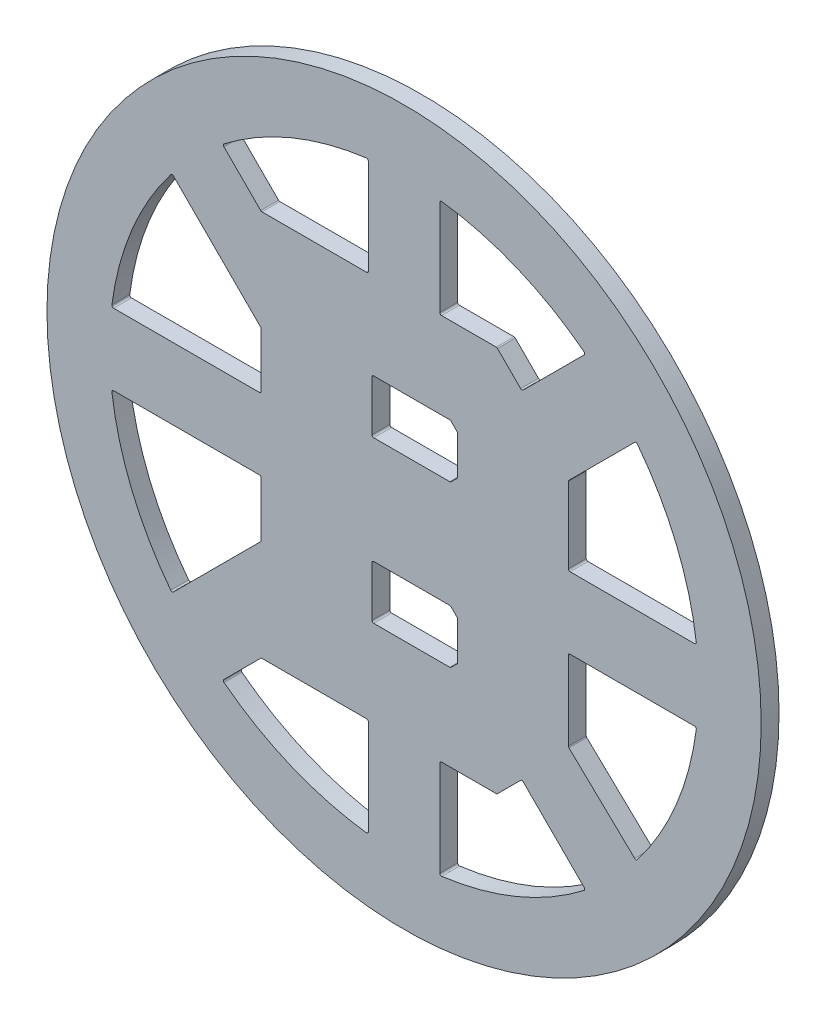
ISO-10303-21;
HEADER;
FILE_DESCRIPTION(('STEP AP214'),'2;1');
FILE_NAME('part.step','',(''),(''),'','','');
FILE_SCHEMA(('AUTOMOTIVE_DESIGN { 1 0 10303 214 1 1 1 1 }'));
ENDSEC;
DATA;
#1=APPLICATION_CONTEXT('core data for automotive mechanical design processes');
#2=APPLICATION_PROTOCOL_DEFINITION('international standard','automotive_design',2000,#1);
#3=PRODUCT_CONTEXT('',#1,'mechanical');
#4=PRODUCT('Part','Part','',(#3));
#5=PRODUCT_RELATED_PRODUCT_CATEGORY('part','',(#4));
#6=PRODUCT_DEFINITION_FORMATION('','',#4);
#7=PRODUCT_DEFINITION_CONTEXT('part definition',#1,'design');
#8=PRODUCT_DEFINITION('design','',#6,#7);
#9=PRODUCT_DEFINITION_SHAPE('','',#8);
#10=(LENGTH_UNIT() NAMED_UNIT(*) SI_UNIT(.MILLI.,.METRE.));
#11=(NAMED_UNIT(*) PLANE_ANGLE_UNIT() SI_UNIT($,.RADIAN.));
#12=(NAMED_UNIT(*) SI_UNIT($,.STERADIAN.) SOLID_ANGLE_UNIT());
#13=UNCERTAINTY_MEASURE_WITH_UNIT(LENGTH_MEASURE(1.E-05),#10,'distance_accuracy_value','');
#14=(GEOMETRIC_REPRESENTATION_CONTEXT(3) GLOBAL_UNCERTAINTY_ASSIGNED_CONTEXT((#13)) GLOBAL_UNIT_ASSIGNED_CONTEXT((#10,
#11,#12)) REPRESENTATION_CONTEXT('',''));
#15=CARTESIAN_POINT('',(0.,0.,0.));
#16=DIRECTION('',(0.,0.,1.));
#17=DIRECTION('',(1.,0.,0.));
#18=AXIS2_PLACEMENT_3D('',#15,#16,#17);
#19=CARTESIAN_POINT('',(-10.,0.,5.));
#20=DIRECTION('',(1.,0.,0.));
#21=DIRECTION('',(0.,1.,0.));
#22=AXIS2_PLACEMENT_3D('',#19,#20,#21);
#23=PLANE('',#22);
#24=DIRECTION('',(0.,-1.,0.));
#25=VECTOR('',#24,1.);
#26=CARTESIAN_POINT('',(-10.,0.,0.));
#27=LINE('',#26,#25);
#28=CARTESIAN_POINT('',(-10.,-54.64,0.));
#29=VERTEX_POINT('',#28);
#30=CARTESIAN_POINT('',(-10.,-81.3249654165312,0.));
#31=VERTEX_POINT('',#30);
#32=EDGE_CURVE('E1205',#29,#31,#27,.T.);
#33=ORIENTED_EDGE('',*,*,#32,.T.);
#34=DIRECTION('',(0.,0.,1.));
#35=VECTOR('',#34,1.);
#36=CARTESIAN_POINT('',(-10.,-81.3249654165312,5.));
#37=LINE('',#36,#35);
#38=CARTESIAN_POINT('',(-10.,-81.3249654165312,5.));
#39=VERTEX_POINT('',#38);
#40=EDGE_CURVE('E912',#31,#39,#37,.T.);
#41=ORIENTED_EDGE('',*,*,#40,.T.);
#42=DIRECTION('',(0.,-1.,0.));
#43=VECTOR('',#42,1.);
#44=CARTESIAN_POINT('',(-10.,0.,5.));
#45=LINE('',#44,#43);
#46=CARTESIAN_POINT('',(-10.,-54.64,5.));
#47=VERTEX_POINT('',#46);
#48=EDGE_CURVE('E1069',#47,#39,#45,.T.);
#49=ORIENTED_EDGE('',*,*,#48,.F.);
#50=DIRECTION('',(0.,0.,-1.));
#51=VECTOR('',#50,1.);
#52=CARTESIAN_POINT('',(-10.,-54.64,0.));
#53=LINE('',#52,#51);
#54=EDGE_CURVE('E720',#47,#29,#53,.T.);
#55=ORIENTED_EDGE('',*,*,#54,.T.);
#56=EDGE_LOOP('',(#33,#41,#49,#55));
#57=FACE_BOUND('',#56,.T.);
#58=ADVANCED_FACE('F38',(#57),#23,.F.);
#59=CARTESIAN_POINT('',(0.,0.,5.));
#60=DIRECTION('',(0.,0.,-1.));
#61=DIRECTION('',(-1.,0.,0.));
#62=AXIS2_PLACEMENT_3D('',#59,#60,#61);
#63=CYLINDRICAL_SURFACE('',#62,82.5);
#64=CARTESIAN_POINT('',(0.,0.,5.));
#65=DIRECTION('',(0.,0.,1.));
#66=DIRECTION('',(1.,0.,0.));
#67=AXIS2_PLACEMENT_3D('',#64,#65,#66);
#68=CIRCLE('',#67,82.5);
#69=CARTESIAN_POINT('',(-10.5640243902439,-81.8208493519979,5.));
#70=VERTEX_POINT('',#69);
#71=CARTESIAN_POINT('',(-50.3861841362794,-65.3259707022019,5.));
#72=VERTEX_POINT('',#71);
#73=EDGE_CURVE('E1074',#70,#72,#68,.F.);
#74=ORIENTED_EDGE('',*,*,#73,.F.);
#75=DIRECTION('',(0.,0.,-1.));
#76=VECTOR('',#75,1.);
#77=CARTESIAN_POINT('',(-10.5640243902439,-81.8208493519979,5.));
#78=LINE('',#77,#76);
#79=CARTESIAN_POINT('',(-10.5640243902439,-81.8208493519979,0.));
#80=VERTEX_POINT('',#79);
#81=EDGE_CURVE('E909',#70,#80,#78,.T.);
#82=ORIENTED_EDGE('',*,*,#81,.T.);
#83=CARTESIAN_POINT('',(0.,0.,0.));
#84=DIRECTION('',(0.,0.,1.));
#85=DIRECTION('',(1.,0.,0.));
#86=AXIS2_PLACEMENT_3D('',#83,#84,#85);
#87=CIRCLE('',#86,82.5);
#88=CARTESIAN_POINT('',(-50.3861841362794,-65.3259707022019,0.));
#89=VERTEX_POINT('',#88);
#90=EDGE_CURVE('E1056',#80,#89,#87,.F.);
#91=ORIENTED_EDGE('',*,*,#90,.T.);
#92=DIRECTION('',(0.,0.,-1.));
#93=VECTOR('',#92,1.);
#94=CARTESIAN_POINT('',(-50.3861841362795,-65.3259707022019,5.));
#95=LINE('',#94,#93);
#96=EDGE_CURVE('E907',#89,#72,#95,.F.);
#97=ORIENTED_EDGE('',*,*,#96,.T.);
#98=EDGE_LOOP('',(#74,#82,#91,#97));
#99=FACE_BOUND('',#98,.T.);
#100=ADVANCED_FACE('F1212',(#99),#63,.F.);
#101=CARTESIAN_POINT('',(7.07106781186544,-7.07106781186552,5.));
#102=DIRECTION('',(0.707106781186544,-0.707106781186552,0.));
#103=DIRECTION('',(0.707106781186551,0.707106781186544,0.));
#104=AXIS2_PLACEMENT_3D('',#101,#102,#103);
#105=PLANE('',#104);
#106=DIRECTION('',(-0.707106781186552,-0.707106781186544,0.));
#107=VECTOR('',#106,1.);
#108=CARTESIAN_POINT('',(7.07106781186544,-7.07106781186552,5.));
#109=LINE('',#108,#107);
#110=CARTESIAN_POINT('',(-40.1443109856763,-54.2864466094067,5.));
#111=VERTEX_POINT('',#110);
#112=CARTESIAN_POINT('',(-50.4343667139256,-64.5765023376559,5.));
#113=VERTEX_POINT('',#112);
#114=EDGE_CURVE('E641',#111,#113,#109,.T.);
#115=ORIENTED_EDGE('',*,*,#114,.T.);
#116=DIRECTION('',(0.,0.,-1.));
#117=VECTOR('',#116,1.);
#118=CARTESIAN_POINT('',(-50.4343667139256,-64.5765023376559,5.));
#119=LINE('',#118,#117);
#120=CARTESIAN_POINT('',(-50.4343667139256,-64.5765023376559,0.));
#121=VERTEX_POINT('',#120);
#122=EDGE_CURVE('E915',#113,#121,#119,.T.);
#123=ORIENTED_EDGE('',*,*,#122,.T.);
#124=DIRECTION('',(-0.707106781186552,-0.707106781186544,0.));
#125=VECTOR('',#124,1.);
#126=CARTESIAN_POINT('',(7.07106781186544,-7.07106781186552,0.));
#127=LINE('',#126,#125);
#128=CARTESIAN_POINT('',(-40.1443109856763,-54.2864466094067,0.));
#129=VERTEX_POINT('',#128);
#130=EDGE_CURVE('E1051',#129,#121,#127,.T.);
#131=ORIENTED_EDGE('',*,*,#130,.F.);
#132=DIRECTION('',(0.,0.,-1.));
#133=VECTOR('',#132,1.);
#134=CARTESIAN_POINT('',(-40.1443109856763,-54.2864466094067,5.));
#135=LINE('',#134,#133);
#136=EDGE_CURVE('E60',#129,#111,#135,.F.);
#137=ORIENTED_EDGE('',*,*,#136,.T.);
#138=EDGE_LOOP('',(#115,#123,#131,#137));
#139=FACE_BOUND('',#138,.T.);
#140=ADVANCED_FACE('F1054',(#139),#105,.T.);
#141=CARTESIAN_POINT('',(-7.07106781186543,7.07106781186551,5.));
#142=DIRECTION('',(0.707106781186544,-0.707106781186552,0.));
#143=DIRECTION('',(0.707106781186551,0.707106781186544,0.));
#144=AXIS2_PLACEMENT_3D('',#141,#142,#143);
#145=PLANE('',#144);
#146=DIRECTION('',(-0.707106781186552,-0.707106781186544,0.));
#147=VECTOR('',#146,1.);
#148=CARTESIAN_POINT('',(-7.07106781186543,7.07106781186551,0.));
#149=LINE('',#148,#147);
#150=CARTESIAN_POINT('',(-40.1464466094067,-26.0043109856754,0.));
#151=VERTEX_POINT('',#150);
#152=CARTESIAN_POINT('',(-64.5765023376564,-50.4343667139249,0.));
#153=VERTEX_POINT('',#152);
#154=EDGE_CURVE('E1193',#151,#153,#149,.T.);
#155=ORIENTED_EDGE('',*,*,#154,.T.);
#156=DIRECTION('',(0.,0.,1.));
#157=VECTOR('',#156,1.);
#158=CARTESIAN_POINT('',(-64.5765023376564,-50.4343667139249,5.));
#159=LINE('',#158,#157);
#160=CARTESIAN_POINT('',(-64.5765023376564,-50.4343667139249,5.));
#161=VERTEX_POINT('',#160);
#162=EDGE_CURVE('E905',#153,#161,#159,.T.);
#163=ORIENTED_EDGE('',*,*,#162,.T.);
#164=DIRECTION('',(-0.707106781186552,-0.707106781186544,0.));
#165=VECTOR('',#164,1.);
#166=CARTESIAN_POINT('',(-7.07106781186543,7.07106781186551,5.));
#167=LINE('',#166,#165);
#168=CARTESIAN_POINT('',(-40.1464466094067,-26.0043109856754,5.));
#169=VERTEX_POINT('',#168);
#170=EDGE_CURVE('E1581',#169,#161,#167,.T.);
#171=ORIENTED_EDGE('',*,*,#170,.F.);
#172=DIRECTION('',(0.,0.,-1.));
#173=VECTOR('',#172,1.);
#174=CARTESIAN_POINT('',(-40.1464466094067,-26.0043109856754,5.));
#175=LINE('',#174,#173);
#176=EDGE_CURVE('E902',#169,#151,#175,.T.);
#177=ORIENTED_EDGE('',*,*,#176,.T.);
#178=EDGE_LOOP('',(#155,#163,#171,#177));
#179=FACE_BOUND('',#178,.T.);
#180=ADVANCED_FACE('F1250',(#179),#145,.F.);
#181=CARTESIAN_POINT('',(0.,0.,5.));
#182=DIRECTION('',(0.,0.,-1.));
#183=DIRECTION('',(-1.,0.,0.));
#184=AXIS2_PLACEMENT_3D('',#181,#182,#183);
#185=CYLINDRICAL_SURFACE('',#184,82.5);
#186=CARTESIAN_POINT('',(0.,0.,0.));
#187=DIRECTION('',(0.,0.,1.));
#188=DIRECTION('',(1.,0.,0.));
#189=AXIS2_PLACEMENT_3D('',#186,#187,#188);
#190=CIRCLE('',#189,82.5);
#191=CARTESIAN_POINT('',(-65.3259707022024,-50.3861841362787,0.));
#192=VERTEX_POINT('',#191);
#193=CARTESIAN_POINT('',(-81.8208493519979,-10.5640243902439,0.));
#194=VERTEX_POINT('',#193);
#195=EDGE_CURVE('E1196',#192,#194,#190,.F.);
#196=ORIENTED_EDGE('',*,*,#195,.T.);
#197=DIRECTION('',(0.,0.,-1.));
#198=VECTOR('',#197,1.);
#199=CARTESIAN_POINT('',(-81.8208493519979,-10.5640243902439,5.));
#200=LINE('',#199,#198);
#201=CARTESIAN_POINT('',(-81.8208493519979,-10.5640243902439,5.));
#202=VERTEX_POINT('',#201);
#203=EDGE_CURVE('E900',#194,#202,#200,.F.);
#204=ORIENTED_EDGE('',*,*,#203,.T.);
#205=CARTESIAN_POINT('',(0.,0.,5.));
#206=DIRECTION('',(0.,0.,1.));
#207=DIRECTION('',(1.,0.,0.));
#208=AXIS2_PLACEMENT_3D('',#205,#206,#207);
#209=CIRCLE('',#208,82.5);
#210=CARTESIAN_POINT('',(-65.3259707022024,-50.3861841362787,5.));
#211=VERTEX_POINT('',#210);
#212=EDGE_CURVE('E1578',#211,#202,#209,.F.);
#213=ORIENTED_EDGE('',*,*,#212,.F.);
#214=DIRECTION('',(0.,0.,-1.));
#215=VECTOR('',#214,1.);
#216=CARTESIAN_POINT('',(-65.3259707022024,-50.3861841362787,5.));
#217=LINE('',#216,#215);
#218=EDGE_CURVE('E897',#211,#192,#217,.T.);
#219=ORIENTED_EDGE('',*,*,#218,.T.);
#220=EDGE_LOOP('',(#196,#204,#213,#219));
#221=FACE_BOUND('',#220,.T.);
#222=ADVANCED_FACE('F1246',(#221),#185,.F.);
#223=CARTESIAN_POINT('',(0.,-10.,5.));
#224=DIRECTION('',(0.,-1.,0.));
#225=DIRECTION('',(1.,0.,0.));
#226=AXIS2_PLACEMENT_3D('',#223,#224,#225);
#227=PLANE('',#226);
#228=DIRECTION('',(-1.,0.,0.));
#229=VECTOR('',#228,1.);
#230=CARTESIAN_POINT('',(0.,-10.,0.));
#231=LINE('',#230,#229);
#232=CARTESIAN_POINT('',(-40.5,-10.,0.));
#233=VERTEX_POINT('',#232);
#234=CARTESIAN_POINT('',(-81.3249654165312,-10.,0.));
#235=VERTEX_POINT('',#234);
#236=EDGE_CURVE('E1199',#233,#235,#231,.T.);
#237=ORIENTED_EDGE('',*,*,#236,.F.);
#238=DIRECTION('',(0.,0.,-1.));
#239=VECTOR('',#238,1.);
#240=CARTESIAN_POINT('',(-40.5,-10.,5.));
#241=LINE('',#240,#239);
#242=CARTESIAN_POINT('',(-40.5,-10.,5.));
#243=VERTEX_POINT('',#242);
#244=EDGE_CURVE('E890',#233,#243,#241,.F.);
#245=ORIENTED_EDGE('',*,*,#244,.T.);
#246=DIRECTION('',(-1.,0.,0.));
#247=VECTOR('',#246,1.);
#248=CARTESIAN_POINT('',(0.,-10.,5.));
#249=LINE('',#248,#247);
#250=CARTESIAN_POINT('',(-81.3249654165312,-10.,5.));
#251=VERTEX_POINT('',#250);
#252=EDGE_CURVE('E1079',#243,#251,#249,.T.);
#253=ORIENTED_EDGE('',*,*,#252,.T.);
#254=DIRECTION('',(0.,0.,-1.));
#255=VECTOR('',#254,1.);
#256=CARTESIAN_POINT('',(-81.3249654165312,-10.,5.));
#257=LINE('',#256,#255);
#258=EDGE_CURVE('E887',#251,#235,#257,.T.);
#259=ORIENTED_EDGE('',*,*,#258,.T.);
#260=EDGE_LOOP('',(#237,#245,#253,#259));
#261=FACE_BOUND('',#260,.T.);
#262=ADVANCED_FACE('F1242',(#261),#227,.T.);
#263=CARTESIAN_POINT('',(-7.07106781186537,-7.07106781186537,5.));
#264=DIRECTION('',(0.707106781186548,0.707106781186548,0.));
#265=DIRECTION('',(-0.707106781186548,0.707106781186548,0.));
#266=AXIS2_PLACEMENT_3D('',#263,#264,#265);
#267=PLANE('',#266);
#268=DIRECTION('',(0.707106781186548,-0.707106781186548,0.));
#269=VECTOR('',#268,1.);
#270=CARTESIAN_POINT('',(-7.07106781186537,-7.07106781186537,0.));
#271=LINE('',#270,#269);
#272=CARTESIAN_POINT('',(33.3524855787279,-47.4946212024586,0.));
#273=VERTEX_POINT('',#272);
#274=CARTESIAN_POINT('',(50.4343667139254,-64.5765023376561,0.));
#275=VERTEX_POINT('',#274);
#276=EDGE_CURVE('E1178',#273,#275,#271,.T.);
#277=ORIENTED_EDGE('',*,*,#276,.T.);
#278=DIRECTION('',(0.,0.,1.));
#279=VECTOR('',#278,1.);
#280=CARTESIAN_POINT('',(50.4343667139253,-64.5765023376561,5.));
#281=LINE('',#280,#279);
#282=CARTESIAN_POINT('',(50.4343667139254,-64.5765023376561,5.));
#283=VERTEX_POINT('',#282);
#284=EDGE_CURVE('E870',#275,#283,#281,.T.);
#285=ORIENTED_EDGE('',*,*,#284,.T.);
#286=DIRECTION('',(0.707106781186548,-0.707106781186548,0.));
#287=VECTOR('',#286,1.);
#288=CARTESIAN_POINT('',(-7.07106781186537,-7.07106781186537,5.));
#289=LINE('',#288,#287);
#290=CARTESIAN_POINT('',(33.3524855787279,-47.4946212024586,5.));
#291=VERTEX_POINT('',#290);
#292=EDGE_CURVE('E1600',#291,#283,#289,.T.);
#293=ORIENTED_EDGE('',*,*,#292,.F.);
#294=DIRECTION('',(0.,0.,-1.));
#295=VECTOR('',#294,1.);
#296=CARTESIAN_POINT('',(33.3524855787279,-47.4946212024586,0.));
#297=LINE('',#296,#295);
#298=EDGE_CURVE('E867',#291,#273,#297,.T.);
#299=ORIENTED_EDGE('',*,*,#298,.T.);
#300=EDGE_LOOP('',(#277,#285,#293,#299));
#301=FACE_BOUND('',#300,.T.);
#302=ADVANCED_FACE('F1245',(#301),#267,.F.);
#303=CARTESIAN_POINT('',(0.,0.,5.));
#304=DIRECTION('',(0.,0.,-1.));
#305=DIRECTION('',(-1.,0.,0.));
#306=AXIS2_PLACEMENT_3D('',#303,#304,#305);
#307=CYLINDRICAL_SURFACE('',#306,82.5);
#308=CARTESIAN_POINT('',(0.,0.,5.));
#309=DIRECTION('',(0.,0.,1.));
#310=DIRECTION('',(1.,0.,0.));
#311=AXIS2_PLACEMENT_3D('',#308,#309,#310);
#312=CIRCLE('',#311,82.5);
#313=CARTESIAN_POINT('',(50.3861841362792,-65.3259707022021,5.));
#314=VERTEX_POINT('',#313);
#315=CARTESIAN_POINT('',(10.5640243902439,-81.8208493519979,5.));
#316=VERTEX_POINT('',#315);
#317=EDGE_CURVE('E1597',#314,#316,#312,.F.);
#318=ORIENTED_EDGE('',*,*,#317,.F.);
#319=DIRECTION('',(0.,0.,-1.));
#320=VECTOR('',#319,1.);
#321=CARTESIAN_POINT('',(50.3861841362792,-65.3259707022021,5.));
#322=LINE('',#321,#320);
#323=CARTESIAN_POINT('',(50.3861841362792,-65.3259707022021,0.));
#324=VERTEX_POINT('',#323);
#325=EDGE_CURVE('E864',#314,#324,#322,.T.);
#326=ORIENTED_EDGE('',*,*,#325,.T.);
#327=CARTESIAN_POINT('',(0.,0.,0.));
#328=DIRECTION('',(0.,0.,1.));
#329=DIRECTION('',(1.,0.,0.));
#330=AXIS2_PLACEMENT_3D('',#327,#328,#329);
#331=CIRCLE('',#330,82.5);
#332=CARTESIAN_POINT('',(10.5640243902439,-81.8208493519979,0.));
#333=VERTEX_POINT('',#332);
#334=EDGE_CURVE('E1181',#324,#333,#331,.F.);
#335=ORIENTED_EDGE('',*,*,#334,.T.);
#336=DIRECTION('',(0.,0.,-1.));
#337=VECTOR('',#336,1.);
#338=CARTESIAN_POINT('',(10.5640243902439,-81.8208493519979,5.));
#339=LINE('',#338,#337);
#340=EDGE_CURVE('E862',#333,#316,#339,.F.);
#341=ORIENTED_EDGE('',*,*,#340,.T.);
#342=EDGE_LOOP('',(#318,#326,#335,#341));
#343=FACE_BOUND('',#342,.T.);
#344=ADVANCED_FACE('F1267',(#343),#307,.F.);
#345=CARTESIAN_POINT('',(10.,0.,5.));
#346=DIRECTION('',(1.,0.,0.));
#347=DIRECTION('',(0.,1.,0.));
#348=AXIS2_PLACEMENT_3D('',#345,#346,#347);
#349=PLANE('',#348);
#350=DIRECTION('',(0.,-1.,0.));
#351=VECTOR('',#350,1.);
#352=CARTESIAN_POINT('',(10.,0.,0.));
#353=LINE('',#352,#351);
#354=CARTESIAN_POINT('',(10.,-54.64,0.));
#355=VERTEX_POINT('',#354);
#356=CARTESIAN_POINT('',(10.,-81.3249654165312,0.));
#357=VERTEX_POINT('',#356);
#358=EDGE_CURVE('E1184',#355,#357,#353,.T.);
#359=ORIENTED_EDGE('',*,*,#358,.F.);
#360=DIRECTION('',(0.,0.,-1.));
#361=VECTOR('',#360,1.);
#362=CARTESIAN_POINT('',(10.,-54.64,5.));
#363=LINE('',#362,#361);
#364=CARTESIAN_POINT('',(10.,-54.64,5.));
#365=VERTEX_POINT('',#364);
#366=EDGE_CURVE('E880',#355,#365,#363,.F.);
#367=ORIENTED_EDGE('',*,*,#366,.T.);
#368=DIRECTION('',(0.,-1.,0.));
#369=VECTOR('',#368,1.);
#370=CARTESIAN_POINT('',(10.,0.,5.));
#371=LINE('',#370,#369);
#372=CARTESIAN_POINT('',(10.,-81.3249654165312,5.));
#373=VERTEX_POINT('',#372);
#374=EDGE_CURVE('E1594',#365,#373,#371,.T.);
#375=ORIENTED_EDGE('',*,*,#374,.T.);
#376=DIRECTION('',(0.,0.,-1.));
#377=VECTOR('',#376,1.);
#378=CARTESIAN_POINT('',(10.,-81.3249654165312,5.));
#379=LINE('',#378,#377);
#380=EDGE_CURVE('E877',#373,#357,#379,.T.);
#381=ORIENTED_EDGE('',*,*,#380,.T.);
#382=EDGE_LOOP('',(#359,#367,#375,#381));
#383=FACE_BOUND('',#382,.T.);
#384=ADVANCED_FACE('F1263',(#383),#349,.T.);
#385=CARTESIAN_POINT('',(0.,-54.14,5.));
#386=DIRECTION('',(0.,1.,0.));
#387=DIRECTION('',(0.,0.,1.));
#388=AXIS2_PLACEMENT_3D('',#385,#386,#387);
#389=PLANE('',#388);
#390=DIRECTION('',(1.,0.,0.));
#391=VECTOR('',#390,1.);
#392=CARTESIAN_POINT('',(0.,-54.14,5.));
#393=LINE('',#392,#391);
#394=CARTESIAN_POINT('',(10.5,-54.14,5.));
#395=VERTEX_POINT('',#394);
#396=CARTESIAN_POINT('',(25.7928932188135,-54.14,5.));
#397=VERTEX_POINT('',#396);
#398=EDGE_CURVE('E1591',#395,#397,#393,.T.);
#399=ORIENTED_EDGE('',*,*,#398,.F.);
#400=DIRECTION('',(0.,0.,-1.));
#401=VECTOR('',#400,1.);
#402=CARTESIAN_POINT('',(10.5,-54.14,5.));
#403=LINE('',#402,#401);
#404=CARTESIAN_POINT('',(10.5,-54.14,0.));
#405=VERTEX_POINT('',#404);
#406=EDGE_CURVE('E874',#395,#405,#403,.T.);
#407=ORIENTED_EDGE('',*,*,#406,.T.);
#408=DIRECTION('',(1.,0.,0.));
#409=VECTOR('',#408,1.);
#410=CARTESIAN_POINT('',(0.,-54.14,0.));
#411=LINE('',#410,#409);
#412=CARTESIAN_POINT('',(25.7928932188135,-54.14,0.));
#413=VERTEX_POINT('',#412);
#414=EDGE_CURVE('E1187',#405,#413,#411,.T.);
#415=ORIENTED_EDGE('',*,*,#414,.T.);
#416=DIRECTION('',(0.,0.,-1.));
#417=VECTOR('',#416,1.);
#418=CARTESIAN_POINT('',(25.7928932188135,-54.14,5.));
#419=LINE('',#418,#417);
#420=EDGE_CURVE('E872',#413,#397,#419,.F.);
#421=ORIENTED_EDGE('',*,*,#420,.T.);
#422=EDGE_LOOP('',(#399,#407,#415,#421));
#423=FACE_BOUND('',#422,.T.);
#424=ADVANCED_FACE('F1259',(#423),#389,.F.);
#425=CARTESIAN_POINT('',(0.,-10.,5.));
#426=DIRECTION('',(0.,1.,0.));
#427=DIRECTION('',(-1.,0.,0.));
#428=AXIS2_PLACEMENT_3D('',#425,#426,#427);
#429=PLANE('',#428);
#430=DIRECTION('',(1.,0.,0.));
#431=VECTOR('',#430,1.);
#432=CARTESIAN_POINT('',(0.,-10.,5.));
#433=LINE('',#432,#431);
#434=CARTESIAN_POINT('',(46.5,-10.,5.));
#435=VERTEX_POINT('',#434);
#436=CARTESIAN_POINT('',(81.3249654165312,-10.,5.));
#437=VERTEX_POINT('',#436);
#438=EDGE_CURVE('E1612',#435,#437,#433,.T.);
#439=ORIENTED_EDGE('',*,*,#438,.F.);
#440=DIRECTION('',(0.,0.,-1.));
#441=VECTOR('',#440,1.);
#442=CARTESIAN_POINT('',(46.5,-10.,0.));
#443=LINE('',#442,#441);
#444=CARTESIAN_POINT('',(46.5,-10.,0.));
#445=VERTEX_POINT('',#444);
#446=EDGE_CURVE('E844',#435,#445,#443,.T.);
#447=ORIENTED_EDGE('',*,*,#446,.T.);
#448=DIRECTION('',(1.,0.,0.));
#449=VECTOR('',#448,1.);
#450=CARTESIAN_POINT('',(0.,-10.,0.));
#451=LINE('',#450,#449);
#452=CARTESIAN_POINT('',(81.3249654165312,-10.,0.));
#453=VERTEX_POINT('',#452);
#454=EDGE_CURVE('E1166',#445,#453,#451,.T.);
#455=ORIENTED_EDGE('',*,*,#454,.T.);
#456=DIRECTION('',(0.,0.,1.));
#457=VECTOR('',#456,1.);
#458=CARTESIAN_POINT('',(81.3249654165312,-10.,5.));
#459=LINE('',#458,#457);
#460=EDGE_CURVE('E842',#453,#437,#459,.T.);
#461=ORIENTED_EDGE('',*,*,#460,.T.);
#462=EDGE_LOOP('',(#439,#447,#455,#461));
#463=FACE_BOUND('',#462,.T.);
#464=ADVANCED_FACE('F1262',(#463),#429,.F.);
#465=CARTESIAN_POINT('',(0.,0.,5.));
#466=DIRECTION('',(0.,0.,-1.));
#467=DIRECTION('',(-1.,0.,0.));
#468=AXIS2_PLACEMENT_3D('',#465,#466,#467);
#469=CYLINDRICAL_SURFACE('',#468,82.5);
#470=CARTESIAN_POINT('',(0.,0.,0.));
#471=DIRECTION('',(0.,0.,1.));
#472=DIRECTION('',(1.,0.,0.));
#473=AXIS2_PLACEMENT_3D('',#470,#471,#472);
#474=CIRCLE('',#473,82.5);
#475=CARTESIAN_POINT('',(81.8208493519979,-10.5640243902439,0.));
#476=VERTEX_POINT('',#475);
#477=CARTESIAN_POINT('',(65.317936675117,-50.3965985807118,0.));
#478=VERTEX_POINT('',#477);
#479=EDGE_CURVE('E1169',#476,#478,#474,.F.);
#480=ORIENTED_EDGE('',*,*,#479,.T.);
#481=DIRECTION('',(0.,0.,-1.));
#482=VECTOR('',#481,1.);
#483=CARTESIAN_POINT('',(65.317936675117,-50.3965985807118,5.));
#484=LINE('',#483,#482);
#485=CARTESIAN_POINT('',(65.317936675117,-50.3965985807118,5.));
#486=VERTEX_POINT('',#485);
#487=EDGE_CURVE('E860',#478,#486,#484,.F.);
#488=ORIENTED_EDGE('',*,*,#487,.T.);
#489=CARTESIAN_POINT('',(0.,0.,5.));
#490=DIRECTION('',(0.,0.,1.));
#491=DIRECTION('',(1.,0.,0.));
#492=AXIS2_PLACEMENT_3D('',#489,#490,#491);
#493=CIRCLE('',#492,82.5);
#494=CARTESIAN_POINT('',(81.8208493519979,-10.5640243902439,5.));
#495=VERTEX_POINT('',#494);
#496=EDGE_CURVE('E1609',#495,#486,#493,.F.);
#497=ORIENTED_EDGE('',*,*,#496,.F.);
#498=DIRECTION('',(0.,0.,-1.));
#499=VECTOR('',#498,1.);
#500=CARTESIAN_POINT('',(81.8208493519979,-10.5640243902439,5.));
#501=LINE('',#500,#499);
#502=EDGE_CURVE('E857',#495,#476,#501,.T.);
#503=ORIENTED_EDGE('',*,*,#502,.T.);
#504=EDGE_LOOP('',(#480,#488,#497,#503));
#505=FACE_BOUND('',#504,.T.);
#506=ADVANCED_FACE('F1283',(#505),#469,.F.);
#507=CARTESIAN_POINT('',(5.59275128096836,5.85823132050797,5.));
#508=DIRECTION('',(0.690527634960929,0.723306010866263,0.));
#509=DIRECTION('',(-0.723306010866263,0.690527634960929,0.));
#510=AXIS2_PLACEMENT_3D('',#507,#508,#509);
#511=PLANE('',#510);
#512=DIRECTION('',(0.723306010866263,-0.690527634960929,0.));
#513=VECTOR('',#512,1.);
#514=CARTESIAN_POINT('',(5.59275128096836,5.85823132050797,5.));
#515=LINE('',#514,#513);
#516=CARTESIAN_POINT('',(46.1547361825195,-32.8655883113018,5.));
#517=VERTEX_POINT('',#516);
#518=CARTESIAN_POINT('',(64.5768065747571,-50.4528176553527,5.));
#519=VERTEX_POINT('',#518);
#520=EDGE_CURVE('E1606',#517,#519,#515,.T.);
#521=ORIENTED_EDGE('',*,*,#520,.T.);
#522=DIRECTION('',(0.,0.,-1.));
#523=VECTOR('',#522,1.);
#524=CARTESIAN_POINT('',(64.5768065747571,-50.4528176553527,5.));
#525=LINE('',#524,#523);
#526=CARTESIAN_POINT('',(64.5768065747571,-50.4528176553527,0.));
#527=VERTEX_POINT('',#526);
#528=EDGE_CURVE('E854',#519,#527,#525,.T.);
#529=ORIENTED_EDGE('',*,*,#528,.T.);
#530=DIRECTION('',(0.723306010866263,-0.690527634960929,0.));
#531=VECTOR('',#530,1.);
#532=CARTESIAN_POINT('',(5.59275128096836,5.85823132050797,0.));
#533=LINE('',#532,#531);
#534=CARTESIAN_POINT('',(46.1547361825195,-32.8655883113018,0.));
#535=VERTEX_POINT('',#534);
#536=EDGE_CURVE('E1172',#535,#527,#533,.T.);
#537=ORIENTED_EDGE('',*,*,#536,.F.);
#538=DIRECTION('',(0.,0.,-1.));
#539=VECTOR('',#538,1.);
#540=CARTESIAN_POINT('',(46.1547361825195,-32.8655883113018,5.));
#541=LINE('',#540,#539);
#542=EDGE_CURVE('E852',#535,#517,#541,.F.);
#543=ORIENTED_EDGE('',*,*,#542,.T.);
#544=EDGE_LOOP('',(#521,#529,#537,#543));
#545=FACE_BOUND('',#544,.T.);
#546=ADVANCED_FACE('F1279',(#545),#511,.T.);
#547=CARTESIAN_POINT('',(-9.,0.,5.));
#548=DIRECTION('',(1.,0.,0.));
#549=DIRECTION('',(0.,1.,0.));
#550=AXIS2_PLACEMENT_3D('',#547,#548,#549);
#551=PLANE('',#550);
#552=DIRECTION('',(0.,-1.,0.));
#553=VECTOR('',#552,1.);
#554=CARTESIAN_POINT('',(-9.,0.,0.));
#555=LINE('',#554,#553);
#556=CARTESIAN_POINT('',(-9.,-15.5,0.));
#557=VERTEX_POINT('',#556);
#558=CARTESIAN_POINT('',(-9.,-29.5,0.));
#559=VERTEX_POINT('',#558);
#560=EDGE_CURVE('E1145',#557,#559,#555,.T.);
#561=ORIENTED_EDGE('',*,*,#560,.F.);
#562=DIRECTION('',(0.,0.,-1.));
#563=VECTOR('',#562,1.);
#564=CARTESIAN_POINT('',(-9.,-15.5,5.));
#565=LINE('',#564,#563);
#566=CARTESIAN_POINT('',(-9.,-15.5,5.));
#567=VERTEX_POINT('',#566);
#568=EDGE_CURVE('E790',#557,#567,#565,.F.);
#569=ORIENTED_EDGE('',*,*,#568,.T.);
#570=DIRECTION('',(0.,-1.,0.));
#571=VECTOR('',#570,1.);
#572=CARTESIAN_POINT('',(-9.,0.,5.));
#573=LINE('',#572,#571);
#574=CARTESIAN_POINT('',(-9.,-29.5,5.));
#575=VERTEX_POINT('',#574);
#576=EDGE_CURVE('E1633',#567,#575,#573,.T.);
#577=ORIENTED_EDGE('',*,*,#576,.T.);
#578=DIRECTION('',(0.,0.,-1.));
#579=VECTOR('',#578,1.);
#580=CARTESIAN_POINT('',(-9.,-29.5,0.));
#581=LINE('',#580,#579);
#582=EDGE_CURVE('E787',#575,#559,#581,.T.);
#583=ORIENTED_EDGE('',*,*,#582,.T.);
#584=EDGE_LOOP('',(#561,#569,#577,#583));
#585=FACE_BOUND('',#584,.T.);
#586=ADVANCED_FACE('F1282',(#585),#551,.T.);
#587=CARTESIAN_POINT('',(0.,-15.,5.));
#588=DIRECTION('',(0.,1.,0.));
#589=DIRECTION('',(0.,0.,1.));
#590=AXIS2_PLACEMENT_3D('',#587,#588,#589);
#591=PLANE('',#590);
#592=DIRECTION('',(1.,0.,0.));
#593=VECTOR('',#592,1.);
#594=CARTESIAN_POINT('',(0.,-15.,5.));
#595=LINE('',#594,#593);
#596=CARTESIAN_POINT('',(-8.5,-15.,5.));
#597=VERTEX_POINT('',#596);
#598=CARTESIAN_POINT('',(12.7928932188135,-15.,5.));
#599=VERTEX_POINT('',#598);
#600=EDGE_CURVE('E1630',#597,#599,#595,.T.);
#601=ORIENTED_EDGE('',*,*,#600,.F.);
#602=DIRECTION('',(0.,0.,-1.));
#603=VECTOR('',#602,1.);
#604=CARTESIAN_POINT('',(-8.5,-15.,5.));
#605=LINE('',#604,#603);
#606=CARTESIAN_POINT('',(-8.5,-15.,0.));
#607=VERTEX_POINT('',#606);
#608=EDGE_CURVE('E784',#597,#607,#605,.T.);
#609=ORIENTED_EDGE('',*,*,#608,.T.);
#610=DIRECTION('',(1.,0.,0.));
#611=VECTOR('',#610,1.);
#612=CARTESIAN_POINT('',(0.,-15.,0.));
#613=LINE('',#612,#611);
#614=CARTESIAN_POINT('',(12.7928932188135,-15.,0.));
#615=VERTEX_POINT('',#614);
#616=EDGE_CURVE('E1148',#607,#615,#613,.T.);
#617=ORIENTED_EDGE('',*,*,#616,.T.);
#618=DIRECTION('',(0.,0.,-1.));
#619=VECTOR('',#618,1.);
#620=CARTESIAN_POINT('',(12.7928932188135,-15.,5.));
#621=LINE('',#620,#619);
#622=EDGE_CURVE('E782',#615,#599,#621,.F.);
#623=ORIENTED_EDGE('',*,*,#622,.T.);
#624=EDGE_LOOP('',(#601,#609,#617,#623));
#625=FACE_BOUND('',#624,.T.);
#626=ADVANCED_FACE('F1311',(#625),#591,.F.);
#627=CARTESIAN_POINT('',(-0.999999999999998,-0.999999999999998,5.));
#628=DIRECTION('',(0.707106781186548,0.707106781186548,0.));
#629=DIRECTION('',(-0.707106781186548,0.707106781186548,0.));
#630=AXIS2_PLACEMENT_3D('',#627,#628,#629);
#631=PLANE('',#630);
#632=DIRECTION('',(0.707106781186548,-0.707106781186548,0.));
#633=VECTOR('',#632,1.);
#634=CARTESIAN_POINT('',(-0.999999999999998,-0.999999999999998,5.));
#635=LINE('',#634,#633);
#636=CARTESIAN_POINT('',(13.1464466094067,-15.1464466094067,5.));
#637=VERTEX_POINT('',#636);
#638=CARTESIAN_POINT('',(14.8535533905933,-16.8535533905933,5.));
#639=VERTEX_POINT('',#638);
#640=EDGE_CURVE('E1627',#637,#639,#635,.T.);
#641=ORIENTED_EDGE('',*,*,#640,.F.);
#642=DIRECTION('',(0.,0.,-1.));
#643=VECTOR('',#642,1.);
#644=CARTESIAN_POINT('',(13.1464466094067,-15.1464466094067,0.));
#645=LINE('',#644,#643);
#646=CARTESIAN_POINT('',(13.1464466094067,-15.1464466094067,0.));
#647=VERTEX_POINT('',#646);
#648=EDGE_CURVE('E794',#637,#647,#645,.T.);
#649=ORIENTED_EDGE('',*,*,#648,.T.);
#650=DIRECTION('',(0.707106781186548,-0.707106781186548,0.));
#651=VECTOR('',#650,1.);
#652=CARTESIAN_POINT('',(-0.999999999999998,-0.999999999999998,0.));
#653=LINE('',#652,#651);
#654=CARTESIAN_POINT('',(14.8535533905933,-16.8535533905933,0.));
#655=VERTEX_POINT('',#654);
#656=EDGE_CURVE('E1151',#647,#655,#653,.T.);
#657=ORIENTED_EDGE('',*,*,#656,.T.);
#658=DIRECTION('',(0.,0.,-1.));
#659=VECTOR('',#658,1.);
#660=CARTESIAN_POINT('',(14.8535533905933,-16.8535533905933,5.));
#661=LINE('',#660,#659);
#662=EDGE_CURVE('E792',#655,#639,#661,.F.);
#663=ORIENTED_EDGE('',*,*,#662,.T.);
#664=EDGE_LOOP('',(#641,#649,#657,#663));
#665=FACE_BOUND('',#664,.T.);
#666=ADVANCED_FACE('F1307',(#665),#631,.F.);
#667=CARTESIAN_POINT('',(15.,0.,5.));
#668=DIRECTION('',(1.,0.,0.));
#669=DIRECTION('',(0.,0.,-1.));
#670=AXIS2_PLACEMENT_3D('',#667,#668,#669);
#671=PLANE('',#670);
#672=DIRECTION('',(0.,-1.,0.));
#673=VECTOR('',#672,1.);
#674=CARTESIAN_POINT('',(15.,0.,5.));
#675=LINE('',#674,#673);
#676=CARTESIAN_POINT('',(15.,-17.2071067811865,5.));
#677=VERTEX_POINT('',#676);
#678=CARTESIAN_POINT('',(15.,-27.7928932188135,5.));
#679=VERTEX_POINT('',#678);
#680=EDGE_CURVE('E1624',#677,#679,#675,.T.);
#681=ORIENTED_EDGE('',*,*,#680,.F.);
#682=DIRECTION('',(0.,0.,-1.));
#683=VECTOR('',#682,1.);
#684=CARTESIAN_POINT('',(15.,-17.2071067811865,0.));
#685=LINE('',#684,#683);
#686=CARTESIAN_POINT('',(15.,-17.2071067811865,0.));
#687=VERTEX_POINT('',#686);
#688=EDGE_CURVE('E834',#677,#687,#685,.T.);
#689=ORIENTED_EDGE('',*,*,#688,.T.);
#690=DIRECTION('',(0.,-1.,0.));
#691=VECTOR('',#690,1.);
#692=CARTESIAN_POINT('',(15.,0.,0.));
#693=LINE('',#692,#691);
#694=CARTESIAN_POINT('',(15.,-27.7928932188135,0.));
#695=VERTEX_POINT('',#694);
#696=EDGE_CURVE('E1154',#687,#695,#693,.T.);
#697=ORIENTED_EDGE('',*,*,#696,.T.);
#698=DIRECTION('',(0.,0.,-1.));
#699=VECTOR('',#698,1.);
#700=CARTESIAN_POINT('',(15.,-27.7928932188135,5.));
#701=LINE('',#700,#699);
#702=EDGE_CURVE('E832',#695,#679,#701,.F.);
#703=ORIENTED_EDGE('',*,*,#702,.T.);
#704=EDGE_LOOP('',(#681,#689,#697,#703));
#705=FACE_BOUND('',#704,.T.);
#706=ADVANCED_FACE('F1303',(#705),#671,.F.);
#707=CARTESIAN_POINT('',(21.5,-21.5,5.));
#708=DIRECTION('',(-0.707106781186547,0.707106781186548,0.));
#709=DIRECTION('',(-0.707106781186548,-0.707106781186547,0.));
#710=AXIS2_PLACEMENT_3D('',#707,#708,#709);
#711=PLANE('',#710);
#712=DIRECTION('',(0.707106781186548,0.707106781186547,0.));
#713=VECTOR('',#712,1.);
#714=CARTESIAN_POINT('',(21.5,-21.5,5.));
#715=LINE('',#714,#713);
#716=CARTESIAN_POINT('',(13.1464466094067,-29.8535533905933,5.));
#717=VERTEX_POINT('',#716);
#718=CARTESIAN_POINT('',(14.8535533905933,-28.1464466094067,5.));
#719=VERTEX_POINT('',#718);
#720=EDGE_CURVE('E1621',#717,#719,#715,.T.);
#721=ORIENTED_EDGE('',*,*,#720,.T.);
#722=DIRECTION('',(0.,0.,-1.));
#723=VECTOR('',#722,1.);
#724=CARTESIAN_POINT('',(14.8535533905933,-28.1464466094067,5.));
#725=LINE('',#724,#723);
#726=CARTESIAN_POINT('',(14.8535533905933,-28.1464466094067,0.));
#727=VERTEX_POINT('',#726);
#728=EDGE_CURVE('E839',#719,#727,#725,.T.);
#729=ORIENTED_EDGE('',*,*,#728,.T.);
#730=DIRECTION('',(0.707106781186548,0.707106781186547,0.));
#731=VECTOR('',#730,1.);
#732=CARTESIAN_POINT('',(21.5,-21.5,0.));
#733=LINE('',#732,#731);
#734=CARTESIAN_POINT('',(13.1464466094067,-29.8535533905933,0.));
#735=VERTEX_POINT('',#734);
#736=EDGE_CURVE('E1157',#735,#727,#733,.T.);
#737=ORIENTED_EDGE('',*,*,#736,.F.);
#738=DIRECTION('',(0.,0.,-1.));
#739=VECTOR('',#738,1.);
#740=CARTESIAN_POINT('',(13.1464466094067,-29.8535533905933,5.));
#741=LINE('',#740,#739);
#742=EDGE_CURVE('E837',#735,#717,#741,.F.);
#743=ORIENTED_EDGE('',*,*,#742,.T.);
#744=EDGE_LOOP('',(#721,#729,#737,#743));
#745=FACE_BOUND('',#744,.T.);
#746=ADVANCED_FACE('F1299',(#745),#711,.T.);
#747=CARTESIAN_POINT('',(-0.999999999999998,0.999999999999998,5.));
#748=DIRECTION('',(-0.707106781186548,0.707106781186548,0.));
#749=DIRECTION('',(-0.707106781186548,-0.707106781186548,0.));
#750=AXIS2_PLACEMENT_3D('',#747,#748,#749);
#751=PLANE('',#750);
#752=DIRECTION('',(0.707106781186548,0.707106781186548,0.));
#753=VECTOR('',#752,1.);
#754=CARTESIAN_POINT('',(-0.999999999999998,0.999999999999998,5.));
#755=LINE('',#754,#753);
#756=CARTESIAN_POINT('',(13.1464466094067,15.1464466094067,5.));
#757=VERTEX_POINT('',#756);
#758=CARTESIAN_POINT('',(14.8535533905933,16.8535533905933,5.));
#759=VERTEX_POINT('',#758);
#760=EDGE_CURVE('E1651',#757,#759,#755,.T.);
#761=ORIENTED_EDGE('',*,*,#760,.T.);
#762=DIRECTION('',(0.,0.,-1.));
#763=VECTOR('',#762,1.);
#764=CARTESIAN_POINT('',(14.8535533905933,16.8535533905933,0.));
#765=LINE('',#764,#763);
#766=CARTESIAN_POINT('',(14.8535533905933,16.8535533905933,0.));
#767=VERTEX_POINT('',#766);
#768=EDGE_CURVE('E814',#759,#767,#765,.T.);
#769=ORIENTED_EDGE('',*,*,#768,.T.);
#770=DIRECTION('',(0.707106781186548,0.707106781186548,0.));
#771=VECTOR('',#770,1.);
#772=CARTESIAN_POINT('',(-0.999999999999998,0.999999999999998,0.));
#773=LINE('',#772,#771);
#774=CARTESIAN_POINT('',(13.1464466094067,15.1464466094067,0.));
#775=VERTEX_POINT('',#774);
#776=EDGE_CURVE('E1127',#775,#767,#773,.T.);
#777=ORIENTED_EDGE('',*,*,#776,.F.);
#778=DIRECTION('',(0.,0.,-1.));
#779=VECTOR('',#778,1.);
#780=CARTESIAN_POINT('',(13.1464466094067,15.1464466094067,5.));
#781=LINE('',#780,#779);
#782=EDGE_CURVE('E812',#775,#757,#781,.F.);
#783=ORIENTED_EDGE('',*,*,#782,.T.);
#784=EDGE_LOOP('',(#761,#769,#777,#783));
#785=FACE_BOUND('',#784,.T.);
#786=ADVANCED_FACE('F1302',(#785),#751,.T.);
#787=CARTESIAN_POINT('',(0.,15.,5.));
#788=DIRECTION('',(0.,1.,0.));
#789=DIRECTION('',(0.,0.,1.));
#790=AXIS2_PLACEMENT_3D('',#787,#788,#789);
#791=PLANE('',#790);
#792=DIRECTION('',(1.,0.,0.));
#793=VECTOR('',#792,1.);
#794=CARTESIAN_POINT('',(0.,15.,0.));
#795=LINE('',#794,#793);
#796=CARTESIAN_POINT('',(-8.5,15.,0.));
#797=VERTEX_POINT('',#796);
#798=CARTESIAN_POINT('',(12.7928932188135,15.,0.));
#799=VERTEX_POINT('',#798);
#800=EDGE_CURVE('E1130',#797,#799,#795,.T.);
#801=ORIENTED_EDGE('',*,*,#800,.F.);
#802=DIRECTION('',(0.,0.,-1.));
#803=VECTOR('',#802,1.);
#804=CARTESIAN_POINT('',(-8.5,15.,5.));
#805=LINE('',#804,#803);
#806=CARTESIAN_POINT('',(-8.5,15.,5.));
#807=VERTEX_POINT('',#806);
#808=EDGE_CURVE('E825',#797,#807,#805,.F.);
#809=ORIENTED_EDGE('',*,*,#808,.T.);
#810=DIRECTION('',(1.,0.,0.));
#811=VECTOR('',#810,1.);
#812=CARTESIAN_POINT('',(0.,15.,5.));
#813=LINE('',#812,#811);
#814=CARTESIAN_POINT('',(12.7928932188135,15.,5.));
#815=VERTEX_POINT('',#814);
#816=EDGE_CURVE('E1648',#807,#815,#813,.T.);
#817=ORIENTED_EDGE('',*,*,#816,.T.);
#818=DIRECTION('',(0.,0.,-1.));
#819=VECTOR('',#818,1.);
#820=CARTESIAN_POINT('',(12.7928932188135,15.,0.));
#821=LINE('',#820,#819);
#822=EDGE_CURVE('E822',#815,#799,#821,.T.);
#823=ORIENTED_EDGE('',*,*,#822,.T.);
#824=EDGE_LOOP('',(#801,#809,#817,#823));
#825=FACE_BOUND('',#824,.T.);
#826=ADVANCED_FACE('F1335',(#825),#791,.T.);
#827=CARTESIAN_POINT('',(-9.,0.,5.));
#828=DIRECTION('',(-1.,0.,0.));
#829=DIRECTION('',(0.,-1.,0.));
#830=AXIS2_PLACEMENT_3D('',#827,#828,#829);
#831=PLANE('',#830);
#832=DIRECTION('',(0.,1.,0.));
#833=VECTOR('',#832,1.);
#834=CARTESIAN_POINT('',(-9.,0.,0.));
#835=LINE('',#834,#833);
#836=CARTESIAN_POINT('',(-9.,15.5,0.));
#837=VERTEX_POINT('',#836);
#838=CARTESIAN_POINT('',(-9.,29.5,0.));
#839=VERTEX_POINT('',#838);
#840=EDGE_CURVE('E1133',#837,#839,#835,.T.);
#841=ORIENTED_EDGE('',*,*,#840,.T.);
#842=DIRECTION('',(0.,0.,-1.));
#843=VECTOR('',#842,1.);
#844=CARTESIAN_POINT('',(-9.,29.5,5.));
#845=LINE('',#844,#843);
#846=CARTESIAN_POINT('',(-9.,29.5,5.));
#847=VERTEX_POINT('',#846);
#848=EDGE_CURVE('E820',#839,#847,#845,.F.);
#849=ORIENTED_EDGE('',*,*,#848,.T.);
#850=DIRECTION('',(0.,1.,0.));
#851=VECTOR('',#850,1.);
#852=CARTESIAN_POINT('',(-9.,0.,5.));
#853=LINE('',#852,#851);
#854=CARTESIAN_POINT('',(-9.,15.5,5.));
#855=VERTEX_POINT('',#854);
#856=EDGE_CURVE('E1645',#855,#847,#853,.T.);
#857=ORIENTED_EDGE('',*,*,#856,.F.);
#858=DIRECTION('',(0.,0.,-1.));
#859=VECTOR('',#858,1.);
#860=CARTESIAN_POINT('',(-9.,15.5,5.));
#861=LINE('',#860,#859);
#862=EDGE_CURVE('E817',#855,#837,#861,.T.);
#863=ORIENTED_EDGE('',*,*,#862,.T.);
#864=EDGE_LOOP('',(#841,#849,#857,#863));
#865=FACE_BOUND('',#864,.T.);
#866=ADVANCED_FACE('F1331',(#865),#831,.F.);
#867=CARTESIAN_POINT('',(0.,30.,5.));
#868=DIRECTION('',(0.,1.,0.));
#869=DIRECTION('',(0.,0.,1.));
#870=AXIS2_PLACEMENT_3D('',#867,#868,#869);
#871=PLANE('',#870);
#872=DIRECTION('',(1.,0.,0.));
#873=VECTOR('',#872,1.);
#874=CARTESIAN_POINT('',(0.,30.,0.));
#875=LINE('',#874,#873);
#876=CARTESIAN_POINT('',(-8.5,30.,0.));
#877=VERTEX_POINT('',#876);
#878=CARTESIAN_POINT('',(12.7928932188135,30.,0.));
#879=VERTEX_POINT('',#878);
#880=EDGE_CURVE('E1136',#877,#879,#875,.T.);
#881=ORIENTED_EDGE('',*,*,#880,.T.);
#882=DIRECTION('',(0.,0.,-1.));
#883=VECTOR('',#882,1.);
#884=CARTESIAN_POINT('',(12.7928932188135,30.,5.));
#885=LINE('',#884,#883);
#886=CARTESIAN_POINT('',(12.7928932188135,30.,5.));
#887=VERTEX_POINT('',#886);
#888=EDGE_CURVE('E805',#879,#887,#885,.F.);
#889=ORIENTED_EDGE('',*,*,#888,.T.);
#890=DIRECTION('',(1.,0.,0.));
#891=VECTOR('',#890,1.);
#892=CARTESIAN_POINT('',(0.,30.,5.));
#893=LINE('',#892,#891);
#894=CARTESIAN_POINT('',(-8.5,30.,5.));
#895=VERTEX_POINT('',#894);
#896=EDGE_CURVE('E1642',#895,#887,#893,.T.);
#897=ORIENTED_EDGE('',*,*,#896,.F.);
#898=DIRECTION('',(0.,0.,-1.));
#899=VECTOR('',#898,1.);
#900=CARTESIAN_POINT('',(-8.5,30.,0.));
#901=LINE('',#900,#899);
#902=EDGE_CURVE('E802',#895,#877,#901,.T.);
#903=ORIENTED_EDGE('',*,*,#902,.T.);
#904=EDGE_LOOP('',(#881,#889,#897,#903));
#905=FACE_BOUND('',#904,.T.);
#906=ADVANCED_FACE('F1327',(#905),#871,.F.);
#907=CARTESIAN_POINT('',(21.5,21.5,5.));
#908=DIRECTION('',(0.707106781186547,0.707106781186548,0.));
#909=DIRECTION('',(-0.707106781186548,0.707106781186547,0.));
#910=AXIS2_PLACEMENT_3D('',#907,#908,#909);
#911=PLANE('',#910);
#912=DIRECTION('',(0.707106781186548,-0.707106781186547,0.));
#913=VECTOR('',#912,1.);
#914=CARTESIAN_POINT('',(21.5,21.5,5.));
#915=LINE('',#914,#913);
#916=CARTESIAN_POINT('',(13.1464466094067,29.8535533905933,5.));
#917=VERTEX_POINT('',#916);
#918=CARTESIAN_POINT('',(14.8535533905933,28.1464466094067,5.));
#919=VERTEX_POINT('',#918);
#920=EDGE_CURVE('E1639',#917,#919,#915,.T.);
#921=ORIENTED_EDGE('',*,*,#920,.F.);
#922=DIRECTION('',(0.,0.,-1.));
#923=VECTOR('',#922,1.);
#924=CARTESIAN_POINT('',(13.1464466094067,29.8535533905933,0.));
#925=LINE('',#924,#923);
#926=CARTESIAN_POINT('',(13.1464466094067,29.8535533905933,0.));
#927=VERTEX_POINT('',#926);
#928=EDGE_CURVE('E799',#917,#927,#925,.T.);
#929=ORIENTED_EDGE('',*,*,#928,.T.);
#930=DIRECTION('',(0.707106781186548,-0.707106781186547,0.));
#931=VECTOR('',#930,1.);
#932=CARTESIAN_POINT('',(21.5,21.5,0.));
#933=LINE('',#932,#931);
#934=CARTESIAN_POINT('',(14.8535533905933,28.1464466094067,0.));
#935=VERTEX_POINT('',#934);
#936=EDGE_CURVE('E1139',#927,#935,#933,.T.);
#937=ORIENTED_EDGE('',*,*,#936,.T.);
#938=DIRECTION('',(0.,0.,-1.));
#939=VECTOR('',#938,1.);
#940=CARTESIAN_POINT('',(14.8535533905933,28.1464466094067,5.));
#941=LINE('',#940,#939);
#942=EDGE_CURVE('E797',#935,#919,#941,.F.);
#943=ORIENTED_EDGE('',*,*,#942,.T.);
#944=EDGE_LOOP('',(#921,#929,#937,#943));
#945=FACE_BOUND('',#944,.T.);
#946=ADVANCED_FACE('F1323',(#945),#911,.F.);
#947=CARTESIAN_POINT('',(0.,0.,5.));
#948=DIRECTION('',(0.,0.,-1.));
#949=DIRECTION('',(-1.,0.,0.));
#950=AXIS2_PLACEMENT_3D('',#947,#948,#949);
#951=CYLINDRICAL_SURFACE('',#950,82.5);
#952=CARTESIAN_POINT('',(0.,0.,0.));
#953=DIRECTION('',(0.,0.,1.));
#954=DIRECTION('',(1.,0.,0.));
#955=AXIS2_PLACEMENT_3D('',#952,#953,#954);
#956=CIRCLE('',#955,82.5);
#957=CARTESIAN_POINT('',(50.3861841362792,65.3259707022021,0.));
#958=VERTEX_POINT('',#957);
#959=CARTESIAN_POINT('',(10.5640243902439,81.8208493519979,0.));
#960=VERTEX_POINT('',#959);
#961=EDGE_CURVE('E1112',#958,#960,#956,.T.);
#962=ORIENTED_EDGE('',*,*,#961,.F.);
#963=DIRECTION('',(0.,0.,-1.));
#964=VECTOR('',#963,1.);
#965=CARTESIAN_POINT('',(50.3861841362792,65.3259707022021,5.));
#966=LINE('',#965,#964);
#967=CARTESIAN_POINT('',(50.3861841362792,65.3259707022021,5.));
#968=VERTEX_POINT('',#967);
#969=EDGE_CURVE('E780',#958,#968,#966,.F.);
#970=ORIENTED_EDGE('',*,*,#969,.T.);
#971=CARTESIAN_POINT('',(0.,0.,5.));
#972=DIRECTION('',(0.,0.,1.));
#973=DIRECTION('',(1.,0.,0.));
#974=AXIS2_PLACEMENT_3D('',#971,#972,#973);
#975=CIRCLE('',#974,82.5);
#976=CARTESIAN_POINT('',(10.5640243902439,81.8208493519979,5.));
#977=VERTEX_POINT('',#976);
#978=EDGE_CURVE('E1666',#968,#977,#975,.T.);
#979=ORIENTED_EDGE('',*,*,#978,.T.);
#980=DIRECTION('',(0.,0.,-1.));
#981=VECTOR('',#980,1.);
#982=CARTESIAN_POINT('',(10.5640243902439,81.8208493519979,5.));
#983=LINE('',#982,#981);
#984=EDGE_CURVE('E777',#977,#960,#983,.T.);
#985=ORIENTED_EDGE('',*,*,#984,.T.);
#986=EDGE_LOOP('',(#962,#970,#979,#985));
#987=FACE_BOUND('',#986,.T.);
#988=ADVANCED_FACE('F1326',(#987),#951,.F.);
#989=CARTESIAN_POINT('',(-7.07106781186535,7.07106781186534,5.));
#990=DIRECTION('',(-0.707106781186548,0.707106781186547,0.));
#991=DIRECTION('',(-0.707106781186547,-0.707106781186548,0.));
#992=AXIS2_PLACEMENT_3D('',#989,#990,#991);
#993=PLANE('',#992);
#994=DIRECTION('',(0.707106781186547,0.707106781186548,0.));
#995=VECTOR('',#994,1.);
#996=CARTESIAN_POINT('',(-7.07106781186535,7.07106781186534,5.));
#997=LINE('',#996,#995);
#998=CARTESIAN_POINT('',(33.3524855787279,47.4946212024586,5.));
#999=VERTEX_POINT('',#998);
#1000=CARTESIAN_POINT('',(50.4343667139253,64.5765023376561,5.));
#1001=VERTEX_POINT('',#1000);
#1002=EDGE_CURVE('E1663',#999,#1001,#997,.T.);
#1003=ORIENTED_EDGE('',*,*,#1002,.T.);
#1004=DIRECTION('',(0.,0.,1.));
#1005=VECTOR('',#1004,1.);
#1006=CARTESIAN_POINT('',(50.4343667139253,64.5765023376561,0.));
#1007=LINE('',#1006,#1005);
#1008=CARTESIAN_POINT('',(50.4343667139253,64.5765023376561,0.));
#1009=VERTEX_POINT('',#1008);
#1010=EDGE_CURVE('E774',#1001,#1009,#1007,.F.);
#1011=ORIENTED_EDGE('',*,*,#1010,.T.);
#1012=DIRECTION('',(0.707106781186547,0.707106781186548,0.));
#1013=VECTOR('',#1012,1.);
#1014=CARTESIAN_POINT('',(-7.07106781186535,7.07106781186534,0.));
#1015=LINE('',#1014,#1013);
#1016=CARTESIAN_POINT('',(33.3524855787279,47.4946212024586,0.));
#1017=VERTEX_POINT('',#1016);
#1018=EDGE_CURVE('E1115',#1017,#1009,#1015,.T.);
#1019=ORIENTED_EDGE('',*,*,#1018,.F.);
#1020=DIRECTION('',(0.,0.,-1.));
#1021=VECTOR('',#1020,1.);
#1022=CARTESIAN_POINT('',(33.3524855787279,47.4946212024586,5.));
#1023=LINE('',#1022,#1021);
#1024=EDGE_CURVE('E772',#1017,#999,#1023,.F.);
#1025=ORIENTED_EDGE('',*,*,#1024,.T.);
#1026=EDGE_LOOP('',(#1003,#1011,#1019,#1025));
#1027=FACE_BOUND('',#1026,.T.);
#1028=ADVANCED_FACE('F1355',(#1027),#993,.T.);
#1029=CARTESIAN_POINT('',(40.07,40.07,5.));
#1030=DIRECTION('',(0.707106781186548,0.707106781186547,0.));
#1031=DIRECTION('',(-0.707106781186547,0.707106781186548,0.));
#1032=AXIS2_PLACEMENT_3D('',#1029,#1030,#1031);
#1033=PLANE('',#1032);
#1034=DIRECTION('',(0.707106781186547,-0.707106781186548,0.));
#1035=VECTOR('',#1034,1.);
#1036=CARTESIAN_POINT('',(40.07,40.07,0.));
#1037=LINE('',#1036,#1035);
#1038=CARTESIAN_POINT('',(26.1464466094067,53.9935533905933,0.));
#1039=VERTEX_POINT('',#1038);
#1040=CARTESIAN_POINT('',(32.6453787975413,47.4946212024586,0.));
#1041=VERTEX_POINT('',#1040);
#1042=EDGE_CURVE('E1118',#1039,#1041,#1037,.T.);
#1043=ORIENTED_EDGE('',*,*,#1042,.F.);
#1044=DIRECTION('',(0.,0.,-1.));
#1045=VECTOR('',#1044,1.);
#1046=CARTESIAN_POINT('',(26.1464466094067,53.9935533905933,5.));
#1047=LINE('',#1046,#1045);
#1048=CARTESIAN_POINT('',(26.1464466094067,53.9935533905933,5.));
#1049=VERTEX_POINT('',#1048);
#1050=EDGE_CURVE('E761',#1039,#1049,#1047,.F.);
#1051=ORIENTED_EDGE('',*,*,#1050,.T.);
#1052=DIRECTION('',(0.707106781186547,-0.707106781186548,0.));
#1053=VECTOR('',#1052,1.);
#1054=CARTESIAN_POINT('',(40.07,40.07,5.));
#1055=LINE('',#1054,#1053);
#1056=CARTESIAN_POINT('',(32.6453787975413,47.4946212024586,5.));
#1057=VERTEX_POINT('',#1056);
#1058=EDGE_CURVE('E1660',#1049,#1057,#1055,.T.);
#1059=ORIENTED_EDGE('',*,*,#1058,.T.);
#1060=DIRECTION('',(0.,0.,-1.));
#1061=VECTOR('',#1060,1.);
#1062=CARTESIAN_POINT('',(32.6453787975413,47.4946212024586,0.));
#1063=LINE('',#1062,#1061);
#1064=EDGE_CURVE('E758',#1057,#1041,#1063,.T.);
#1065=ORIENTED_EDGE('',*,*,#1064,.T.);
#1066=EDGE_LOOP('',(#1043,#1051,#1059,#1065));
#1067=FACE_BOUND('',#1066,.T.);
#1068=ADVANCED_FACE('F1351',(#1067),#1033,.T.);
#1069=CARTESIAN_POINT('',(0.,54.14,5.));
#1070=DIRECTION('',(0.,1.,0.));
#1071=DIRECTION('',(-1.,0.,0.));
#1072=AXIS2_PLACEMENT_3D('',#1069,#1070,#1071);
#1073=PLANE('',#1072);
#1074=DIRECTION('',(1.,0.,0.));
#1075=VECTOR('',#1074,1.);
#1076=CARTESIAN_POINT('',(0.,54.14,5.));
#1077=LINE('',#1076,#1075);
#1078=CARTESIAN_POINT('',(10.5,54.14,5.));
#1079=VERTEX_POINT('',#1078);
#1080=CARTESIAN_POINT('',(25.7928932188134,54.14,5.));
#1081=VERTEX_POINT('',#1080);
#1082=EDGE_CURVE('E1657',#1079,#1081,#1077,.T.);
#1083=ORIENTED_EDGE('',*,*,#1082,.T.);
#1084=DIRECTION('',(0.,0.,-1.));
#1085=VECTOR('',#1084,1.);
#1086=CARTESIAN_POINT('',(25.7928932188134,54.14,5.));
#1087=LINE('',#1086,#1085);
#1088=CARTESIAN_POINT('',(25.7928932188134,54.14,0.));
#1089=VERTEX_POINT('',#1088);
#1090=EDGE_CURVE('E751',#1081,#1089,#1087,.T.);
#1091=ORIENTED_EDGE('',*,*,#1090,.T.);
#1092=DIRECTION('',(1.,0.,0.));
#1093=VECTOR('',#1092,1.);
#1094=CARTESIAN_POINT('',(0.,54.14,0.));
#1095=LINE('',#1094,#1093);
#1096=CARTESIAN_POINT('',(10.5,54.14,0.));
#1097=VERTEX_POINT('',#1096);
#1098=EDGE_CURVE('E1121',#1097,#1089,#1095,.T.);
#1099=ORIENTED_EDGE('',*,*,#1098,.F.);
#1100=DIRECTION('',(0.,0.,-1.));
#1101=VECTOR('',#1100,1.);
#1102=CARTESIAN_POINT('',(10.5,54.14,5.));
#1103=LINE('',#1102,#1101);
#1104=EDGE_CURVE('E749',#1097,#1079,#1103,.F.);
#1105=ORIENTED_EDGE('',*,*,#1104,.T.);
#1106=EDGE_LOOP('',(#1083,#1091,#1099,#1105));
#1107=FACE_BOUND('',#1106,.T.);
#1108=ADVANCED_FACE('F1347',(#1107),#1073,.T.);
#1109=CARTESIAN_POINT('',(0.,0.,5.));
#1110=DIRECTION('',(0.,0.,-1.));
#1111=DIRECTION('',(-1.,0.,0.));
#1112=AXIS2_PLACEMENT_3D('',#1109,#1110,#1111);
#1113=CYLINDRICAL_SURFACE('',#1112,82.5);
#1114=CARTESIAN_POINT('',(0.,0.,5.));
#1115=DIRECTION('',(0.,0.,1.));
#1116=DIRECTION('',(1.,0.,0.));
#1117=AXIS2_PLACEMENT_3D('',#1114,#1115,#1116);
#1118=CIRCLE('',#1117,82.5);
#1119=CARTESIAN_POINT('',(-10.5640243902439,81.8208493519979,5.));
#1120=VERTEX_POINT('',#1119);
#1121=CARTESIAN_POINT('',(-50.3861841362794,65.3259707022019,5.));
#1122=VERTEX_POINT('',#1121);
#1123=EDGE_CURVE('E1677',#1120,#1122,#1118,.T.);
#1124=ORIENTED_EDGE('',*,*,#1123,.T.);
#1125=DIRECTION('',(0.,0.,-1.));
#1126=VECTOR('',#1125,1.);
#1127=CARTESIAN_POINT('',(-50.3861841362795,65.3259707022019,5.));
#1128=LINE('',#1127,#1126);
#1129=CARTESIAN_POINT('',(-50.3861841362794,65.3259707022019,0.));
#1130=VERTEX_POINT('',#1129);
#1131=EDGE_CURVE('E739',#1122,#1130,#1128,.T.);
#1132=ORIENTED_EDGE('',*,*,#1131,.T.);
#1133=CARTESIAN_POINT('',(0.,0.,0.));
#1134=DIRECTION('',(0.,0.,1.));
#1135=DIRECTION('',(1.,0.,0.));
#1136=AXIS2_PLACEMENT_3D('',#1133,#1134,#1135);
#1137=CIRCLE('',#1136,82.5);
#1138=CARTESIAN_POINT('',(-10.5640243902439,81.8208493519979,0.));
#1139=VERTEX_POINT('',#1138);
#1140=EDGE_CURVE('E1101',#1139,#1130,#1137,.T.);
#1141=ORIENTED_EDGE('',*,*,#1140,.F.);
#1142=DIRECTION('',(0.,0.,-1.));
#1143=VECTOR('',#1142,1.);
#1144=CARTESIAN_POINT('',(-10.5640243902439,81.8208493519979,5.));
#1145=LINE('',#1144,#1143);
#1146=EDGE_CURVE('E630',#1139,#1120,#1145,.F.);
#1147=ORIENTED_EDGE('',*,*,#1146,.T.);
#1148=EDGE_LOOP('',(#1124,#1132,#1141,#1147));
#1149=FACE_BOUND('',#1148,.T.);
#1150=ADVANCED_FACE('F1350',(#1149),#1113,.F.);
#1151=CARTESIAN_POINT('',(-10.0000000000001,0.,5.));
#1152=DIRECTION('',(-1.,0.,0.));
#1153=DIRECTION('',(0.,-1.,0.));
#1154=AXIS2_PLACEMENT_3D('',#1151,#1152,#1153);
#1155=PLANE('',#1154);
#1156=DIRECTION('',(0.,1.,0.));
#1157=VECTOR('',#1156,1.);
#1158=CARTESIAN_POINT('',(-10.0000000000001,0.,0.));
#1159=LINE('',#1158,#1157);
#1160=CARTESIAN_POINT('',(-10.,54.64,0.));
#1161=VERTEX_POINT('',#1160);
#1162=CARTESIAN_POINT('',(-10.,81.3249654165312,0.));
#1163=VERTEX_POINT('',#1162);
#1164=EDGE_CURVE('E1104',#1161,#1163,#1159,.T.);
#1165=ORIENTED_EDGE('',*,*,#1164,.F.);
#1166=DIRECTION('',(0.,0.,-1.));
#1167=VECTOR('',#1166,1.);
#1168=CARTESIAN_POINT('',(-10.,54.64,5.));
#1169=LINE('',#1168,#1167);
#1170=CARTESIAN_POINT('',(-10.,54.64,5.));
#1171=VERTEX_POINT('',#1170);
#1172=EDGE_CURVE('E672',#1161,#1171,#1169,.F.);
#1173=ORIENTED_EDGE('',*,*,#1172,.T.);
#1174=DIRECTION('',(0.,1.,0.));
#1175=VECTOR('',#1174,1.);
#1176=CARTESIAN_POINT('',(-10.0000000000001,0.,5.));
#1177=LINE('',#1176,#1175);
#1178=CARTESIAN_POINT('',(-10.,81.3249654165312,5.));
#1179=VERTEX_POINT('',#1178);
#1180=EDGE_CURVE('E1674',#1171,#1179,#1177,.T.);
#1181=ORIENTED_EDGE('',*,*,#1180,.T.);
#1182=DIRECTION('',(0.,0.,1.));
#1183=VECTOR('',#1182,1.);
#1184=CARTESIAN_POINT('',(-10.,81.3249654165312,0.));
#1185=LINE('',#1184,#1183);
#1186=EDGE_CURVE('E669',#1179,#1163,#1185,.F.);
#1187=ORIENTED_EDGE('',*,*,#1186,.T.);
#1188=EDGE_LOOP('',(#1165,#1173,#1181,#1187));
#1189=FACE_BOUND('',#1188,.T.);
#1190=ADVANCED_FACE('F1371',(#1189),#1155,.T.);
#1191=CARTESIAN_POINT('',(0.,54.14,5.));
#1192=DIRECTION('',(0.,1.,0.));
#1193=DIRECTION('',(0.,0.,1.));
#1194=AXIS2_PLACEMENT_3D('',#1191,#1192,#1193);
#1195=PLANE('',#1194);
#1196=DIRECTION('',(1.,0.,0.));
#1197=VECTOR('',#1196,1.);
#1198=CARTESIAN_POINT('',(0.,54.14,0.));
#1199=LINE('',#1198,#1197);
#1200=CARTESIAN_POINT('',(-39.790757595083,54.14,0.));
#1201=VERTEX_POINT('',#1200);
#1202=CARTESIAN_POINT('',(-10.5,54.14,0.));
#1203=VERTEX_POINT('',#1202);
#1204=EDGE_CURVE('E1107',#1201,#1203,#1199,.T.);
#1205=ORIENTED_EDGE('',*,*,#1204,.F.);
#1206=DIRECTION('',(0.,0.,-1.));
#1207=VECTOR('',#1206,1.);
#1208=CARTESIAN_POINT('',(-39.790757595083,54.14,5.));
#1209=LINE('',#1208,#1207);
#1210=CARTESIAN_POINT('',(-39.790757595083,54.14,5.));
#1211=VERTEX_POINT('',#1210);
#1212=EDGE_CURVE('E747',#1201,#1211,#1209,.F.);
#1213=ORIENTED_EDGE('',*,*,#1212,.T.);
#1214=DIRECTION('',(1.,0.,0.));
#1215=VECTOR('',#1214,1.);
#1216=CARTESIAN_POINT('',(0.,54.14,5.));
#1217=LINE('',#1216,#1215);
#1218=CARTESIAN_POINT('',(-10.5,54.14,5.));
#1219=VERTEX_POINT('',#1218);
#1220=EDGE_CURVE('E1672',#1211,#1219,#1217,.T.);
#1221=ORIENTED_EDGE('',*,*,#1220,.T.);
#1222=DIRECTION('',(0.,0.,-1.));
#1223=VECTOR('',#1222,1.);
#1224=CARTESIAN_POINT('',(-10.5,54.14,0.));
#1225=LINE('',#1224,#1223);
#1226=EDGE_CURVE('E666',#1219,#1203,#1225,.T.);
#1227=ORIENTED_EDGE('',*,*,#1226,.T.);
#1228=EDGE_LOOP('',(#1205,#1213,#1221,#1227));
#1229=FACE_BOUND('',#1228,.T.);
#1230=ADVANCED_FACE('F1367',(#1229),#1195,.T.);
#1231=CARTESIAN_POINT('',(0.,0.,5.));
#1232=DIRECTION('',(0.,0.,-1.));
#1233=DIRECTION('',(-1.,0.,0.));
#1234=AXIS2_PLACEMENT_3D('',#1231,#1232,#1233);
#1235=CYLINDRICAL_SURFACE('',#1234,82.5);
#1236=CARTESIAN_POINT('',(0.,0.,5.));
#1237=DIRECTION('',(0.,0.,1.));
#1238=DIRECTION('',(1.,0.,0.));
#1239=AXIS2_PLACEMENT_3D('',#1236,#1237,#1238);
#1240=CIRCLE('',#1239,82.5);
#1241=CARTESIAN_POINT('',(-65.3259707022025,50.3861841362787,5.));
#1242=VERTEX_POINT('',#1241);
#1243=CARTESIAN_POINT('',(-81.8208493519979,10.5640243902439,5.));
#1244=VERTEX_POINT('',#1243);
#1245=EDGE_CURVE('E1689',#1242,#1244,#1240,.T.);
#1246=ORIENTED_EDGE('',*,*,#1245,.T.);
#1247=DIRECTION('',(0.,0.,-1.));
#1248=VECTOR('',#1247,1.);
#1249=CARTESIAN_POINT('',(-81.8208493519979,10.5640243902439,5.));
#1250=LINE('',#1249,#1248);
#1251=CARTESIAN_POINT('',(-81.8208493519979,10.5640243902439,0.));
#1252=VERTEX_POINT('',#1251);
#1253=EDGE_CURVE('E681',#1244,#1252,#1250,.T.);
#1254=ORIENTED_EDGE('',*,*,#1253,.T.);
#1255=CARTESIAN_POINT('',(0.,0.,0.));
#1256=DIRECTION('',(0.,0.,1.));
#1257=DIRECTION('',(1.,0.,0.));
#1258=AXIS2_PLACEMENT_3D('',#1255,#1256,#1257);
#1259=CIRCLE('',#1258,82.5);
#1260=CARTESIAN_POINT('',(-65.3259707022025,50.3861841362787,0.));
#1261=VERTEX_POINT('',#1260);
#1262=EDGE_CURVE('E1089',#1261,#1252,#1259,.T.);
#1263=ORIENTED_EDGE('',*,*,#1262,.F.);
#1264=DIRECTION('',(0.,0.,-1.));
#1265=VECTOR('',#1264,1.);
#1266=CARTESIAN_POINT('',(-65.3259707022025,50.3861841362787,5.));
#1267=LINE('',#1266,#1265);
#1268=EDGE_CURVE('E679',#1261,#1242,#1267,.F.);
#1269=ORIENTED_EDGE('',*,*,#1268,.T.);
#1270=EDGE_LOOP('',(#1246,#1254,#1263,#1269));
#1271=FACE_BOUND('',#1270,.T.);
#1272=ADVANCED_FACE('F1370',(#1271),#1235,.F.);
#1273=CARTESIAN_POINT('',(-7.07106781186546,-7.07106781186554,5.));
#1274=DIRECTION('',(-0.707106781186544,-0.707106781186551,0.));
#1275=DIRECTION('',(0.707106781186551,-0.707106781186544,0.));
#1276=AXIS2_PLACEMENT_3D('',#1273,#1274,#1275);
#1277=PLANE('',#1276);
#1278=DIRECTION('',(-0.707106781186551,0.707106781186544,0.));
#1279=VECTOR('',#1278,1.);
#1280=CARTESIAN_POINT('',(-7.07106781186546,-7.07106781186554,0.));
#1281=LINE('',#1280,#1279);
#1282=CARTESIAN_POINT('',(-40.1464466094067,26.0043109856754,0.));
#1283=VERTEX_POINT('',#1282);
#1284=CARTESIAN_POINT('',(-64.5765023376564,50.4343667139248,0.));
#1285=VERTEX_POINT('',#1284);
#1286=EDGE_CURVE('E1092',#1283,#1285,#1281,.T.);
#1287=ORIENTED_EDGE('',*,*,#1286,.F.);
#1288=DIRECTION('',(0.,0.,-1.));
#1289=VECTOR('',#1288,1.);
#1290=CARTESIAN_POINT('',(-40.1464466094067,26.0043109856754,5.));
#1291=LINE('',#1290,#1289);
#1292=CARTESIAN_POINT('',(-40.1464466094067,26.0043109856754,5.));
#1293=VERTEX_POINT('',#1292);
#1294=EDGE_CURVE('E664',#1283,#1293,#1291,.F.);
#1295=ORIENTED_EDGE('',*,*,#1294,.T.);
#1296=DIRECTION('',(-0.707106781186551,0.707106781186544,0.));
#1297=VECTOR('',#1296,1.);
#1298=CARTESIAN_POINT('',(-7.07106781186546,-7.07106781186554,5.));
#1299=LINE('',#1298,#1297);
#1300=CARTESIAN_POINT('',(-64.5765023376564,50.4343667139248,5.));
#1301=VERTEX_POINT('',#1300);
#1302=EDGE_CURVE('E1686',#1293,#1301,#1299,.T.);
#1303=ORIENTED_EDGE('',*,*,#1302,.T.);
#1304=DIRECTION('',(0.,0.,1.));
#1305=VECTOR('',#1304,1.);
#1306=CARTESIAN_POINT('',(-64.5765023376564,50.4343667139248,0.));
#1307=LINE('',#1306,#1305);
#1308=EDGE_CURVE('E661',#1301,#1285,#1307,.F.);
#1309=ORIENTED_EDGE('',*,*,#1308,.T.);
#1310=EDGE_LOOP('',(#1287,#1295,#1303,#1309));
#1311=FACE_BOUND('',#1310,.T.);
#1312=ADVANCED_FACE('F1387',(#1311),#1277,.T.);
#1313=CARTESIAN_POINT('',(-40.,0.,5.));
#1314=DIRECTION('',(-1.,0.,0.));
#1315=DIRECTION('',(0.,-1.,0.));
#1316=AXIS2_PLACEMENT_3D('',#1313,#1314,#1315);
#1317=PLANE('',#1316);
#1318=DIRECTION('',(0.,1.,0.));
#1319=VECTOR('',#1318,1.);
#1320=CARTESIAN_POINT('',(-40.,0.,5.));
#1321=LINE('',#1320,#1319);
#1322=CARTESIAN_POINT('',(-40.,10.5,5.));
#1323=VERTEX_POINT('',#1322);
#1324=CARTESIAN_POINT('',(-40.,25.6507575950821,5.));
#1325=VERTEX_POINT('',#1324);
#1326=EDGE_CURVE('E1683',#1323,#1325,#1321,.T.);
#1327=ORIENTED_EDGE('',*,*,#1326,.T.);
#1328=DIRECTION('',(0.,0.,-1.));
#1329=VECTOR('',#1328,1.);
#1330=CARTESIAN_POINT('',(-40.,25.6507575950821,0.));
#1331=LINE('',#1330,#1329);
#1332=CARTESIAN_POINT('',(-40.,25.6507575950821,0.));
#1333=VERTEX_POINT('',#1332);
#1334=EDGE_CURVE('E658',#1325,#1333,#1331,.T.);
#1335=ORIENTED_EDGE('',*,*,#1334,.T.);
#1336=DIRECTION('',(0.,1.,0.));
#1337=VECTOR('',#1336,1.);
#1338=CARTESIAN_POINT('',(-40.,0.,0.));
#1339=LINE('',#1338,#1337);
#1340=CARTESIAN_POINT('',(-40.,10.5,0.));
#1341=VERTEX_POINT('',#1340);
#1342=EDGE_CURVE('E1095',#1341,#1333,#1339,.T.);
#1343=ORIENTED_EDGE('',*,*,#1342,.F.);
#1344=DIRECTION('',(0.,0.,-1.));
#1345=VECTOR('',#1344,1.);
#1346=CARTESIAN_POINT('',(-40.,10.5,5.));
#1347=LINE('',#1346,#1345);
#1348=EDGE_CURVE('E656',#1341,#1323,#1347,.F.);
#1349=ORIENTED_EDGE('',*,*,#1348,.T.);
#1350=EDGE_LOOP('',(#1327,#1335,#1343,#1349));
#1351=FACE_BOUND('',#1350,.T.);
#1352=ADVANCED_FACE('F1383',(#1351),#1317,.T.);
#1353=CARTESIAN_POINT('',(0.,0.,5.));
#1354=DIRECTION('',(0.,0.,-1.));
#1355=DIRECTION('',(-1.,0.,0.));
#1356=AXIS2_PLACEMENT_3D('',#1353,#1354,#1355);
#1357=CYLINDRICAL_SURFACE('',#1356,82.5);
#1358=CARTESIAN_POINT('',(0.,0.,0.));
#1359=DIRECTION('',(0.,0.,1.));
#1360=DIRECTION('',(1.,0.,0.));
#1361=AXIS2_PLACEMENT_3D('',#1358,#1359,#1360);
#1362=CIRCLE('',#1361,82.5);
#1363=CARTESIAN_POINT('',(81.8208493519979,10.5640243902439,0.));
#1364=VERTEX_POINT('',#1363);
#1365=CARTESIAN_POINT('',(65.3259707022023,50.386184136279,0.));
#1366=VERTEX_POINT('',#1365);
#1367=EDGE_CURVE('E620',#1364,#1366,#1362,.T.);
#1368=ORIENTED_EDGE('',*,*,#1367,.F.);
#1369=DIRECTION('',(0.,0.,-1.));
#1370=VECTOR('',#1369,1.);
#1371=CARTESIAN_POINT('',(81.8208493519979,10.5640243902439,5.));
#1372=LINE('',#1371,#1370);
#1373=CARTESIAN_POINT('',(81.8208493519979,10.5640243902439,5.));
#1374=VERTEX_POINT('',#1373);
#1375=EDGE_CURVE('E628',#1364,#1374,#1372,.F.);
#1376=ORIENTED_EDGE('',*,*,#1375,.T.);
#1377=CARTESIAN_POINT('',(0.,0.,5.));
#1378=DIRECTION('',(0.,0.,1.));
#1379=DIRECTION('',(1.,0.,0.));
#1380=AXIS2_PLACEMENT_3D('',#1377,#1378,#1379);
#1381=CIRCLE('',#1380,82.5);
#1382=CARTESIAN_POINT('',(65.3259707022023,50.386184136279,5.));
#1383=VERTEX_POINT('',#1382);
#1384=EDGE_CURVE('E1698',#1374,#1383,#1381,.T.);
#1385=ORIENTED_EDGE('',*,*,#1384,.T.);
#1386=DIRECTION('',(0.,0.,-1.));
#1387=VECTOR('',#1386,1.);
#1388=CARTESIAN_POINT('',(65.3259707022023,50.386184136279,5.));
#1389=LINE('',#1388,#1387);
#1390=EDGE_CURVE('E636',#1383,#1366,#1389,.T.);
#1391=ORIENTED_EDGE('',*,*,#1390,.T.);
#1392=EDGE_LOOP('',(#1368,#1376,#1385,#1391));
#1393=FACE_BOUND('',#1392,.T.);
#1394=ADVANCED_FACE('F1386',(#1393),#1357,.F.);
#1395=CARTESIAN_POINT('',(0.,10.,5.));
#1396=DIRECTION('',(0.,1.,0.));
#1397=DIRECTION('',(-1.,0.,0.));
#1398=AXIS2_PLACEMENT_3D('',#1395,#1396,#1397);
#1399=PLANE('',#1398);
#1400=DIRECTION('',(1.,0.,0.));
#1401=VECTOR('',#1400,1.);
#1402=CARTESIAN_POINT('',(0.,10.,0.));
#1403=LINE('',#1402,#1401);
#1404=CARTESIAN_POINT('',(46.5,10.,0.));
#1405=VERTEX_POINT('',#1404);
#1406=CARTESIAN_POINT('',(81.3249654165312,10.,0.));
#1407=VERTEX_POINT('',#1406);
#1408=EDGE_CURVE('E607',#1405,#1407,#1403,.T.);
#1409=ORIENTED_EDGE('',*,*,#1408,.F.);
#1410=DIRECTION('',(0.,0.,-1.));
#1411=VECTOR('',#1410,1.);
#1412=CARTESIAN_POINT('',(46.5,10.,5.));
#1413=LINE('',#1412,#1411);
#1414=CARTESIAN_POINT('',(46.5,10.,5.));
#1415=VERTEX_POINT('',#1414);
#1416=EDGE_CURVE('E729',#1405,#1415,#1413,.F.);
#1417=ORIENTED_EDGE('',*,*,#1416,.T.);
#1418=DIRECTION('',(1.,0.,0.));
#1419=VECTOR('',#1418,1.);
#1420=CARTESIAN_POINT('',(0.,10.,5.));
#1421=LINE('',#1420,#1419);
#1422=CARTESIAN_POINT('',(81.3249654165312,10.,5.));
#1423=VERTEX_POINT('',#1422);
#1424=EDGE_CURVE('E634',#1415,#1423,#1421,.T.);
#1425=ORIENTED_EDGE('',*,*,#1424,.T.);
#1426=DIRECTION('',(0.,0.,1.));
#1427=VECTOR('',#1426,1.);
#1428=CARTESIAN_POINT('',(81.3249654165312,10.,0.));
#1429=LINE('',#1428,#1427);
#1430=EDGE_CURVE('E627',#1423,#1407,#1429,.F.);
#1431=ORIENTED_EDGE('',*,*,#1430,.T.);
#1432=EDGE_LOOP('',(#1409,#1417,#1425,#1431));
#1433=FACE_BOUND('',#1432,.T.);
#1434=ADVANCED_FACE('F632',(#1433),#1399,.T.);
#1435=CARTESIAN_POINT('',(46.,0.,5.));
#1436=DIRECTION('',(-1.,0.,0.));
#1437=DIRECTION('',(0.,-1.,0.));
#1438=AXIS2_PLACEMENT_3D('',#1435,#1436,#1437);
#1439=PLANE('',#1438);
#1440=DIRECTION('',(0.,1.,0.));
#1441=VECTOR('',#1440,1.);
#1442=CARTESIAN_POINT('',(46.,0.,5.));
#1443=LINE('',#1442,#1441);
#1444=CARTESIAN_POINT('',(46.,10.5,5.));
#1445=VERTEX_POINT('',#1444);
#1446=CARTESIAN_POINT('',(46.,31.6507575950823,5.));
#1447=VERTEX_POINT('',#1446);
#1448=EDGE_CURVE('E1695',#1445,#1447,#1443,.T.);
#1449=ORIENTED_EDGE('',*,*,#1448,.F.);
#1450=DIRECTION('',(0.,0.,-1.));
#1451=VECTOR('',#1450,1.);
#1452=CARTESIAN_POINT('',(46.,10.5,5.));
#1453=LINE('',#1452,#1451);
#1454=CARTESIAN_POINT('',(46.,10.5,0.));
#1455=VERTEX_POINT('',#1454);
#1456=EDGE_CURVE('E726',#1445,#1455,#1453,.T.);
#1457=ORIENTED_EDGE('',*,*,#1456,.T.);
#1458=DIRECTION('',(0.,1.,0.));
#1459=VECTOR('',#1458,1.);
#1460=CARTESIAN_POINT('',(46.,0.,0.));
#1461=LINE('',#1460,#1459);
#1462=CARTESIAN_POINT('',(46.,31.6507575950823,0.));
#1463=VERTEX_POINT('',#1462);
#1464=EDGE_CURVE('E619',#1455,#1463,#1461,.T.);
#1465=ORIENTED_EDGE('',*,*,#1464,.T.);
#1466=DIRECTION('',(0.,0.,-1.));
#1467=VECTOR('',#1466,1.);
#1468=CARTESIAN_POINT('',(46.,31.6507575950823,5.));
#1469=LINE('',#1468,#1467);
#1470=EDGE_CURVE('E653',#1463,#1447,#1469,.F.);
#1471=ORIENTED_EDGE('',*,*,#1470,.T.);
#1472=EDGE_LOOP('',(#1449,#1457,#1465,#1471));
#1473=FACE_BOUND('',#1472,.T.);
#1474=ADVANCED_FACE('F1240',(#1473),#1439,.F.);
#1475=CARTESIAN_POINT('',(-40.,0.,5.));
#1476=DIRECTION('',(-1.,0.,0.));
#1477=DIRECTION('',(0.,-1.,0.));
#1478=AXIS2_PLACEMENT_3D('',#1475,#1476,#1477);
#1479=PLANE('',#1478);
#1480=DIRECTION('',(0.,1.,0.));
#1481=VECTOR('',#1480,1.);
#1482=CARTESIAN_POINT('',(-40.,0.,5.));
#1483=LINE('',#1482,#1481);
#1484=CARTESIAN_POINT('',(-40.,-25.6507575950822,5.));
#1485=VERTEX_POINT('',#1484);
#1486=CARTESIAN_POINT('',(-40.,-10.5,5.));
#1487=VERTEX_POINT('',#1486);
#1488=EDGE_CURVE('E1075',#1485,#1487,#1483,.T.);
#1489=ORIENTED_EDGE('',*,*,#1488,.T.);
#1490=DIRECTION('',(0.,0.,-1.));
#1491=VECTOR('',#1490,1.);
#1492=CARTESIAN_POINT('',(-40.,-10.5,0.));
#1493=LINE('',#1492,#1491);
#1494=CARTESIAN_POINT('',(-40.,-10.5,0.));
#1495=VERTEX_POINT('',#1494);
#1496=EDGE_CURVE('E884',#1487,#1495,#1493,.T.);
#1497=ORIENTED_EDGE('',*,*,#1496,.T.);
#1498=DIRECTION('',(0.,1.,0.));
#1499=VECTOR('',#1498,1.);
#1500=CARTESIAN_POINT('',(-40.,0.,0.));
#1501=LINE('',#1500,#1499);
#1502=CARTESIAN_POINT('',(-40.,-25.6507575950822,0.));
#1503=VERTEX_POINT('',#1502);
#1504=EDGE_CURVE('E1202',#1503,#1495,#1501,.T.);
#1505=ORIENTED_EDGE('',*,*,#1504,.F.);
#1506=DIRECTION('',(0.,0.,-1.));
#1507=VECTOR('',#1506,1.);
#1508=CARTESIAN_POINT('',(-40.,-25.6507575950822,5.));
#1509=LINE('',#1508,#1507);
#1510=EDGE_CURVE('E882',#1503,#1485,#1509,.F.);
#1511=ORIENTED_EDGE('',*,*,#1510,.T.);
#1512=EDGE_LOOP('',(#1489,#1497,#1505,#1511));
#1513=FACE_BOUND('',#1512,.T.);
#1514=ADVANCED_FACE('F1236',(#1513),#1479,.T.);
#1515=CARTESIAN_POINT('',(40.07,-40.07,5.));
#1516=DIRECTION('',(-0.707106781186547,0.707106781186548,0.));
#1517=DIRECTION('',(-0.707106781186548,-0.707106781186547,0.));
#1518=AXIS2_PLACEMENT_3D('',#1515,#1516,#1517);
#1519=PLANE('',#1518);
#1520=DIRECTION('',(0.707106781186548,0.707106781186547,0.));
#1521=VECTOR('',#1520,1.);
#1522=CARTESIAN_POINT('',(40.07,-40.07,0.));
#1523=LINE('',#1522,#1521);
#1524=CARTESIAN_POINT('',(26.1464466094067,-53.9935533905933,0.));
#1525=VERTEX_POINT('',#1524);
#1526=CARTESIAN_POINT('',(32.6453787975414,-47.4946212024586,0.));
#1527=VERTEX_POINT('',#1526);
#1528=EDGE_CURVE('E1190',#1525,#1527,#1523,.T.);
#1529=ORIENTED_EDGE('',*,*,#1528,.T.);
#1530=DIRECTION('',(0.,0.,-1.));
#1531=VECTOR('',#1530,1.);
#1532=CARTESIAN_POINT('',(32.6453787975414,-47.4946212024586,5.));
#1533=LINE('',#1532,#1531);
#1534=CARTESIAN_POINT('',(32.6453787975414,-47.4946212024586,5.));
#1535=VERTEX_POINT('',#1534);
#1536=EDGE_CURVE('E895',#1527,#1535,#1533,.F.);
#1537=ORIENTED_EDGE('',*,*,#1536,.T.);
#1538=DIRECTION('',(0.707106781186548,0.707106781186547,0.));
#1539=VECTOR('',#1538,1.);
#1540=CARTESIAN_POINT('',(40.07,-40.07,5.));
#1541=LINE('',#1540,#1539);
#1542=CARTESIAN_POINT('',(26.1464466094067,-53.9935533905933,5.));
#1543=VERTEX_POINT('',#1542);
#1544=EDGE_CURVE('E1586',#1543,#1535,#1541,.T.);
#1545=ORIENTED_EDGE('',*,*,#1544,.F.);
#1546=DIRECTION('',(0.,0.,-1.));
#1547=VECTOR('',#1546,1.);
#1548=CARTESIAN_POINT('',(26.1464466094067,-53.9935533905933,5.));
#1549=LINE('',#1548,#1547);
#1550=EDGE_CURVE('E892',#1543,#1525,#1549,.T.);
#1551=ORIENTED_EDGE('',*,*,#1550,.T.);
#1552=EDGE_LOOP('',(#1529,#1537,#1545,#1551));
#1553=FACE_BOUND('',#1552,.T.);
#1554=ADVANCED_FACE('F1239',(#1553),#1519,.F.);
#1555=CARTESIAN_POINT('',(46.,0.,5.));
#1556=DIRECTION('',(-1.,0.,0.));
#1557=DIRECTION('',(0.,-1.,0.));
#1558=AXIS2_PLACEMENT_3D('',#1555,#1556,#1557);
#1559=PLANE('',#1558);
#1560=DIRECTION('',(0.,1.,0.));
#1561=VECTOR('',#1560,1.);
#1562=CARTESIAN_POINT('',(46.,0.,0.));
#1563=LINE('',#1562,#1561);
#1564=CARTESIAN_POINT('',(46.,-32.5039353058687,0.));
#1565=VERTEX_POINT('',#1564);
#1566=CARTESIAN_POINT('',(46.,-10.5,0.));
#1567=VERTEX_POINT('',#1566);
#1568=EDGE_CURVE('E1175',#1565,#1567,#1563,.T.);
#1569=ORIENTED_EDGE('',*,*,#1568,.T.);
#1570=DIRECTION('',(0.,0.,-1.));
#1571=VECTOR('',#1570,1.);
#1572=CARTESIAN_POINT('',(46.,-10.5,5.));
#1573=LINE('',#1572,#1571);
#1574=CARTESIAN_POINT('',(46.,-10.5,5.));
#1575=VERTEX_POINT('',#1574);
#1576=EDGE_CURVE('E850',#1567,#1575,#1573,.F.);
#1577=ORIENTED_EDGE('',*,*,#1576,.T.);
#1578=DIRECTION('',(0.,1.,0.));
#1579=VECTOR('',#1578,1.);
#1580=CARTESIAN_POINT('',(46.,0.,5.));
#1581=LINE('',#1580,#1579);
#1582=CARTESIAN_POINT('',(46.,-32.5039353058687,5.));
#1583=VERTEX_POINT('',#1582);
#1584=EDGE_CURVE('E1603',#1583,#1575,#1581,.T.);
#1585=ORIENTED_EDGE('',*,*,#1584,.F.);
#1586=DIRECTION('',(0.,0.,-1.));
#1587=VECTOR('',#1586,1.);
#1588=CARTESIAN_POINT('',(46.,-32.5039353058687,5.));
#1589=LINE('',#1588,#1587);
#1590=EDGE_CURVE('E847',#1583,#1565,#1589,.T.);
#1591=ORIENTED_EDGE('',*,*,#1590,.T.);
#1592=EDGE_LOOP('',(#1569,#1577,#1585,#1591));
#1593=FACE_BOUND('',#1592,.T.);
#1594=ADVANCED_FACE('F1257',(#1593),#1559,.F.);
#1595=CARTESIAN_POINT('',(0.,0.,5.));
#1596=DIRECTION('',(0.,0.,-1.));
#1597=DIRECTION('',(-1.,0.,0.));
#1598=AXIS2_PLACEMENT_3D('',#1595,#1596,#1597);
#1599=CYLINDRICAL_SURFACE('',#1598,100.);
#1600=CARTESIAN_POINT('',(0.,0.,5.));
#1601=DIRECTION('',(0.,0.,1.));
#1602=DIRECTION('',(1.,0.,0.));
#1603=AXIS2_PLACEMENT_3D('',#1600,#1601,#1602);
#1604=CIRCLE('',#1603,100.);
#1605=CARTESIAN_POINT('',(100.,0.,5.));
#1606=VERTEX_POINT('',#1605);
#1607=EDGE_CURVE('E1615',#1606,#1606,#1604,.T.);
#1608=ORIENTED_EDGE('',*,*,#1607,.F.);
#1609=EDGE_LOOP('',(#1608));
#1610=FACE_BOUND('',#1609,.T.);
#1611=CARTESIAN_POINT('',(0.,0.,0.));
#1612=DIRECTION('',(0.,0.,1.));
#1613=DIRECTION('',(1.,0.,0.));
#1614=AXIS2_PLACEMENT_3D('',#1611,#1612,#1613);
#1615=CIRCLE('',#1614,100.);
#1616=CARTESIAN_POINT('',(100.,0.,0.));
#1617=VERTEX_POINT('',#1616);
#1618=EDGE_CURVE('E1163',#1617,#1617,#1615,.T.);
#1619=ORIENTED_EDGE('',*,*,#1618,.T.);
#1620=EDGE_LOOP('',(#1619));
#1621=FACE_BOUND('',#1620,.T.);
#1622=ADVANCED_FACE('F1277',(#1610,#1621),#1599,.T.);
#1623=CARTESIAN_POINT('',(0.,-30.,5.));
#1624=DIRECTION('',(0.,1.,0.));
#1625=DIRECTION('',(0.,0.,1.));
#1626=AXIS2_PLACEMENT_3D('',#1623,#1624,#1625);
#1627=PLANE('',#1626);
#1628=DIRECTION('',(1.,0.,0.));
#1629=VECTOR('',#1628,1.);
#1630=CARTESIAN_POINT('',(0.,-30.,0.));
#1631=LINE('',#1630,#1629);
#1632=CARTESIAN_POINT('',(-8.5,-30.,0.));
#1633=VERTEX_POINT('',#1632);
#1634=CARTESIAN_POINT('',(12.7928932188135,-30.,0.));
#1635=VERTEX_POINT('',#1634);
#1636=EDGE_CURVE('E1160',#1633,#1635,#1631,.T.);
#1637=ORIENTED_EDGE('',*,*,#1636,.F.);
#1638=DIRECTION('',(0.,0.,-1.));
#1639=VECTOR('',#1638,1.);
#1640=CARTESIAN_POINT('',(-8.5,-30.,5.));
#1641=LINE('',#1640,#1639);
#1642=CARTESIAN_POINT('',(-8.5,-30.,5.));
#1643=VERTEX_POINT('',#1642);
#1644=EDGE_CURVE('E830',#1633,#1643,#1641,.F.);
#1645=ORIENTED_EDGE('',*,*,#1644,.T.);
#1646=DIRECTION('',(1.,0.,0.));
#1647=VECTOR('',#1646,1.);
#1648=CARTESIAN_POINT('',(0.,-30.,5.));
#1649=LINE('',#1648,#1647);
#1650=CARTESIAN_POINT('',(12.7928932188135,-30.,5.));
#1651=VERTEX_POINT('',#1650);
#1652=EDGE_CURVE('E1618',#1643,#1651,#1649,.T.);
#1653=ORIENTED_EDGE('',*,*,#1652,.T.);
#1654=DIRECTION('',(0.,0.,-1.));
#1655=VECTOR('',#1654,1.);
#1656=CARTESIAN_POINT('',(12.7928932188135,-30.,0.));
#1657=LINE('',#1656,#1655);
#1658=EDGE_CURVE('E827',#1651,#1635,#1657,.T.);
#1659=ORIENTED_EDGE('',*,*,#1658,.T.);
#1660=EDGE_LOOP('',(#1637,#1645,#1653,#1659));
#1661=FACE_BOUND('',#1660,.T.);
#1662=ADVANCED_FACE('F1293',(#1661),#1627,.T.);
#1663=CARTESIAN_POINT('',(15.,0.,5.));
#1664=DIRECTION('',(-1.,0.,0.));
#1665=DIRECTION('',(0.,0.,1.));
#1666=AXIS2_PLACEMENT_3D('',#1663,#1664,#1665);
#1667=PLANE('',#1666);
#1668=DIRECTION('',(0.,1.,0.));
#1669=VECTOR('',#1668,1.);
#1670=CARTESIAN_POINT('',(15.,0.,5.));
#1671=LINE('',#1670,#1669);
#1672=CARTESIAN_POINT('',(15.,17.2071067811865,5.));
#1673=VERTEX_POINT('',#1672);
#1674=CARTESIAN_POINT('',(15.,27.7928932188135,5.));
#1675=VERTEX_POINT('',#1674);
#1676=EDGE_CURVE('E1636',#1673,#1675,#1671,.T.);
#1677=ORIENTED_EDGE('',*,*,#1676,.T.);
#1678=DIRECTION('',(0.,0.,-1.));
#1679=VECTOR('',#1678,1.);
#1680=CARTESIAN_POINT('',(15.,27.7928932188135,5.));
#1681=LINE('',#1680,#1679);
#1682=CARTESIAN_POINT('',(15.,27.7928932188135,0.));
#1683=VERTEX_POINT('',#1682);
#1684=EDGE_CURVE('E809',#1675,#1683,#1681,.T.);
#1685=ORIENTED_EDGE('',*,*,#1684,.T.);
#1686=DIRECTION('',(0.,1.,0.));
#1687=VECTOR('',#1686,1.);
#1688=CARTESIAN_POINT('',(15.,0.,0.));
#1689=LINE('',#1688,#1687);
#1690=CARTESIAN_POINT('',(15.,17.2071067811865,0.));
#1691=VERTEX_POINT('',#1690);
#1692=EDGE_CURVE('E1142',#1691,#1683,#1689,.T.);
#1693=ORIENTED_EDGE('',*,*,#1692,.F.);
#1694=DIRECTION('',(0.,0.,-1.));
#1695=VECTOR('',#1694,1.);
#1696=CARTESIAN_POINT('',(15.,17.2071067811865,5.));
#1697=LINE('',#1696,#1695);
#1698=EDGE_CURVE('E807',#1691,#1673,#1697,.F.);
#1699=ORIENTED_EDGE('',*,*,#1698,.T.);
#1700=EDGE_LOOP('',(#1677,#1685,#1693,#1699));
#1701=FACE_BOUND('',#1700,.T.);
#1702=ADVANCED_FACE('F1297',(#1701),#1667,.T.);
#1703=CARTESIAN_POINT('',(10.,0.,5.));
#1704=DIRECTION('',(-1.,0.,0.));
#1705=DIRECTION('',(0.,-1.,0.));
#1706=AXIS2_PLACEMENT_3D('',#1703,#1704,#1705);
#1707=PLANE('',#1706);
#1708=DIRECTION('',(0.,1.,0.));
#1709=VECTOR('',#1708,1.);
#1710=CARTESIAN_POINT('',(10.,0.,5.));
#1711=LINE('',#1710,#1709);
#1712=CARTESIAN_POINT('',(10.,54.64,5.));
#1713=VERTEX_POINT('',#1712);
#1714=CARTESIAN_POINT('',(10.,81.3249654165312,5.));
#1715=VERTEX_POINT('',#1714);
#1716=EDGE_CURVE('E1654',#1713,#1715,#1711,.T.);
#1717=ORIENTED_EDGE('',*,*,#1716,.F.);
#1718=DIRECTION('',(0.,0.,-1.));
#1719=VECTOR('',#1718,1.);
#1720=CARTESIAN_POINT('',(10.,54.64,5.));
#1721=LINE('',#1720,#1719);
#1722=CARTESIAN_POINT('',(10.,54.64,0.));
#1723=VERTEX_POINT('',#1722);
#1724=EDGE_CURVE('E769',#1713,#1723,#1721,.T.);
#1725=ORIENTED_EDGE('',*,*,#1724,.T.);
#1726=DIRECTION('',(0.,1.,0.));
#1727=VECTOR('',#1726,1.);
#1728=CARTESIAN_POINT('',(10.,0.,0.));
#1729=LINE('',#1728,#1727);
#1730=CARTESIAN_POINT('',(10.,81.3249654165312,0.));
#1731=VERTEX_POINT('',#1730);
#1732=EDGE_CURVE('E1124',#1723,#1731,#1729,.T.);
#1733=ORIENTED_EDGE('',*,*,#1732,.T.);
#1734=DIRECTION('',(0.,0.,-1.));
#1735=VECTOR('',#1734,1.);
#1736=CARTESIAN_POINT('',(10.,81.3249654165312,5.));
#1737=LINE('',#1736,#1735);
#1738=EDGE_CURVE('E767',#1731,#1715,#1737,.F.);
#1739=ORIENTED_EDGE('',*,*,#1738,.T.);
#1740=EDGE_LOOP('',(#1717,#1725,#1733,#1739));
#1741=FACE_BOUND('',#1740,.T.);
#1742=ADVANCED_FACE('F1321',(#1741),#1707,.F.);
#1743=CARTESIAN_POINT('',(7.07106781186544,7.07106781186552,5.));
#1744=DIRECTION('',(-0.707106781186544,-0.707106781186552,0.));
#1745=DIRECTION('',(0.707106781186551,-0.707106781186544,0.));
#1746=AXIS2_PLACEMENT_3D('',#1743,#1744,#1745);
#1747=PLANE('',#1746);
#1748=DIRECTION('',(-0.707106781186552,0.707106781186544,0.));
#1749=VECTOR('',#1748,1.);
#1750=CARTESIAN_POINT('',(7.07106781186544,7.07106781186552,0.));
#1751=LINE('',#1750,#1749);
#1752=CARTESIAN_POINT('',(-40.1443109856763,54.2864466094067,0.));
#1753=VERTEX_POINT('',#1752);
#1754=CARTESIAN_POINT('',(-50.4343667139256,64.5765023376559,0.));
#1755=VERTEX_POINT('',#1754);
#1756=EDGE_CURVE('E1109',#1753,#1755,#1751,.T.);
#1757=ORIENTED_EDGE('',*,*,#1756,.T.);
#1758=DIRECTION('',(0.,0.,-1.));
#1759=VECTOR('',#1758,1.);
#1760=CARTESIAN_POINT('',(-50.4343667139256,64.5765023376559,5.));
#1761=LINE('',#1760,#1759);
#1762=CARTESIAN_POINT('',(-50.4343667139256,64.5765023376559,5.));
#1763=VERTEX_POINT('',#1762);
#1764=EDGE_CURVE('E745',#1755,#1763,#1761,.F.);
#1765=ORIENTED_EDGE('',*,*,#1764,.T.);
#1766=DIRECTION('',(-0.707106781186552,0.707106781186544,0.));
#1767=VECTOR('',#1766,1.);
#1768=CARTESIAN_POINT('',(7.07106781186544,7.07106781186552,5.));
#1769=LINE('',#1768,#1767);
#1770=CARTESIAN_POINT('',(-40.1443109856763,54.2864466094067,5.));
#1771=VERTEX_POINT('',#1770);
#1772=EDGE_CURVE('E1669',#1771,#1763,#1769,.T.);
#1773=ORIENTED_EDGE('',*,*,#1772,.F.);
#1774=DIRECTION('',(0.,0.,-1.));
#1775=VECTOR('',#1774,1.);
#1776=CARTESIAN_POINT('',(-40.1443109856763,54.2864466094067,5.));
#1777=LINE('',#1776,#1775);
#1778=EDGE_CURVE('E742',#1771,#1753,#1777,.T.);
#1779=ORIENTED_EDGE('',*,*,#1778,.T.);
#1780=EDGE_LOOP('',(#1757,#1765,#1773,#1779));
#1781=FACE_BOUND('',#1780,.T.);
#1782=ADVANCED_FACE('F1345',(#1781),#1747,.F.);
#1783=CARTESIAN_POINT('',(0.,10.,5.));
#1784=DIRECTION('',(0.,-1.,0.));
#1785=DIRECTION('',(1.,0.,0.));
#1786=AXIS2_PLACEMENT_3D('',#1783,#1784,#1785);
#1787=PLANE('',#1786);
#1788=DIRECTION('',(-1.,0.,0.));
#1789=VECTOR('',#1788,1.);
#1790=CARTESIAN_POINT('',(0.,10.,5.));
#1791=LINE('',#1790,#1789);
#1792=CARTESIAN_POINT('',(-40.5,10.,5.));
#1793=VERTEX_POINT('',#1792);
#1794=CARTESIAN_POINT('',(-81.3249654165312,10.,5.));
#1795=VERTEX_POINT('',#1794);
#1796=EDGE_CURVE('E1680',#1793,#1795,#1791,.T.);
#1797=ORIENTED_EDGE('',*,*,#1796,.F.);
#1798=DIRECTION('',(0.,0.,-1.));
#1799=VECTOR('',#1798,1.);
#1800=CARTESIAN_POINT('',(-40.5,10.,5.));
#1801=LINE('',#1800,#1799);
#1802=CARTESIAN_POINT('',(-40.5,10.,0.));
#1803=VERTEX_POINT('',#1802);
#1804=EDGE_CURVE('E676',#1793,#1803,#1801,.T.);
#1805=ORIENTED_EDGE('',*,*,#1804,.T.);
#1806=DIRECTION('',(-1.,0.,0.));
#1807=VECTOR('',#1806,1.);
#1808=CARTESIAN_POINT('',(0.,10.,0.));
#1809=LINE('',#1808,#1807);
#1810=CARTESIAN_POINT('',(-81.3249654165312,10.,0.));
#1811=VERTEX_POINT('',#1810);
#1812=EDGE_CURVE('E1098',#1803,#1811,#1809,.T.);
#1813=ORIENTED_EDGE('',*,*,#1812,.T.);
#1814=DIRECTION('',(0.,0.,-1.));
#1815=VECTOR('',#1814,1.);
#1816=CARTESIAN_POINT('',(-81.3249654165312,10.,5.));
#1817=LINE('',#1816,#1815);
#1818=EDGE_CURVE('E674',#1811,#1795,#1817,.F.);
#1819=ORIENTED_EDGE('',*,*,#1818,.T.);
#1820=EDGE_LOOP('',(#1797,#1805,#1813,#1819));
#1821=FACE_BOUND('',#1820,.T.);
#1822=ADVANCED_FACE('F1365',(#1821),#1787,.F.);
#1823=CARTESIAN_POINT('',(7.07106781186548,-7.0710678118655,5.));
#1824=DIRECTION('',(-0.707106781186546,0.707106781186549,0.));
#1825=DIRECTION('',(-0.707106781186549,-0.707106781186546,0.));
#1826=AXIS2_PLACEMENT_3D('',#1823,#1824,#1825);
#1827=PLANE('',#1826);
#1828=DIRECTION('',(0.707106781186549,0.707106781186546,0.));
#1829=VECTOR('',#1828,1.);
#1830=CARTESIAN_POINT('',(7.07106781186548,-7.0710678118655,5.));
#1831=LINE('',#1830,#1829);
#1832=CARTESIAN_POINT('',(46.1464466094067,32.0043109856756,5.));
#1833=VERTEX_POINT('',#1832);
#1834=CARTESIAN_POINT('',(64.5765023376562,50.4343667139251,5.));
#1835=VERTEX_POINT('',#1834);
#1836=EDGE_CURVE('E1692',#1833,#1835,#1831,.T.);
#1837=ORIENTED_EDGE('',*,*,#1836,.F.);
#1838=DIRECTION('',(0.,0.,-1.));
#1839=VECTOR('',#1838,1.);
#1840=CARTESIAN_POINT('',(46.1464466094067,32.0043109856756,0.));
#1841=LINE('',#1840,#1839);
#1842=CARTESIAN_POINT('',(46.1464466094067,32.0043109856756,0.));
#1843=VERTEX_POINT('',#1842);
#1844=EDGE_CURVE('E650',#1833,#1843,#1841,.T.);
#1845=ORIENTED_EDGE('',*,*,#1844,.T.);
#1846=DIRECTION('',(0.707106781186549,0.707106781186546,0.));
#1847=VECTOR('',#1846,1.);
#1848=CARTESIAN_POINT('',(7.07106781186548,-7.0710678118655,0.));
#1849=LINE('',#1848,#1847);
#1850=CARTESIAN_POINT('',(64.5765023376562,50.4343667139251,0.));
#1851=VERTEX_POINT('',#1850);
#1852=EDGE_CURVE('E1086',#1843,#1851,#1849,.T.);
#1853=ORIENTED_EDGE('',*,*,#1852,.T.);
#1854=DIRECTION('',(0.,0.,-1.));
#1855=VECTOR('',#1854,1.);
#1856=CARTESIAN_POINT('',(64.5765023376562,50.4343667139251,5.));
#1857=LINE('',#1856,#1855);
#1858=EDGE_CURVE('E648',#1851,#1835,#1857,.F.);
#1859=ORIENTED_EDGE('',*,*,#1858,.T.);
#1860=EDGE_LOOP('',(#1837,#1845,#1853,#1859));
#1861=FACE_BOUND('',#1860,.T.);
#1862=ADVANCED_FACE('F1381',(#1861),#1827,.F.);
#1863=CARTESIAN_POINT('',(0.,-54.14,5.));
#1864=DIRECTION('',(0.,1.,0.));
#1865=DIRECTION('',(0.,0.,1.));
#1866=AXIS2_PLACEMENT_3D('',#1863,#1864,#1865);
#1867=PLANE('',#1866);
#1868=DIRECTION('',(1.,0.,0.));
#1869=VECTOR('',#1868,1.);
#1870=CARTESIAN_POINT('',(0.,-54.14,5.));
#1871=LINE('',#1870,#1869);
#1872=CARTESIAN_POINT('',(-39.790757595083,-54.14,5.));
#1873=VERTEX_POINT('',#1872);
#1874=CARTESIAN_POINT('',(-10.5,-54.14,5.));
#1875=VERTEX_POINT('',#1874);
#1876=EDGE_CURVE('E637',#1873,#1875,#1871,.T.);
#1877=ORIENTED_EDGE('',*,*,#1876,.F.);
#1878=DIRECTION('',(0.,0.,-1.));
#1879=VECTOR('',#1878,1.);
#1880=CARTESIAN_POINT('',(-39.790757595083,-54.14,5.));
#1881=LINE('',#1880,#1879);
#1882=CARTESIAN_POINT('',(-39.790757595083,-54.14,0.));
#1883=VERTEX_POINT('',#1882);
#1884=EDGE_CURVE('E918',#1873,#1883,#1881,.T.);
#1885=ORIENTED_EDGE('',*,*,#1884,.T.);
#1886=DIRECTION('',(1.,0.,0.));
#1887=VECTOR('',#1886,1.);
#1888=CARTESIAN_POINT('',(0.,-54.14,0.));
#1889=LINE('',#1888,#1887);
#1890=CARTESIAN_POINT('',(-10.5,-54.14,0.));
#1891=VERTEX_POINT('',#1890);
#1892=EDGE_CURVE('E644',#1883,#1891,#1889,.T.);
#1893=ORIENTED_EDGE('',*,*,#1892,.T.);
#1894=DIRECTION('',(0.,0.,-1.));
#1895=VECTOR('',#1894,1.);
#1896=CARTESIAN_POINT('',(-10.5,-54.14,5.));
#1897=LINE('',#1896,#1895);
#1898=EDGE_CURVE('E723',#1891,#1875,#1897,.F.);
#1899=ORIENTED_EDGE('',*,*,#1898,.T.);
#1900=EDGE_LOOP('',(#1877,#1885,#1893,#1899));
#1901=FACE_BOUND('',#1900,.T.);
#1902=ADVANCED_FACE('F1061',(#1901),#1867,.F.);
#1903=CARTESIAN_POINT('',(0.,0.,5.));
#1904=DIRECTION('',(0.,0.,1.));
#1905=DIRECTION('',(1.,0.,0.));
#1906=AXIS2_PLACEMENT_3D('',#1903,#1904,#1905);
#1907=PLANE('',#1906);
#1908=ORIENTED_EDGE('',*,*,#1384,.F.);
#1909=CARTESIAN_POINT('',(81.3249654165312,10.5,5.));
#1910=DIRECTION('',(0.,0.,1.));
#1911=DIRECTION('',(1.,0.,0.));
#1912=AXIS2_PLACEMENT_3D('',#1909,#1910,#1911);
#1913=CIRCLE('',#1912,0.5);
#1914=EDGE_CURVE('E629',#1374,#1423,#1913,.F.);
#1915=ORIENTED_EDGE('',*,*,#1914,.T.);
#1916=ORIENTED_EDGE('',*,*,#1424,.F.);
#1917=CARTESIAN_POINT('',(46.5,10.5,5.));
#1918=DIRECTION('',(0.,0.,1.));
#1919=DIRECTION('',(1.,0.,0.));
#1920=AXIS2_PLACEMENT_3D('',#1917,#1918,#1919);
#1921=CIRCLE('',#1920,0.5);
#1922=EDGE_CURVE('E737',#1415,#1445,#1921,.F.);
#1923=ORIENTED_EDGE('',*,*,#1922,.T.);
#1924=ORIENTED_EDGE('',*,*,#1448,.T.);
#1925=CARTESIAN_POINT('',(46.5,31.6507575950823,5.));
#1926=DIRECTION('',(0.,0.,1.));
#1927=DIRECTION('',(1.,0.,0.));
#1928=AXIS2_PLACEMENT_3D('',#1925,#1926,#1927);
#1929=CIRCLE('',#1928,0.5);
#1930=EDGE_CURVE('E689',#1447,#1833,#1929,.F.);
#1931=ORIENTED_EDGE('',*,*,#1930,.T.);
#1932=ORIENTED_EDGE('',*,*,#1836,.T.);
#1933=CARTESIAN_POINT('',(64.9300557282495,50.0808133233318,5.));
#1934=DIRECTION('',(0.,0.,1.));
#1935=DIRECTION('',(1.,0.,0.));
#1936=AXIS2_PLACEMENT_3D('',#1933,#1934,#1935);
#1937=CIRCLE('',#1936,0.5);
#1938=EDGE_CURVE('E702',#1835,#1383,#1937,.F.);
#1939=ORIENTED_EDGE('',*,*,#1938,.T.);
#1940=EDGE_LOOP('',(#1908,#1915,#1916,#1923,#1924,#1931,#1932,#1939));
#1941=FACE_BOUND('',#1940,.T.);
#1942=ORIENTED_EDGE('',*,*,#1245,.F.);
#1943=CARTESIAN_POINT('',(-64.9300557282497,50.0808133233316,5.));
#1944=DIRECTION('',(0.,0.,1.));
#1945=DIRECTION('',(1.,0.,0.));
#1946=AXIS2_PLACEMENT_3D('',#1943,#1944,#1945);
#1947=CIRCLE('',#1946,0.5);
#1948=EDGE_CURVE('E714',#1242,#1301,#1947,.F.);
#1949=ORIENTED_EDGE('',*,*,#1948,.T.);
#1950=ORIENTED_EDGE('',*,*,#1302,.F.);
#1951=CARTESIAN_POINT('',(-40.5,25.6507575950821,5.));
#1952=DIRECTION('',(0.,0.,1.));
#1953=DIRECTION('',(1.,0.,0.));
#1954=AXIS2_PLACEMENT_3D('',#1951,#1952,#1953);
#1955=CIRCLE('',#1954,0.5);
#1956=EDGE_CURVE('E693',#1293,#1325,#1955,.F.);
#1957=ORIENTED_EDGE('',*,*,#1956,.T.);
#1958=ORIENTED_EDGE('',*,*,#1326,.F.);
#1959=CARTESIAN_POINT('',(-40.5,10.5,5.));
#1960=DIRECTION('',(0.,0.,1.));
#1961=DIRECTION('',(1.,0.,0.));
#1962=AXIS2_PLACEMENT_3D('',#1959,#1960,#1961);
#1963=CIRCLE('',#1962,0.5);
#1964=EDGE_CURVE('E706',#1323,#1793,#1963,.F.);
#1965=ORIENTED_EDGE('',*,*,#1964,.T.);
#1966=ORIENTED_EDGE('',*,*,#1796,.T.);
#1967=CARTESIAN_POINT('',(-81.3249654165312,10.5,5.));
#1968=DIRECTION('',(0.,0.,1.));
#1969=DIRECTION('',(1.,0.,0.));
#1970=AXIS2_PLACEMENT_3D('',#1967,#1968,#1969);
#1971=CIRCLE('',#1970,0.5);
#1972=EDGE_CURVE('E710',#1795,#1244,#1971,.F.);
#1973=ORIENTED_EDGE('',*,*,#1972,.T.);
#1974=EDGE_LOOP('',(#1942,#1949,#1950,#1957,#1958,#1965,#1966,#1973));
#1975=FACE_BOUND('',#1974,.T.);
#1976=ORIENTED_EDGE('',*,*,#1220,.F.);
#1977=CARTESIAN_POINT('',(-39.790757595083,54.64,5.));
#1978=DIRECTION('',(0.,0.,1.));
#1979=DIRECTION('',(1.,0.,0.));
#1980=AXIS2_PLACEMENT_3D('',#1977,#1978,#1979);
#1981=CIRCLE('',#1980,0.5);
#1982=EDGE_CURVE('E927',#1211,#1771,#1981,.F.);
#1983=ORIENTED_EDGE('',*,*,#1982,.T.);
#1984=ORIENTED_EDGE('',*,*,#1772,.T.);
#1985=CARTESIAN_POINT('',(-50.0808133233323,64.9300557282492,5.));
#1986=DIRECTION('',(0.,0.,1.));
#1987=DIRECTION('',(1.,0.,0.));
#1988=AXIS2_PLACEMENT_3D('',#1985,#1986,#1987);
#1989=CIRCLE('',#1988,0.5);
#1990=EDGE_CURVE('E923',#1763,#1122,#1989,.F.);
#1991=ORIENTED_EDGE('',*,*,#1990,.T.);
#1992=ORIENTED_EDGE('',*,*,#1123,.F.);
#1993=CARTESIAN_POINT('',(-10.5,81.3249654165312,5.));
#1994=DIRECTION('',(0.,0.,1.));
#1995=DIRECTION('',(1.,0.,0.));
#1996=AXIS2_PLACEMENT_3D('',#1993,#1994,#1995);
#1997=CIRCLE('',#1996,0.5);
#1998=EDGE_CURVE('E718',#1120,#1179,#1997,.F.);
#1999=ORIENTED_EDGE('',*,*,#1998,.T.);
#2000=ORIENTED_EDGE('',*,*,#1180,.F.);
#2001=CARTESIAN_POINT('',(-10.5,54.64,5.));
#2002=DIRECTION('',(0.,0.,1.));
#2003=DIRECTION('',(1.,0.,0.));
#2004=AXIS2_PLACEMENT_3D('',#2001,#2002,#2003);
#2005=CIRCLE('',#2004,0.5);
#2006=EDGE_CURVE('E697',#1171,#1219,#2005,.F.);
#2007=ORIENTED_EDGE('',*,*,#2006,.T.);
#2008=EDGE_LOOP('',(#1976,#1983,#1984,#1991,#1992,#1999,#2000,#2007));
#2009=FACE_BOUND('',#2008,.T.);
#2010=ORIENTED_EDGE('',*,*,#1058,.F.);
#2011=CARTESIAN_POINT('',(25.7928932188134,53.64,5.));
#2012=DIRECTION('',(0.,0.,1.));
#2013=DIRECTION('',(1.,0.,0.));
#2014=AXIS2_PLACEMENT_3D('',#2011,#2012,#2013);
#2015=CIRCLE('',#2014,0.5);
#2016=EDGE_CURVE('E765',#1049,#1081,#2015,.T.);
#2017=ORIENTED_EDGE('',*,*,#2016,.T.);
#2018=ORIENTED_EDGE('',*,*,#1082,.F.);
#2019=CARTESIAN_POINT('',(10.5,54.64,5.));
#2020=DIRECTION('',(0.,0.,1.));
#2021=DIRECTION('',(1.,0.,0.));
#2022=AXIS2_PLACEMENT_3D('',#2019,#2020,#2021);
#2023=CIRCLE('',#2022,0.5);
#2024=EDGE_CURVE('E931',#1079,#1713,#2023,.F.);
#2025=ORIENTED_EDGE('',*,*,#2024,.T.);
#2026=ORIENTED_EDGE('',*,*,#1716,.T.);
#2027=CARTESIAN_POINT('',(10.5,81.3249654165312,5.));
#2028=DIRECTION('',(0.,0.,1.));
#2029=DIRECTION('',(1.,0.,0.));
#2030=AXIS2_PLACEMENT_3D('',#2027,#2028,#2029);
#2031=CIRCLE('',#2030,0.5);
#2032=EDGE_CURVE('E943',#1715,#977,#2031,.F.);
#2033=ORIENTED_EDGE('',*,*,#2032,.T.);
#2034=ORIENTED_EDGE('',*,*,#978,.F.);
#2035=CARTESIAN_POINT('',(50.0808133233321,64.9300557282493,5.));
#2036=DIRECTION('',(0.,0.,1.));
#2037=DIRECTION('',(1.,0.,0.));
#2038=AXIS2_PLACEMENT_3D('',#2035,#2036,#2037);
#2039=CIRCLE('',#2038,0.5);
#2040=EDGE_CURVE('E935',#968,#1001,#2039,.F.);
#2041=ORIENTED_EDGE('',*,*,#2040,.T.);
#2042=ORIENTED_EDGE('',*,*,#1002,.F.);
#2043=CARTESIAN_POINT('',(32.9989321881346,47.8481745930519,5.));
#2044=DIRECTION('',(0.,0.,1.));
#2045=DIRECTION('',(1.,0.,0.));
#2046=AXIS2_PLACEMENT_3D('',#2043,#2044,#2045);
#2047=CIRCLE('',#2046,0.5);
#2048=EDGE_CURVE('E939',#999,#1057,#2047,.F.);
#2049=ORIENTED_EDGE('',*,*,#2048,.T.);
#2050=EDGE_LOOP('',(#2010,#2017,#2018,#2025,#2026,#2033,#2034,#2041,#2042,#2049));
#2051=FACE_BOUND('',#2050,.T.);
#2052=ORIENTED_EDGE('',*,*,#760,.F.);
#2053=CARTESIAN_POINT('',(12.7928932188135,15.5,5.));
#2054=DIRECTION('',(0.,0.,1.));
#2055=DIRECTION('',(1.,0.,0.));
#2056=AXIS2_PLACEMENT_3D('',#2053,#2054,#2055);
#2057=CIRCLE('',#2056,0.5);
#2058=EDGE_CURVE('E975',#757,#815,#2057,.F.);
#2059=ORIENTED_EDGE('',*,*,#2058,.T.);
#2060=ORIENTED_EDGE('',*,*,#816,.F.);
#2061=CARTESIAN_POINT('',(-8.5,15.5,5.));
#2062=DIRECTION('',(0.,0.,1.));
#2063=DIRECTION('',(1.,0.,0.));
#2064=AXIS2_PLACEMENT_3D('',#2061,#2062,#2063);
#2065=CIRCLE('',#2064,0.5);
#2066=EDGE_CURVE('E971',#807,#855,#2065,.F.);
#2067=ORIENTED_EDGE('',*,*,#2066,.T.);
#2068=ORIENTED_EDGE('',*,*,#856,.T.);
#2069=CARTESIAN_POINT('',(-8.5,29.5,5.));
#2070=DIRECTION('',(0.,0.,1.));
#2071=DIRECTION('',(1.,0.,0.));
#2072=AXIS2_PLACEMENT_3D('',#2069,#2070,#2071);
#2073=CIRCLE('',#2072,0.5);
#2074=EDGE_CURVE('E967',#847,#895,#2073,.F.);
#2075=ORIENTED_EDGE('',*,*,#2074,.T.);
#2076=ORIENTED_EDGE('',*,*,#896,.T.);
#2077=CARTESIAN_POINT('',(12.7928932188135,29.5,5.));
#2078=DIRECTION('',(0.,0.,1.));
#2079=DIRECTION('',(1.,0.,0.));
#2080=AXIS2_PLACEMENT_3D('',#2077,#2078,#2079);
#2081=CIRCLE('',#2080,0.5);
#2082=EDGE_CURVE('E955',#887,#917,#2081,.F.);
#2083=ORIENTED_EDGE('',*,*,#2082,.T.);
#2084=ORIENTED_EDGE('',*,*,#920,.T.);
#2085=CARTESIAN_POINT('',(14.5,27.7928932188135,5.));
#2086=DIRECTION('',(0.,0.,1.));
#2087=DIRECTION('',(1.,0.,0.));
#2088=AXIS2_PLACEMENT_3D('',#2085,#2086,#2087);
#2089=CIRCLE('',#2088,0.5);
#2090=EDGE_CURVE('E959',#919,#1675,#2089,.F.);
#2091=ORIENTED_EDGE('',*,*,#2090,.T.);
#2092=ORIENTED_EDGE('',*,*,#1676,.F.);
#2093=CARTESIAN_POINT('',(14.5,17.2071067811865,5.));
#2094=DIRECTION('',(0.,0.,1.));
#2095=DIRECTION('',(1.,0.,0.));
#2096=AXIS2_PLACEMENT_3D('',#2093,#2094,#2095);
#2097=CIRCLE('',#2096,0.5);
#2098=EDGE_CURVE('E963',#1673,#759,#2097,.F.);
#2099=ORIENTED_EDGE('',*,*,#2098,.T.);
#2100=EDGE_LOOP('',(#2052,#2059,#2060,#2067,#2068,#2075,#2076,#2083,#2084,#2091,#2092,#2099));
#2101=FACE_BOUND('',#2100,.T.);
#2102=ORIENTED_EDGE('',*,*,#576,.F.);
#2103=CARTESIAN_POINT('',(-8.5,-15.5,5.));
#2104=DIRECTION('',(0.,0.,1.));
#2105=DIRECTION('',(1.,0.,0.));
#2106=AXIS2_PLACEMENT_3D('',#2103,#2104,#2105);
#2107=CIRCLE('',#2106,0.5);
#2108=EDGE_CURVE('E947',#567,#597,#2107,.F.);
#2109=ORIENTED_EDGE('',*,*,#2108,.T.);
#2110=ORIENTED_EDGE('',*,*,#600,.T.);
#2111=CARTESIAN_POINT('',(12.7928932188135,-15.5,5.));
#2112=DIRECTION('',(0.,0.,1.));
#2113=DIRECTION('',(1.,0.,0.));
#2114=AXIS2_PLACEMENT_3D('',#2111,#2112,#2113);
#2115=CIRCLE('',#2114,0.5);
#2116=EDGE_CURVE('E951',#599,#637,#2115,.F.);
#2117=ORIENTED_EDGE('',*,*,#2116,.T.);
#2118=ORIENTED_EDGE('',*,*,#640,.T.);
#2119=CARTESIAN_POINT('',(14.5,-17.2071067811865,5.));
#2120=DIRECTION('',(0.,0.,1.));
#2121=DIRECTION('',(1.,0.,0.));
#2122=AXIS2_PLACEMENT_3D('',#2119,#2120,#2121);
#2123=CIRCLE('',#2122,0.5);
#2124=EDGE_CURVE('E983',#639,#677,#2123,.F.);
#2125=ORIENTED_EDGE('',*,*,#2124,.T.);
#2126=ORIENTED_EDGE('',*,*,#680,.T.);
#2127=CARTESIAN_POINT('',(14.5,-27.7928932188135,5.));
#2128=DIRECTION('',(0.,0.,1.));
#2129=DIRECTION('',(1.,0.,0.));
#2130=AXIS2_PLACEMENT_3D('',#2127,#2128,#2129);
#2131=CIRCLE('',#2130,0.5);
#2132=EDGE_CURVE('E987',#679,#719,#2131,.F.);
#2133=ORIENTED_EDGE('',*,*,#2132,.T.);
#2134=ORIENTED_EDGE('',*,*,#720,.F.);
#2135=CARTESIAN_POINT('',(12.7928932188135,-29.5,5.));
#2136=DIRECTION('',(0.,0.,1.));
#2137=DIRECTION('',(1.,0.,0.));
#2138=AXIS2_PLACEMENT_3D('',#2135,#2136,#2137);
#2139=CIRCLE('',#2138,0.5);
#2140=EDGE_CURVE('E991',#717,#1651,#2139,.F.);
#2141=ORIENTED_EDGE('',*,*,#2140,.T.);
#2142=ORIENTED_EDGE('',*,*,#1652,.F.);
#2143=CARTESIAN_POINT('',(-8.5,-29.5,5.));
#2144=DIRECTION('',(0.,0.,1.));
#2145=DIRECTION('',(1.,0.,0.));
#2146=AXIS2_PLACEMENT_3D('',#2143,#2144,#2145);
#2147=CIRCLE('',#2146,0.5);
#2148=EDGE_CURVE('E979',#1643,#575,#2147,.F.);
#2149=ORIENTED_EDGE('',*,*,#2148,.T.);
#2150=EDGE_LOOP('',(#2102,#2109,#2110,#2117,#2118,#2125,#2126,#2133,#2134,#2141,#2142,#2149));
#2151=FACE_BOUND('',#2150,.T.);
#2152=ORIENTED_EDGE('',*,*,#1607,.T.);
#2153=EDGE_LOOP('',(#2152));
#2154=FACE_BOUND('',#2153,.T.);
#2155=ORIENTED_EDGE('',*,*,#1584,.T.);
#2156=CARTESIAN_POINT('',(46.5,-10.5,5.));
#2157=DIRECTION('',(0.,0.,1.));
#2158=DIRECTION('',(1.,0.,0.));
#2159=AXIS2_PLACEMENT_3D('',#2156,#2157,#2158);
#2160=CIRCLE('',#2159,0.5);
#2161=EDGE_CURVE('E995',#1575,#435,#2160,.F.);
#2162=ORIENTED_EDGE('',*,*,#2161,.T.);
#2163=ORIENTED_EDGE('',*,*,#438,.T.);
#2164=CARTESIAN_POINT('',(81.3249654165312,-10.5,5.));
#2165=DIRECTION('',(0.,0.,1.));
#2166=DIRECTION('',(1.,0.,0.));
#2167=AXIS2_PLACEMENT_3D('',#2164,#2165,#2166);
#2168=CIRCLE('',#2167,0.5);
#2169=EDGE_CURVE('E1003',#437,#495,#2168,.F.);
#2170=ORIENTED_EDGE('',*,*,#2169,.T.);
#2171=ORIENTED_EDGE('',*,*,#496,.T.);
#2172=CARTESIAN_POINT('',(64.9220703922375,-50.0911646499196,5.));
#2173=DIRECTION('',(0.,0.,1.));
#2174=DIRECTION('',(1.,0.,0.));
#2175=AXIS2_PLACEMENT_3D('',#2172,#2173,#2174);
#2176=CIRCLE('',#2175,0.5);
#2177=EDGE_CURVE('E999',#486,#519,#2176,.F.);
#2178=ORIENTED_EDGE('',*,*,#2177,.T.);
#2179=ORIENTED_EDGE('',*,*,#520,.F.);
#2180=CARTESIAN_POINT('',(46.5,-32.5039353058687,5.));
#2181=DIRECTION('',(0.,0.,1.));
#2182=DIRECTION('',(1.,0.,0.));
#2183=AXIS2_PLACEMENT_3D('',#2180,#2181,#2182);
#2184=CIRCLE('',#2183,0.5);
#2185=EDGE_CURVE('E1007',#517,#1583,#2184,.F.);
#2186=ORIENTED_EDGE('',*,*,#2185,.T.);
#2187=EDGE_LOOP('',(#2155,#2162,#2163,#2170,#2171,#2178,#2179,#2186));
#2188=FACE_BOUND('',#2187,.T.);
#2189=ORIENTED_EDGE('',*,*,#398,.T.);
#2190=CARTESIAN_POINT('',(25.7928932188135,-53.64,5.));
#2191=DIRECTION('',(0.,0.,1.));
#2192=DIRECTION('',(1.,0.,0.));
#2193=AXIS2_PLACEMENT_3D('',#2190,#2191,#2192);
#2194=CIRCLE('',#2193,0.5);
#2195=EDGE_CURVE('E763',#397,#1543,#2194,.T.);
#2196=ORIENTED_EDGE('',*,*,#2195,.T.);
#2197=ORIENTED_EDGE('',*,*,#1544,.T.);
#2198=CARTESIAN_POINT('',(32.9989321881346,-47.8481745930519,5.));
#2199=DIRECTION('',(0.,0.,1.));
#2200=DIRECTION('',(1.,0.,0.));
#2201=AXIS2_PLACEMENT_3D('',#2198,#2199,#2200);
#2202=CIRCLE('',#2201,0.5);
#2203=EDGE_CURVE('E1023',#1535,#291,#2202,.F.);
#2204=ORIENTED_EDGE('',*,*,#2203,.T.);
#2205=ORIENTED_EDGE('',*,*,#292,.T.);
#2206=CARTESIAN_POINT('',(50.0808133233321,-64.9300557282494,5.));
#2207=DIRECTION('',(0.,0.,1.));
#2208=DIRECTION('',(1.,0.,0.));
#2209=AXIS2_PLACEMENT_3D('',#2206,#2207,#2208);
#2210=CIRCLE('',#2209,0.5);
#2211=EDGE_CURVE('E1011',#283,#314,#2210,.F.);
#2212=ORIENTED_EDGE('',*,*,#2211,.T.);
#2213=ORIENTED_EDGE('',*,*,#317,.T.);
#2214=CARTESIAN_POINT('',(10.5,-81.3249654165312,5.));
#2215=DIRECTION('',(0.,0.,1.));
#2216=DIRECTION('',(1.,0.,0.));
#2217=AXIS2_PLACEMENT_3D('',#2214,#2215,#2216);
#2218=CIRCLE('',#2217,0.5);
#2219=EDGE_CURVE('E1027',#316,#373,#2218,.F.);
#2220=ORIENTED_EDGE('',*,*,#2219,.T.);
#2221=ORIENTED_EDGE('',*,*,#374,.F.);
#2222=CARTESIAN_POINT('',(10.5,-54.64,5.));
#2223=DIRECTION('',(0.,0.,1.));
#2224=DIRECTION('',(1.,0.,0.));
#2225=AXIS2_PLACEMENT_3D('',#2222,#2223,#2224);
#2226=CIRCLE('',#2225,0.5);
#2227=EDGE_CURVE('E1015',#365,#395,#2226,.F.);
#2228=ORIENTED_EDGE('',*,*,#2227,.T.);
#2229=EDGE_LOOP('',(#2189,#2196,#2197,#2204,#2205,#2212,#2213,#2220,#2221,#2228));
#2230=FACE_BOUND('',#2229,.T.);
#2231=ORIENTED_EDGE('',*,*,#1488,.F.);
#2232=CARTESIAN_POINT('',(-40.5,-25.6507575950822,5.));
#2233=DIRECTION('',(0.,0.,1.));
#2234=DIRECTION('',(1.,0.,0.));
#2235=AXIS2_PLACEMENT_3D('',#2232,#2233,#2234);
#2236=CIRCLE('',#2235,0.5);
#2237=EDGE_CURVE('E1046',#1485,#169,#2236,.F.);
#2238=ORIENTED_EDGE('',*,*,#2237,.T.);
#2239=ORIENTED_EDGE('',*,*,#170,.T.);
#2240=CARTESIAN_POINT('',(-64.9300557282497,-50.0808133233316,5.));
#2241=DIRECTION('',(0.,0.,1.));
#2242=DIRECTION('',(1.,0.,0.));
#2243=AXIS2_PLACEMENT_3D('',#2240,#2241,#2242);
#2244=CIRCLE('',#2243,0.5);
#2245=EDGE_CURVE('E1035',#161,#211,#2244,.F.);
#2246=ORIENTED_EDGE('',*,*,#2245,.T.);
#2247=ORIENTED_EDGE('',*,*,#212,.T.);
#2248=CARTESIAN_POINT('',(-81.3249654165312,-10.5,5.));
#2249=DIRECTION('',(0.,0.,1.));
#2250=DIRECTION('',(1.,0.,0.));
#2251=AXIS2_PLACEMENT_3D('',#2248,#2249,#2250);
#2252=CIRCLE('',#2251,0.5);
#2253=EDGE_CURVE('E1031',#202,#251,#2252,.F.);
#2254=ORIENTED_EDGE('',*,*,#2253,.T.);
#2255=ORIENTED_EDGE('',*,*,#252,.F.);
#2256=CARTESIAN_POINT('',(-40.5,-10.5,5.));
#2257=DIRECTION('',(0.,0.,1.));
#2258=DIRECTION('',(1.,0.,0.));
#2259=AXIS2_PLACEMENT_3D('',#2256,#2257,#2258);
#2260=CIRCLE('',#2259,0.5);
#2261=EDGE_CURVE('E1019',#243,#1487,#2260,.F.);
#2262=ORIENTED_EDGE('',*,*,#2261,.T.);
#2263=EDGE_LOOP('',(#2231,#2238,#2239,#2246,#2247,#2254,#2255,#2262));
#2264=FACE_BOUND('',#2263,.T.);
#2265=ORIENTED_EDGE('',*,*,#114,.F.);
#2266=CARTESIAN_POINT('',(-39.790757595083,-54.64,5.));
#2267=DIRECTION('',(0.,0.,1.));
#2268=DIRECTION('',(1.,0.,0.));
#2269=AXIS2_PLACEMENT_3D('',#2266,#2267,#2268);
#2270=CIRCLE('',#2269,0.5);
#2271=EDGE_CURVE('E11',#111,#1873,#2270,.F.);
#2272=ORIENTED_EDGE('',*,*,#2271,.T.);
#2273=ORIENTED_EDGE('',*,*,#1876,.T.);
#2274=CARTESIAN_POINT('',(-10.5,-54.64,5.));
#2275=DIRECTION('',(0.,0.,1.));
#2276=DIRECTION('',(1.,0.,0.));
#2277=AXIS2_PLACEMENT_3D('',#2274,#2275,#2276);
#2278=CIRCLE('',#2277,0.5);
#2279=EDGE_CURVE('E734',#1875,#47,#2278,.F.);
#2280=ORIENTED_EDGE('',*,*,#2279,.T.);
#2281=ORIENTED_EDGE('',*,*,#48,.T.);
#2282=CARTESIAN_POINT('',(-10.5,-81.3249654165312,5.));
#2283=DIRECTION('',(0.,0.,1.));
#2284=DIRECTION('',(1.,0.,0.));
#2285=AXIS2_PLACEMENT_3D('',#2282,#2283,#2284);
#2286=CIRCLE('',#2285,0.5);
#2287=EDGE_CURVE('E1039',#39,#70,#2286,.F.);
#2288=ORIENTED_EDGE('',*,*,#2287,.T.);
#2289=ORIENTED_EDGE('',*,*,#73,.T.);
#2290=CARTESIAN_POINT('',(-50.0808133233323,-64.9300557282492,5.));
#2291=DIRECTION('',(0.,0.,1.));
#2292=DIRECTION('',(1.,0.,0.));
#2293=AXIS2_PLACEMENT_3D('',#2290,#2291,#2292);
#2294=CIRCLE('',#2293,0.5);
#2295=EDGE_CURVE('E53',#72,#113,#2294,.F.);
#2296=ORIENTED_EDGE('',*,*,#2295,.T.);
#2297=EDGE_LOOP('',(#2265,#2272,#2273,#2280,#2281,#2288,#2289,#2296));
#2298=FACE_BOUND('',#2297,.T.);
#2299=ADVANCED_FACE('F1059',(#1941,#1975,#2009,#2051,#2101,#2151,#2154,#2188,#2230,#2264,#2298),
#1907,.T.);
#2300=CARTESIAN_POINT('',(0.,0.,0.));
#2301=DIRECTION('',(0.,0.,1.));
#2302=DIRECTION('',(1.,0.,0.));
#2303=AXIS2_PLACEMENT_3D('',#2300,#2301,#2302);
#2304=PLANE('',#2303);
#2305=ORIENTED_EDGE('',*,*,#1464,.F.);
#2306=CARTESIAN_POINT('',(46.5,10.5,0.));
#2307=DIRECTION('',(0.,0.,1.));
#2308=DIRECTION('',(1.,0.,0.));
#2309=AXIS2_PLACEMENT_3D('',#2306,#2307,#2308);
#2310=CIRCLE('',#2309,0.5);
#2311=EDGE_CURVE('E615',#1455,#1405,#2310,.T.);
#2312=ORIENTED_EDGE('',*,*,#2311,.T.);
#2313=ORIENTED_EDGE('',*,*,#1408,.T.);
#2314=CARTESIAN_POINT('',(81.3249654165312,10.5,0.));
#2315=DIRECTION('',(0.,0.,1.));
#2316=DIRECTION('',(1.,0.,0.));
#2317=AXIS2_PLACEMENT_3D('',#2314,#2315,#2316);
#2318=CIRCLE('',#2317,0.5);
#2319=EDGE_CURVE('E613',#1407,#1364,#2318,.T.);
#2320=ORIENTED_EDGE('',*,*,#2319,.T.);
#2321=ORIENTED_EDGE('',*,*,#1367,.T.);
#2322=CARTESIAN_POINT('',(64.9300557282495,50.0808133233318,0.));
#2323=DIRECTION('',(0.,0.,1.));
#2324=DIRECTION('',(1.,0.,0.));
#2325=AXIS2_PLACEMENT_3D('',#2322,#2323,#2324);
#2326=CIRCLE('',#2325,0.5);
#2327=EDGE_CURVE('E700',#1366,#1851,#2326,.T.);
#2328=ORIENTED_EDGE('',*,*,#2327,.T.);
#2329=ORIENTED_EDGE('',*,*,#1852,.F.);
#2330=CARTESIAN_POINT('',(46.5,31.6507575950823,0.));
#2331=DIRECTION('',(0.,0.,1.));
#2332=DIRECTION('',(1.,0.,0.));
#2333=AXIS2_PLACEMENT_3D('',#2330,#2331,#2332);
#2334=CIRCLE('',#2333,0.5);
#2335=EDGE_CURVE('E686',#1843,#1463,#2334,.T.);
#2336=ORIENTED_EDGE('',*,*,#2335,.T.);
#2337=EDGE_LOOP('',(#2305,#2312,#2313,#2320,#2321,#2328,#2329,#2336));
#2338=FACE_BOUND('',#2337,.T.);
#2339=ORIENTED_EDGE('',*,*,#1286,.T.);
#2340=CARTESIAN_POINT('',(-64.9300557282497,50.0808133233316,0.));
#2341=DIRECTION('',(0.,0.,1.));
#2342=DIRECTION('',(1.,0.,0.));
#2343=AXIS2_PLACEMENT_3D('',#2340,#2341,#2342);
#2344=CIRCLE('',#2343,0.5);
#2345=EDGE_CURVE('E712',#1285,#1261,#2344,.T.);
#2346=ORIENTED_EDGE('',*,*,#2345,.T.);
#2347=ORIENTED_EDGE('',*,*,#1262,.T.);
#2348=CARTESIAN_POINT('',(-81.3249654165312,10.5,0.));
#2349=DIRECTION('',(0.,0.,1.));
#2350=DIRECTION('',(1.,0.,0.));
#2351=AXIS2_PLACEMENT_3D('',#2348,#2349,#2350);
#2352=CIRCLE('',#2351,0.5);
#2353=EDGE_CURVE('E708',#1252,#1811,#2352,.T.);
#2354=ORIENTED_EDGE('',*,*,#2353,.T.);
#2355=ORIENTED_EDGE('',*,*,#1812,.F.);
#2356=CARTESIAN_POINT('',(-40.5,10.5,0.));
#2357=DIRECTION('',(0.,0.,1.));
#2358=DIRECTION('',(1.,0.,0.));
#2359=AXIS2_PLACEMENT_3D('',#2356,#2357,#2358);
#2360=CIRCLE('',#2359,0.5);
#2361=EDGE_CURVE('E704',#1803,#1341,#2360,.T.);
#2362=ORIENTED_EDGE('',*,*,#2361,.T.);
#2363=ORIENTED_EDGE('',*,*,#1342,.T.);
#2364=CARTESIAN_POINT('',(-40.5,25.6507575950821,0.));
#2365=DIRECTION('',(0.,0.,1.));
#2366=DIRECTION('',(1.,0.,0.));
#2367=AXIS2_PLACEMENT_3D('',#2364,#2365,#2366);
#2368=CIRCLE('',#2367,0.5);
#2369=EDGE_CURVE('E691',#1333,#1283,#2368,.T.);
#2370=ORIENTED_EDGE('',*,*,#2369,.T.);
#2371=EDGE_LOOP('',(#2339,#2346,#2347,#2354,#2355,#2362,#2363,#2370));
#2372=FACE_BOUND('',#2371,.T.);
#2373=ORIENTED_EDGE('',*,*,#1756,.F.);
#2374=CARTESIAN_POINT('',(-39.790757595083,54.64,0.));
#2375=DIRECTION('',(0.,0.,1.));
#2376=DIRECTION('',(1.,0.,0.));
#2377=AXIS2_PLACEMENT_3D('',#2374,#2375,#2376);
#2378=CIRCLE('',#2377,0.5);
#2379=EDGE_CURVE('E925',#1753,#1201,#2378,.T.);
#2380=ORIENTED_EDGE('',*,*,#2379,.T.);
#2381=ORIENTED_EDGE('',*,*,#1204,.T.);
#2382=CARTESIAN_POINT('',(-10.5,54.64,0.));
#2383=DIRECTION('',(0.,0.,1.));
#2384=DIRECTION('',(1.,0.,0.));
#2385=AXIS2_PLACEMENT_3D('',#2382,#2383,#2384);
#2386=CIRCLE('',#2385,0.5);
#2387=EDGE_CURVE('E695',#1203,#1161,#2386,.T.);
#2388=ORIENTED_EDGE('',*,*,#2387,.T.);
#2389=ORIENTED_EDGE('',*,*,#1164,.T.);
#2390=CARTESIAN_POINT('',(-10.5,81.3249654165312,0.));
#2391=DIRECTION('',(0.,0.,1.));
#2392=DIRECTION('',(1.,0.,0.));
#2393=AXIS2_PLACEMENT_3D('',#2390,#2391,#2392);
#2394=CIRCLE('',#2393,0.5);
#2395=EDGE_CURVE('E716',#1163,#1139,#2394,.T.);
#2396=ORIENTED_EDGE('',*,*,#2395,.T.);
#2397=ORIENTED_EDGE('',*,*,#1140,.T.);
#2398=CARTESIAN_POINT('',(-50.0808133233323,64.9300557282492,0.));
#2399=DIRECTION('',(0.,0.,1.));
#2400=DIRECTION('',(1.,0.,0.));
#2401=AXIS2_PLACEMENT_3D('',#2398,#2399,#2400);
#2402=CIRCLE('',#2401,0.5);
#2403=EDGE_CURVE('E921',#1130,#1755,#2402,.T.);
#2404=ORIENTED_EDGE('',*,*,#2403,.T.);
#2405=EDGE_LOOP('',(#2373,#2380,#2381,#2388,#2389,#2396,#2397,#2404));
#2406=FACE_BOUND('',#2405,.T.);
#2407=ORIENTED_EDGE('',*,*,#1098,.T.);
#2408=CARTESIAN_POINT('',(25.7928932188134,53.64,0.));
#2409=DIRECTION('',(0.,0.,1.));
#2410=DIRECTION('',(1.,0.,0.));
#2411=AXIS2_PLACEMENT_3D('',#2408,#2409,#2410);
#2412=CIRCLE('',#2411,0.5);
#2413=EDGE_CURVE('E756',#1089,#1039,#2412,.F.);
#2414=ORIENTED_EDGE('',*,*,#2413,.T.);
#2415=ORIENTED_EDGE('',*,*,#1042,.T.);
#2416=CARTESIAN_POINT('',(32.9989321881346,47.8481745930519,0.));
#2417=DIRECTION('',(0.,0.,1.));
#2418=DIRECTION('',(1.,0.,0.));
#2419=AXIS2_PLACEMENT_3D('',#2416,#2417,#2418);
#2420=CIRCLE('',#2419,0.5);
#2421=EDGE_CURVE('E937',#1041,#1017,#2420,.T.);
#2422=ORIENTED_EDGE('',*,*,#2421,.T.);
#2423=ORIENTED_EDGE('',*,*,#1018,.T.);
#2424=CARTESIAN_POINT('',(50.0808133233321,64.9300557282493,0.));
#2425=DIRECTION('',(0.,0.,1.));
#2426=DIRECTION('',(1.,0.,0.));
#2427=AXIS2_PLACEMENT_3D('',#2424,#2425,#2426);
#2428=CIRCLE('',#2427,0.5);
#2429=EDGE_CURVE('E933',#1009,#958,#2428,.T.);
#2430=ORIENTED_EDGE('',*,*,#2429,.T.);
#2431=ORIENTED_EDGE('',*,*,#961,.T.);
#2432=CARTESIAN_POINT('',(10.5,81.3249654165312,0.));
#2433=DIRECTION('',(0.,0.,1.));
#2434=DIRECTION('',(1.,0.,0.));
#2435=AXIS2_PLACEMENT_3D('',#2432,#2433,#2434);
#2436=CIRCLE('',#2435,0.5);
#2437=EDGE_CURVE('E941',#960,#1731,#2436,.T.);
#2438=ORIENTED_EDGE('',*,*,#2437,.T.);
#2439=ORIENTED_EDGE('',*,*,#1732,.F.);
#2440=CARTESIAN_POINT('',(10.5,54.64,0.));
#2441=DIRECTION('',(0.,0.,1.));
#2442=DIRECTION('',(1.,0.,0.));
#2443=AXIS2_PLACEMENT_3D('',#2440,#2441,#2442);
#2444=CIRCLE('',#2443,0.5);
#2445=EDGE_CURVE('E929',#1723,#1097,#2444,.T.);
#2446=ORIENTED_EDGE('',*,*,#2445,.T.);
#2447=EDGE_LOOP('',(#2407,#2414,#2415,#2422,#2423,#2430,#2431,#2438,#2439,#2446));
#2448=FACE_BOUND('',#2447,.T.);
#2449=ORIENTED_EDGE('',*,*,#800,.T.);
#2450=CARTESIAN_POINT('',(12.7928932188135,15.5,0.));
#2451=DIRECTION('',(0.,0.,1.));
#2452=DIRECTION('',(1.,0.,0.));
#2453=AXIS2_PLACEMENT_3D('',#2450,#2451,#2452);
#2454=CIRCLE('',#2453,0.5);
#2455=EDGE_CURVE('E973',#799,#775,#2454,.T.);
#2456=ORIENTED_EDGE('',*,*,#2455,.T.);
#2457=ORIENTED_EDGE('',*,*,#776,.T.);
#2458=CARTESIAN_POINT('',(14.5,17.2071067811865,0.));
#2459=DIRECTION('',(0.,0.,1.));
#2460=DIRECTION('',(1.,0.,0.));
#2461=AXIS2_PLACEMENT_3D('',#2458,#2459,#2460);
#2462=CIRCLE('',#2461,0.5);
#2463=EDGE_CURVE('E961',#767,#1691,#2462,.T.);
#2464=ORIENTED_EDGE('',*,*,#2463,.T.);
#2465=ORIENTED_EDGE('',*,*,#1692,.T.);
#2466=CARTESIAN_POINT('',(14.5,27.7928932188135,0.));
#2467=DIRECTION('',(0.,0.,1.));
#2468=DIRECTION('',(1.,0.,0.));
#2469=AXIS2_PLACEMENT_3D('',#2466,#2467,#2468);
#2470=CIRCLE('',#2469,0.5);
#2471=EDGE_CURVE('E957',#1683,#935,#2470,.T.);
#2472=ORIENTED_EDGE('',*,*,#2471,.T.);
#2473=ORIENTED_EDGE('',*,*,#936,.F.);
#2474=CARTESIAN_POINT('',(12.7928932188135,29.5,0.));
#2475=DIRECTION('',(0.,0.,1.));
#2476=DIRECTION('',(1.,0.,0.));
#2477=AXIS2_PLACEMENT_3D('',#2474,#2475,#2476);
#2478=CIRCLE('',#2477,0.5);
#2479=EDGE_CURVE('E953',#927,#879,#2478,.T.);
#2480=ORIENTED_EDGE('',*,*,#2479,.T.);
#2481=ORIENTED_EDGE('',*,*,#880,.F.);
#2482=CARTESIAN_POINT('',(-8.5,29.5,0.));
#2483=DIRECTION('',(0.,0.,1.));
#2484=DIRECTION('',(1.,0.,0.));
#2485=AXIS2_PLACEMENT_3D('',#2482,#2483,#2484);
#2486=CIRCLE('',#2485,0.5);
#2487=EDGE_CURVE('E965',#877,#839,#2486,.T.);
#2488=ORIENTED_EDGE('',*,*,#2487,.T.);
#2489=ORIENTED_EDGE('',*,*,#840,.F.);
#2490=CARTESIAN_POINT('',(-8.5,15.5,0.));
#2491=DIRECTION('',(0.,0.,1.));
#2492=DIRECTION('',(1.,0.,0.));
#2493=AXIS2_PLACEMENT_3D('',#2490,#2491,#2492);
#2494=CIRCLE('',#2493,0.5);
#2495=EDGE_CURVE('E969',#837,#797,#2494,.T.);
#2496=ORIENTED_EDGE('',*,*,#2495,.T.);
#2497=EDGE_LOOP('',(#2449,#2456,#2457,#2464,#2465,#2472,#2473,#2480,#2481,#2488,#2489,#2496));
#2498=FACE_BOUND('',#2497,.T.);
#2499=ORIENTED_EDGE('',*,*,#616,.F.);
#2500=CARTESIAN_POINT('',(-8.5,-15.5,0.));
#2501=DIRECTION('',(0.,0.,1.));
#2502=DIRECTION('',(1.,0.,0.));
#2503=AXIS2_PLACEMENT_3D('',#2500,#2501,#2502);
#2504=CIRCLE('',#2503,0.5);
#2505=EDGE_CURVE('E945',#607,#557,#2504,.T.);
#2506=ORIENTED_EDGE('',*,*,#2505,.T.);
#2507=ORIENTED_EDGE('',*,*,#560,.T.);
#2508=CARTESIAN_POINT('',(-8.5,-29.5,0.));
#2509=DIRECTION('',(0.,0.,1.));
#2510=DIRECTION('',(1.,0.,0.));
#2511=AXIS2_PLACEMENT_3D('',#2508,#2509,#2510);
#2512=CIRCLE('',#2511,0.5);
#2513=EDGE_CURVE('E977',#559,#1633,#2512,.T.);
#2514=ORIENTED_EDGE('',*,*,#2513,.T.);
#2515=ORIENTED_EDGE('',*,*,#1636,.T.);
#2516=CARTESIAN_POINT('',(12.7928932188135,-29.5,0.));
#2517=DIRECTION('',(0.,0.,1.));
#2518=DIRECTION('',(1.,0.,0.));
#2519=AXIS2_PLACEMENT_3D('',#2516,#2517,#2518);
#2520=CIRCLE('',#2519,0.5);
#2521=EDGE_CURVE('E989',#1635,#735,#2520,.T.);
#2522=ORIENTED_EDGE('',*,*,#2521,.T.);
#2523=ORIENTED_EDGE('',*,*,#736,.T.);
#2524=CARTESIAN_POINT('',(14.5,-27.7928932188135,0.));
#2525=DIRECTION('',(0.,0.,1.));
#2526=DIRECTION('',(1.,0.,0.));
#2527=AXIS2_PLACEMENT_3D('',#2524,#2525,#2526);
#2528=CIRCLE('',#2527,0.5);
#2529=EDGE_CURVE('E985',#727,#695,#2528,.T.);
#2530=ORIENTED_EDGE('',*,*,#2529,.T.);
#2531=ORIENTED_EDGE('',*,*,#696,.F.);
#2532=CARTESIAN_POINT('',(14.5,-17.2071067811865,0.));
#2533=DIRECTION('',(0.,0.,1.));
#2534=DIRECTION('',(1.,0.,0.));
#2535=AXIS2_PLACEMENT_3D('',#2532,#2533,#2534);
#2536=CIRCLE('',#2535,0.5);
#2537=EDGE_CURVE('E981',#687,#655,#2536,.T.);
#2538=ORIENTED_EDGE('',*,*,#2537,.T.);
#2539=ORIENTED_EDGE('',*,*,#656,.F.);
#2540=CARTESIAN_POINT('',(12.7928932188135,-15.5,0.));
#2541=DIRECTION('',(0.,0.,1.));
#2542=DIRECTION('',(1.,0.,0.));
#2543=AXIS2_PLACEMENT_3D('',#2540,#2541,#2542);
#2544=CIRCLE('',#2543,0.5);
#2545=EDGE_CURVE('E949',#647,#615,#2544,.T.);
#2546=ORIENTED_EDGE('',*,*,#2545,.T.);
#2547=EDGE_LOOP('',(#2499,#2506,#2507,#2514,#2515,#2522,#2523,#2530,#2531,#2538,#2539,#2546));
#2548=FACE_BOUND('',#2547,.T.);
#2549=ORIENTED_EDGE('',*,*,#1618,.F.);
#2550=EDGE_LOOP('',(#2549));
#2551=FACE_BOUND('',#2550,.T.);
#2552=ORIENTED_EDGE('',*,*,#454,.F.);
#2553=CARTESIAN_POINT('',(46.5,-10.5,0.));
#2554=DIRECTION('',(0.,0.,1.));
#2555=DIRECTION('',(1.,0.,0.));
#2556=AXIS2_PLACEMENT_3D('',#2553,#2554,#2555);
#2557=CIRCLE('',#2556,0.5);
#2558=EDGE_CURVE('E993',#445,#1567,#2557,.T.);
#2559=ORIENTED_EDGE('',*,*,#2558,.T.);
#2560=ORIENTED_EDGE('',*,*,#1568,.F.);
#2561=CARTESIAN_POINT('',(46.5,-32.5039353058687,0.));
#2562=DIRECTION('',(0.,0.,1.));
#2563=DIRECTION('',(1.,0.,0.));
#2564=AXIS2_PLACEMENT_3D('',#2561,#2562,#2563);
#2565=CIRCLE('',#2564,0.5);
#2566=EDGE_CURVE('E1005',#1565,#535,#2565,.T.);
#2567=ORIENTED_EDGE('',*,*,#2566,.T.);
#2568=ORIENTED_EDGE('',*,*,#536,.T.);
#2569=CARTESIAN_POINT('',(64.9220703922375,-50.0911646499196,0.));
#2570=DIRECTION('',(0.,0.,1.));
#2571=DIRECTION('',(1.,0.,0.));
#2572=AXIS2_PLACEMENT_3D('',#2569,#2570,#2571);
#2573=CIRCLE('',#2572,0.5);
#2574=EDGE_CURVE('E997',#527,#478,#2573,.T.);
#2575=ORIENTED_EDGE('',*,*,#2574,.T.);
#2576=ORIENTED_EDGE('',*,*,#479,.F.);
#2577=CARTESIAN_POINT('',(81.3249654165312,-10.5,0.));
#2578=DIRECTION('',(0.,0.,1.));
#2579=DIRECTION('',(1.,0.,0.));
#2580=AXIS2_PLACEMENT_3D('',#2577,#2578,#2579);
#2581=CIRCLE('',#2580,0.5);
#2582=EDGE_CURVE('E1001',#476,#453,#2581,.T.);
#2583=ORIENTED_EDGE('',*,*,#2582,.T.);
#2584=EDGE_LOOP('',(#2552,#2559,#2560,#2567,#2568,#2575,#2576,#2583));
#2585=FACE_BOUND('',#2584,.T.);
#2586=ORIENTED_EDGE('',*,*,#1528,.F.);
#2587=CARTESIAN_POINT('',(25.7928932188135,-53.64,0.));
#2588=DIRECTION('',(0.,0.,1.));
#2589=DIRECTION('',(1.,0.,0.));
#2590=AXIS2_PLACEMENT_3D('',#2587,#2588,#2589);
#2591=CIRCLE('',#2590,0.5);
#2592=EDGE_CURVE('E754',#1525,#413,#2591,.F.);
#2593=ORIENTED_EDGE('',*,*,#2592,.T.);
#2594=ORIENTED_EDGE('',*,*,#414,.F.);
#2595=CARTESIAN_POINT('',(10.5,-54.64,0.));
#2596=DIRECTION('',(0.,0.,1.));
#2597=DIRECTION('',(1.,0.,0.));
#2598=AXIS2_PLACEMENT_3D('',#2595,#2596,#2597);
#2599=CIRCLE('',#2598,0.5);
#2600=EDGE_CURVE('E1013',#405,#355,#2599,.T.);
#2601=ORIENTED_EDGE('',*,*,#2600,.T.);
#2602=ORIENTED_EDGE('',*,*,#358,.T.);
#2603=CARTESIAN_POINT('',(10.5,-81.3249654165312,0.));
#2604=DIRECTION('',(0.,0.,1.));
#2605=DIRECTION('',(1.,0.,0.));
#2606=AXIS2_PLACEMENT_3D('',#2603,#2604,#2605);
#2607=CIRCLE('',#2606,0.5);
#2608=EDGE_CURVE('E1025',#357,#333,#2607,.T.);
#2609=ORIENTED_EDGE('',*,*,#2608,.T.);
#2610=ORIENTED_EDGE('',*,*,#334,.F.);
#2611=CARTESIAN_POINT('',(50.0808133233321,-64.9300557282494,0.));
#2612=DIRECTION('',(0.,0.,1.));
#2613=DIRECTION('',(1.,0.,0.));
#2614=AXIS2_PLACEMENT_3D('',#2611,#2612,#2613);
#2615=CIRCLE('',#2614,0.5);
#2616=EDGE_CURVE('E1009',#324,#275,#2615,.T.);
#2617=ORIENTED_EDGE('',*,*,#2616,.T.);
#2618=ORIENTED_EDGE('',*,*,#276,.F.);
#2619=CARTESIAN_POINT('',(32.9989321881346,-47.8481745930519,0.));
#2620=DIRECTION('',(0.,0.,1.));
#2621=DIRECTION('',(1.,0.,0.));
#2622=AXIS2_PLACEMENT_3D('',#2619,#2620,#2621);
#2623=CIRCLE('',#2622,0.5);
#2624=EDGE_CURVE('E1021',#273,#1527,#2623,.T.);
#2625=ORIENTED_EDGE('',*,*,#2624,.T.);
#2626=EDGE_LOOP('',(#2586,#2593,#2594,#2601,#2602,#2609,#2610,#2617,#2618,#2625));
#2627=FACE_BOUND('',#2626,.T.);
#2628=ORIENTED_EDGE('',*,*,#154,.F.);
#2629=CARTESIAN_POINT('',(-40.5,-25.6507575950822,0.));
#2630=DIRECTION('',(0.,0.,1.));
#2631=DIRECTION('',(1.,0.,0.));
#2632=AXIS2_PLACEMENT_3D('',#2629,#2630,#2631);
#2633=CIRCLE('',#2632,0.5);
#2634=EDGE_CURVE('E1044',#151,#1503,#2633,.T.);
#2635=ORIENTED_EDGE('',*,*,#2634,.T.);
#2636=ORIENTED_EDGE('',*,*,#1504,.T.);
#2637=CARTESIAN_POINT('',(-40.5,-10.5,0.));
#2638=DIRECTION('',(0.,0.,1.));
#2639=DIRECTION('',(1.,0.,0.));
#2640=AXIS2_PLACEMENT_3D('',#2637,#2638,#2639);
#2641=CIRCLE('',#2640,0.5);
#2642=EDGE_CURVE('E1017',#1495,#233,#2641,.T.);
#2643=ORIENTED_EDGE('',*,*,#2642,.T.);
#2644=ORIENTED_EDGE('',*,*,#236,.T.);
#2645=CARTESIAN_POINT('',(-81.3249654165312,-10.5,0.));
#2646=DIRECTION('',(0.,0.,1.));
#2647=DIRECTION('',(1.,0.,0.));
#2648=AXIS2_PLACEMENT_3D('',#2645,#2646,#2647);
#2649=CIRCLE('',#2648,0.5);
#2650=EDGE_CURVE('E1029',#235,#194,#2649,.T.);
#2651=ORIENTED_EDGE('',*,*,#2650,.T.);
#2652=ORIENTED_EDGE('',*,*,#195,.F.);
#2653=CARTESIAN_POINT('',(-64.9300557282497,-50.0808133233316,0.));
#2654=DIRECTION('',(0.,0.,1.));
#2655=DIRECTION('',(1.,0.,0.));
#2656=AXIS2_PLACEMENT_3D('',#2653,#2654,#2655);
#2657=CIRCLE('',#2656,0.5);
#2658=EDGE_CURVE('E1033',#192,#153,#2657,.T.);
#2659=ORIENTED_EDGE('',*,*,#2658,.T.);
#2660=EDGE_LOOP('',(#2628,#2635,#2636,#2643,#2644,#2651,#2652,#2659));
#2661=FACE_BOUND('',#2660,.T.);
#2662=ORIENTED_EDGE('',*,*,#32,.F.);
#2663=CARTESIAN_POINT('',(-10.5,-54.64,0.));
#2664=DIRECTION('',(0.,0.,1.));
#2665=DIRECTION('',(1.,0.,0.));
#2666=AXIS2_PLACEMENT_3D('',#2663,#2664,#2665);
#2667=CIRCLE('',#2666,0.5);
#2668=EDGE_CURVE('E731',#29,#1891,#2667,.T.);
#2669=ORIENTED_EDGE('',*,*,#2668,.T.);
#2670=ORIENTED_EDGE('',*,*,#1892,.F.);
#2671=CARTESIAN_POINT('',(-39.790757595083,-54.64,0.));
#2672=DIRECTION('',(0.,0.,1.));
#2673=DIRECTION('',(1.,0.,0.));
#2674=AXIS2_PLACEMENT_3D('',#2671,#2672,#2673);
#2675=CIRCLE('',#2674,0.5);
#2676=EDGE_CURVE('E46',#1883,#129,#2675,.T.);
#2677=ORIENTED_EDGE('',*,*,#2676,.T.);
#2678=ORIENTED_EDGE('',*,*,#130,.T.);
#2679=CARTESIAN_POINT('',(-50.0808133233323,-64.9300557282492,0.));
#2680=DIRECTION('',(0.,0.,1.));
#2681=DIRECTION('',(1.,0.,0.));
#2682=AXIS2_PLACEMENT_3D('',#2679,#2680,#2681);
#2683=CIRCLE('',#2682,0.5);
#2684=EDGE_CURVE('E1041',#121,#89,#2683,.T.);
#2685=ORIENTED_EDGE('',*,*,#2684,.T.);
#2686=ORIENTED_EDGE('',*,*,#90,.F.);
#2687=CARTESIAN_POINT('',(-10.5,-81.3249654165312,0.));
#2688=DIRECTION('',(0.,0.,1.));
#2689=DIRECTION('',(1.,0.,0.));
#2690=AXIS2_PLACEMENT_3D('',#2687,#2688,#2689);
#2691=CIRCLE('',#2690,0.5);
#2692=EDGE_CURVE('E1037',#80,#31,#2691,.T.);
#2693=ORIENTED_EDGE('',*,*,#2692,.T.);
#2694=EDGE_LOOP('',(#2662,#2669,#2670,#2677,#2678,#2685,#2686,#2693));
#2695=FACE_BOUND('',#2694,.T.);
#2696=ADVANCED_FACE('F610',(#2338,#2372,#2406,#2448,#2498,#2548,#2551,#2585,#2627,#2661,#2695),
#2304,.F.);
#2697=CARTESIAN_POINT('',(81.3249654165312,10.5,5.));
#2698=DIRECTION('',(0.,0.,-1.));
#2699=DIRECTION('',(-1.,0.,0.));
#2700=AXIS2_PLACEMENT_3D('',#2697,#2698,#2699);
#2701=CYLINDRICAL_SURFACE('',#2700,0.5);
#2702=ORIENTED_EDGE('',*,*,#1914,.F.);
#2703=ORIENTED_EDGE('',*,*,#1375,.F.);
#2704=ORIENTED_EDGE('',*,*,#2319,.F.);
#2705=ORIENTED_EDGE('',*,*,#1430,.F.);
#2706=EDGE_LOOP('',(#2702,#2703,#2704,#2705));
#2707=FACE_BOUND('',#2706,.T.);
#2708=ADVANCED_FACE('F626',(#2707),#2701,.F.);
#2709=CARTESIAN_POINT('',(46.5,31.6507575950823,5.));
#2710=DIRECTION('',(0.,0.,1.));
#2711=DIRECTION('',(1.,0.,0.));
#2712=AXIS2_PLACEMENT_3D('',#2709,#2710,#2711);
#2713=CYLINDRICAL_SURFACE('',#2712,0.5);
#2714=ORIENTED_EDGE('',*,*,#1930,.F.);
#2715=ORIENTED_EDGE('',*,*,#1470,.F.);
#2716=ORIENTED_EDGE('',*,*,#2335,.F.);
#2717=ORIENTED_EDGE('',*,*,#1844,.F.);
#2718=EDGE_LOOP('',(#2714,#2715,#2716,#2717));
#2719=FACE_BOUND('',#2718,.T.);
#2720=ADVANCED_FACE('F1408',(#2719),#2713,.F.);
#2721=CARTESIAN_POINT('',(-40.5,25.6507575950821,5.));
#2722=DIRECTION('',(0.,0.,1.));
#2723=DIRECTION('',(1.,0.,0.));
#2724=AXIS2_PLACEMENT_3D('',#2721,#2722,#2723);
#2725=CYLINDRICAL_SURFACE('',#2724,0.5);
#2726=ORIENTED_EDGE('',*,*,#1956,.F.);
#2727=ORIENTED_EDGE('',*,*,#1294,.F.);
#2728=ORIENTED_EDGE('',*,*,#2369,.F.);
#2729=ORIENTED_EDGE('',*,*,#1334,.F.);
#2730=EDGE_LOOP('',(#2726,#2727,#2728,#2729));
#2731=FACE_BOUND('',#2730,.T.);
#2732=ADVANCED_FACE('F1411',(#2731),#2725,.F.);
#2733=CARTESIAN_POINT('',(-10.5,54.64,5.));
#2734=DIRECTION('',(0.,0.,1.));
#2735=DIRECTION('',(1.,0.,0.));
#2736=AXIS2_PLACEMENT_3D('',#2733,#2734,#2735);
#2737=CYLINDRICAL_SURFACE('',#2736,0.5);
#2738=ORIENTED_EDGE('',*,*,#2006,.F.);
#2739=ORIENTED_EDGE('',*,*,#1172,.F.);
#2740=ORIENTED_EDGE('',*,*,#2387,.F.);
#2741=ORIENTED_EDGE('',*,*,#1226,.F.);
#2742=EDGE_LOOP('',(#2738,#2739,#2740,#2741));
#2743=FACE_BOUND('',#2742,.T.);
#2744=ADVANCED_FACE('F1415',(#2743),#2737,.F.);
#2745=CARTESIAN_POINT('',(64.9300557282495,50.0808133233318,5.));
#2746=DIRECTION('',(0.,0.,-1.));
#2747=DIRECTION('',(-1.,0.,0.));
#2748=AXIS2_PLACEMENT_3D('',#2745,#2746,#2747);
#2749=CYLINDRICAL_SURFACE('',#2748,0.5);
#2750=ORIENTED_EDGE('',*,*,#1938,.F.);
#2751=ORIENTED_EDGE('',*,*,#1858,.F.);
#2752=ORIENTED_EDGE('',*,*,#2327,.F.);
#2753=ORIENTED_EDGE('',*,*,#1390,.F.);
#2754=EDGE_LOOP('',(#2750,#2751,#2752,#2753));
#2755=FACE_BOUND('',#2754,.T.);
#2756=ADVANCED_FACE('F1419',(#2755),#2749,.F.);
#2757=CARTESIAN_POINT('',(-40.5,10.5,5.));
#2758=DIRECTION('',(0.,0.,-1.));
#2759=DIRECTION('',(-1.,0.,0.));
#2760=AXIS2_PLACEMENT_3D('',#2757,#2758,#2759);
#2761=CYLINDRICAL_SURFACE('',#2760,0.5);
#2762=ORIENTED_EDGE('',*,*,#1964,.F.);
#2763=ORIENTED_EDGE('',*,*,#1348,.F.);
#2764=ORIENTED_EDGE('',*,*,#2361,.F.);
#2765=ORIENTED_EDGE('',*,*,#1804,.F.);
#2766=EDGE_LOOP('',(#2762,#2763,#2764,#2765));
#2767=FACE_BOUND('',#2766,.T.);
#2768=ADVANCED_FACE('F1423',(#2767),#2761,.F.);
#2769=CARTESIAN_POINT('',(-81.3249654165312,10.5,5.));
#2770=DIRECTION('',(0.,0.,-1.));
#2771=DIRECTION('',(-1.,0.,0.));
#2772=AXIS2_PLACEMENT_3D('',#2769,#2770,#2771);
#2773=CYLINDRICAL_SURFACE('',#2772,0.5);
#2774=ORIENTED_EDGE('',*,*,#1972,.F.);
#2775=ORIENTED_EDGE('',*,*,#1818,.F.);
#2776=ORIENTED_EDGE('',*,*,#2353,.F.);
#2777=ORIENTED_EDGE('',*,*,#1253,.F.);
#2778=EDGE_LOOP('',(#2774,#2775,#2776,#2777));
#2779=FACE_BOUND('',#2778,.T.);
#2780=ADVANCED_FACE('F1427',(#2779),#2773,.F.);
#2781=CARTESIAN_POINT('',(-64.9300557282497,50.0808133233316,5.));
#2782=DIRECTION('',(0.,0.,-1.));
#2783=DIRECTION('',(-1.,0.,0.));
#2784=AXIS2_PLACEMENT_3D('',#2781,#2782,#2783);
#2785=CYLINDRICAL_SURFACE('',#2784,0.5);
#2786=ORIENTED_EDGE('',*,*,#1948,.F.);
#2787=ORIENTED_EDGE('',*,*,#1268,.F.);
#2788=ORIENTED_EDGE('',*,*,#2345,.F.);
#2789=ORIENTED_EDGE('',*,*,#1308,.F.);
#2790=EDGE_LOOP('',(#2786,#2787,#2788,#2789));
#2791=FACE_BOUND('',#2790,.T.);
#2792=ADVANCED_FACE('F1431',(#2791),#2785,.F.);
#2793=CARTESIAN_POINT('',(-10.5,81.3249654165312,5.));
#2794=DIRECTION('',(0.,0.,-1.));
#2795=DIRECTION('',(-1.,0.,0.));
#2796=AXIS2_PLACEMENT_3D('',#2793,#2794,#2795);
#2797=CYLINDRICAL_SURFACE('',#2796,0.5);
#2798=ORIENTED_EDGE('',*,*,#1998,.F.);
#2799=ORIENTED_EDGE('',*,*,#1146,.F.);
#2800=ORIENTED_EDGE('',*,*,#2395,.F.);
#2801=ORIENTED_EDGE('',*,*,#1186,.F.);
#2802=EDGE_LOOP('',(#2798,#2799,#2800,#2801));
#2803=FACE_BOUND('',#2802,.T.);
#2804=ADVANCED_FACE('F1435',(#2803),#2797,.F.);
#2805=CARTESIAN_POINT('',(-10.5,-54.64,5.));
#2806=DIRECTION('',(0.,0.,1.));
#2807=DIRECTION('',(1.,0.,0.));
#2808=AXIS2_PLACEMENT_3D('',#2805,#2806,#2807);
#2809=CYLINDRICAL_SURFACE('',#2808,0.5);
#2810=ORIENTED_EDGE('',*,*,#2279,.F.);
#2811=ORIENTED_EDGE('',*,*,#1898,.F.);
#2812=ORIENTED_EDGE('',*,*,#2668,.F.);
#2813=ORIENTED_EDGE('',*,*,#54,.F.);
#2814=EDGE_LOOP('',(#2810,#2811,#2812,#2813));
#2815=FACE_BOUND('',#2814,.T.);
#2816=ADVANCED_FACE('F1066',(#2815),#2809,.F.);
#2817=CARTESIAN_POINT('',(46.5,10.5,5.));
#2818=DIRECTION('',(0.,0.,-1.));
#2819=DIRECTION('',(-1.,0.,0.));
#2820=AXIS2_PLACEMENT_3D('',#2817,#2818,#2819);
#2821=CYLINDRICAL_SURFACE('',#2820,0.5);
#2822=ORIENTED_EDGE('',*,*,#1922,.F.);
#2823=ORIENTED_EDGE('',*,*,#1416,.F.);
#2824=ORIENTED_EDGE('',*,*,#2311,.F.);
#2825=ORIENTED_EDGE('',*,*,#1456,.F.);
#2826=EDGE_LOOP('',(#2822,#2823,#2824,#2825));
#2827=FACE_BOUND('',#2826,.T.);
#2828=ADVANCED_FACE('F1442',(#2827),#2821,.F.);
#2829=CARTESIAN_POINT('',(-50.0808133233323,64.9300557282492,5.));
#2830=DIRECTION('',(0.,0.,-1.));
#2831=DIRECTION('',(-1.,0.,0.));
#2832=AXIS2_PLACEMENT_3D('',#2829,#2830,#2831);
#2833=CYLINDRICAL_SURFACE('',#2832,0.5);
#2834=ORIENTED_EDGE('',*,*,#1990,.F.);
#2835=ORIENTED_EDGE('',*,*,#1764,.F.);
#2836=ORIENTED_EDGE('',*,*,#2403,.F.);
#2837=ORIENTED_EDGE('',*,*,#1131,.F.);
#2838=EDGE_LOOP('',(#2834,#2835,#2836,#2837));
#2839=FACE_BOUND('',#2838,.T.);
#2840=ADVANCED_FACE('F1445',(#2839),#2833,.F.);
#2841=CARTESIAN_POINT('',(-39.790757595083,54.64,5.));
#2842=DIRECTION('',(0.,0.,-1.));
#2843=DIRECTION('',(-1.,0.,0.));
#2844=AXIS2_PLACEMENT_3D('',#2841,#2842,#2843);
#2845=CYLINDRICAL_SURFACE('',#2844,0.5);
#2846=ORIENTED_EDGE('',*,*,#1982,.F.);
#2847=ORIENTED_EDGE('',*,*,#1212,.F.);
#2848=ORIENTED_EDGE('',*,*,#2379,.F.);
#2849=ORIENTED_EDGE('',*,*,#1778,.F.);
#2850=EDGE_LOOP('',(#2846,#2847,#2848,#2849));
#2851=FACE_BOUND('',#2850,.T.);
#2852=ADVANCED_FACE('F1449',(#2851),#2845,.F.);
#2853=CARTESIAN_POINT('',(25.7928932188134,53.64,5.));
#2854=DIRECTION('',(0.,0.,-1.));
#2855=DIRECTION('',(-1.,0.,0.));
#2856=AXIS2_PLACEMENT_3D('',#2853,#2854,#2855);
#2857=CYLINDRICAL_SURFACE('',#2856,0.5);
#2858=ORIENTED_EDGE('',*,*,#2016,.F.);
#2859=ORIENTED_EDGE('',*,*,#1050,.F.);
#2860=ORIENTED_EDGE('',*,*,#2413,.F.);
#2861=ORIENTED_EDGE('',*,*,#1090,.F.);
#2862=EDGE_LOOP('',(#2858,#2859,#2860,#2861));
#2863=FACE_BOUND('',#2862,.T.);
#2864=ADVANCED_FACE('F1453',(#2863),#2857,.T.);
#2865=CARTESIAN_POINT('',(10.5,54.64,5.));
#2866=DIRECTION('',(0.,0.,-1.));
#2867=DIRECTION('',(-1.,0.,0.));
#2868=AXIS2_PLACEMENT_3D('',#2865,#2866,#2867);
#2869=CYLINDRICAL_SURFACE('',#2868,0.5);
#2870=ORIENTED_EDGE('',*,*,#2024,.F.);
#2871=ORIENTED_EDGE('',*,*,#1104,.F.);
#2872=ORIENTED_EDGE('',*,*,#2445,.F.);
#2873=ORIENTED_EDGE('',*,*,#1724,.F.);
#2874=EDGE_LOOP('',(#2870,#2871,#2872,#2873));
#2875=FACE_BOUND('',#2874,.T.);
#2876=ADVANCED_FACE('F1457',(#2875),#2869,.F.);
#2877=CARTESIAN_POINT('',(50.0808133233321,64.9300557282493,5.));
#2878=DIRECTION('',(0.,0.,-1.));
#2879=DIRECTION('',(-1.,0.,0.));
#2880=AXIS2_PLACEMENT_3D('',#2877,#2878,#2879);
#2881=CYLINDRICAL_SURFACE('',#2880,0.5);
#2882=ORIENTED_EDGE('',*,*,#2040,.F.);
#2883=ORIENTED_EDGE('',*,*,#969,.F.);
#2884=ORIENTED_EDGE('',*,*,#2429,.F.);
#2885=ORIENTED_EDGE('',*,*,#1010,.F.);
#2886=EDGE_LOOP('',(#2882,#2883,#2884,#2885));
#2887=FACE_BOUND('',#2886,.T.);
#2888=ADVANCED_FACE('F1461',(#2887),#2881,.F.);
#2889=CARTESIAN_POINT('',(32.9989321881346,47.8481745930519,5.));
#2890=DIRECTION('',(0.,0.,1.));
#2891=DIRECTION('',(1.,0.,0.));
#2892=AXIS2_PLACEMENT_3D('',#2889,#2890,#2891);
#2893=CYLINDRICAL_SURFACE('',#2892,0.5);
#2894=ORIENTED_EDGE('',*,*,#2048,.F.);
#2895=ORIENTED_EDGE('',*,*,#1024,.F.);
#2896=ORIENTED_EDGE('',*,*,#2421,.F.);
#2897=ORIENTED_EDGE('',*,*,#1064,.F.);
#2898=EDGE_LOOP('',(#2894,#2895,#2896,#2897));
#2899=FACE_BOUND('',#2898,.T.);
#2900=ADVANCED_FACE('F1465',(#2899),#2893,.F.);
#2901=CARTESIAN_POINT('',(10.5,81.3249654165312,5.));
#2902=DIRECTION('',(0.,0.,-1.));
#2903=DIRECTION('',(-1.,0.,0.));
#2904=AXIS2_PLACEMENT_3D('',#2901,#2902,#2903);
#2905=CYLINDRICAL_SURFACE('',#2904,0.5);
#2906=ORIENTED_EDGE('',*,*,#2032,.F.);
#2907=ORIENTED_EDGE('',*,*,#1738,.F.);
#2908=ORIENTED_EDGE('',*,*,#2437,.F.);
#2909=ORIENTED_EDGE('',*,*,#984,.F.);
#2910=EDGE_LOOP('',(#2906,#2907,#2908,#2909));
#2911=FACE_BOUND('',#2910,.T.);
#2912=ADVANCED_FACE('F1469',(#2911),#2905,.F.);
#2913=CARTESIAN_POINT('',(-8.5,-15.5,5.));
#2914=DIRECTION('',(0.,0.,-1.));
#2915=DIRECTION('',(-1.,0.,0.));
#2916=AXIS2_PLACEMENT_3D('',#2913,#2914,#2915);
#2917=CYLINDRICAL_SURFACE('',#2916,0.5);
#2918=ORIENTED_EDGE('',*,*,#2108,.F.);
#2919=ORIENTED_EDGE('',*,*,#568,.F.);
#2920=ORIENTED_EDGE('',*,*,#2505,.F.);
#2921=ORIENTED_EDGE('',*,*,#608,.F.);
#2922=EDGE_LOOP('',(#2918,#2919,#2920,#2921));
#2923=FACE_BOUND('',#2922,.T.);
#2924=ADVANCED_FACE('F1473',(#2923),#2917,.F.);
#2925=CARTESIAN_POINT('',(12.7928932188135,-15.5,5.));
#2926=DIRECTION('',(0.,0.,1.));
#2927=DIRECTION('',(1.,0.,0.));
#2928=AXIS2_PLACEMENT_3D('',#2925,#2926,#2927);
#2929=CYLINDRICAL_SURFACE('',#2928,0.5);
#2930=ORIENTED_EDGE('',*,*,#2116,.F.);
#2931=ORIENTED_EDGE('',*,*,#622,.F.);
#2932=ORIENTED_EDGE('',*,*,#2545,.F.);
#2933=ORIENTED_EDGE('',*,*,#648,.F.);
#2934=EDGE_LOOP('',(#2930,#2931,#2932,#2933));
#2935=FACE_BOUND('',#2934,.T.);
#2936=ADVANCED_FACE('F1477',(#2935),#2929,.F.);
#2937=CARTESIAN_POINT('',(12.7928932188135,29.5,5.));
#2938=DIRECTION('',(0.,0.,1.));
#2939=DIRECTION('',(1.,0.,0.));
#2940=AXIS2_PLACEMENT_3D('',#2937,#2938,#2939);
#2941=CYLINDRICAL_SURFACE('',#2940,0.5);
#2942=ORIENTED_EDGE('',*,*,#2082,.F.);
#2943=ORIENTED_EDGE('',*,*,#888,.F.);
#2944=ORIENTED_EDGE('',*,*,#2479,.F.);
#2945=ORIENTED_EDGE('',*,*,#928,.F.);
#2946=EDGE_LOOP('',(#2942,#2943,#2944,#2945));
#2947=FACE_BOUND('',#2946,.T.);
#2948=ADVANCED_FACE('F1481',(#2947),#2941,.F.);
#2949=CARTESIAN_POINT('',(14.5,27.7928932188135,5.));
#2950=DIRECTION('',(0.,0.,-1.));
#2951=DIRECTION('',(-1.,0.,0.));
#2952=AXIS2_PLACEMENT_3D('',#2949,#2950,#2951);
#2953=CYLINDRICAL_SURFACE('',#2952,0.5);
#2954=ORIENTED_EDGE('',*,*,#2090,.F.);
#2955=ORIENTED_EDGE('',*,*,#942,.F.);
#2956=ORIENTED_EDGE('',*,*,#2471,.F.);
#2957=ORIENTED_EDGE('',*,*,#1684,.F.);
#2958=EDGE_LOOP('',(#2954,#2955,#2956,#2957));
#2959=FACE_BOUND('',#2958,.T.);
#2960=ADVANCED_FACE('F1485',(#2959),#2953,.F.);
#2961=CARTESIAN_POINT('',(14.5,17.2071067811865,5.));
#2962=DIRECTION('',(0.,0.,1.));
#2963=DIRECTION('',(1.,0.,0.));
#2964=AXIS2_PLACEMENT_3D('',#2961,#2962,#2963);
#2965=CYLINDRICAL_SURFACE('',#2964,0.5);
#2966=ORIENTED_EDGE('',*,*,#2098,.F.);
#2967=ORIENTED_EDGE('',*,*,#1698,.F.);
#2968=ORIENTED_EDGE('',*,*,#2463,.F.);
#2969=ORIENTED_EDGE('',*,*,#768,.F.);
#2970=EDGE_LOOP('',(#2966,#2967,#2968,#2969));
#2971=FACE_BOUND('',#2970,.T.);
#2972=ADVANCED_FACE('F1489',(#2971),#2965,.F.);
#2973=CARTESIAN_POINT('',(-8.5,29.5,5.));
#2974=DIRECTION('',(0.,0.,1.));
#2975=DIRECTION('',(1.,0.,0.));
#2976=AXIS2_PLACEMENT_3D('',#2973,#2974,#2975);
#2977=CYLINDRICAL_SURFACE('',#2976,0.5);
#2978=ORIENTED_EDGE('',*,*,#2074,.F.);
#2979=ORIENTED_EDGE('',*,*,#848,.F.);
#2980=ORIENTED_EDGE('',*,*,#2487,.F.);
#2981=ORIENTED_EDGE('',*,*,#902,.F.);
#2982=EDGE_LOOP('',(#2978,#2979,#2980,#2981));
#2983=FACE_BOUND('',#2982,.T.);
#2984=ADVANCED_FACE('F1493',(#2983),#2977,.F.);
#2985=CARTESIAN_POINT('',(-8.5,15.5,5.));
#2986=DIRECTION('',(0.,0.,-1.));
#2987=DIRECTION('',(-1.,0.,0.));
#2988=AXIS2_PLACEMENT_3D('',#2985,#2986,#2987);
#2989=CYLINDRICAL_SURFACE('',#2988,0.5);
#2990=ORIENTED_EDGE('',*,*,#2066,.F.);
#2991=ORIENTED_EDGE('',*,*,#808,.F.);
#2992=ORIENTED_EDGE('',*,*,#2495,.F.);
#2993=ORIENTED_EDGE('',*,*,#862,.F.);
#2994=EDGE_LOOP('',(#2990,#2991,#2992,#2993));
#2995=FACE_BOUND('',#2994,.T.);
#2996=ADVANCED_FACE('F1497',(#2995),#2989,.F.);
#2997=CARTESIAN_POINT('',(12.7928932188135,15.5,5.));
#2998=DIRECTION('',(0.,0.,1.));
#2999=DIRECTION('',(1.,0.,0.));
#3000=AXIS2_PLACEMENT_3D('',#2997,#2998,#2999);
#3001=CYLINDRICAL_SURFACE('',#3000,0.5);
#3002=ORIENTED_EDGE('',*,*,#2058,.F.);
#3003=ORIENTED_EDGE('',*,*,#782,.F.);
#3004=ORIENTED_EDGE('',*,*,#2455,.F.);
#3005=ORIENTED_EDGE('',*,*,#822,.F.);
#3006=EDGE_LOOP('',(#3002,#3003,#3004,#3005));
#3007=FACE_BOUND('',#3006,.T.);
#3008=ADVANCED_FACE('F1501',(#3007),#3001,.F.);
#3009=CARTESIAN_POINT('',(-8.5,-29.5,5.));
#3010=DIRECTION('',(0.,0.,1.));
#3011=DIRECTION('',(1.,0.,0.));
#3012=AXIS2_PLACEMENT_3D('',#3009,#3010,#3011);
#3013=CYLINDRICAL_SURFACE('',#3012,0.5);
#3014=ORIENTED_EDGE('',*,*,#2148,.F.);
#3015=ORIENTED_EDGE('',*,*,#1644,.F.);
#3016=ORIENTED_EDGE('',*,*,#2513,.F.);
#3017=ORIENTED_EDGE('',*,*,#582,.F.);
#3018=EDGE_LOOP('',(#3014,#3015,#3016,#3017));
#3019=FACE_BOUND('',#3018,.T.);
#3020=ADVANCED_FACE('F1505',(#3019),#3013,.F.);
#3021=CARTESIAN_POINT('',(14.5,-17.2071067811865,5.));
#3022=DIRECTION('',(0.,0.,1.));
#3023=DIRECTION('',(1.,0.,0.));
#3024=AXIS2_PLACEMENT_3D('',#3021,#3022,#3023);
#3025=CYLINDRICAL_SURFACE('',#3024,0.5);
#3026=ORIENTED_EDGE('',*,*,#2124,.F.);
#3027=ORIENTED_EDGE('',*,*,#662,.F.);
#3028=ORIENTED_EDGE('',*,*,#2537,.F.);
#3029=ORIENTED_EDGE('',*,*,#688,.F.);
#3030=EDGE_LOOP('',(#3026,#3027,#3028,#3029));
#3031=FACE_BOUND('',#3030,.T.);
#3032=ADVANCED_FACE('F1509',(#3031),#3025,.F.);
#3033=CARTESIAN_POINT('',(14.5,-27.7928932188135,5.));
#3034=DIRECTION('',(0.,0.,-1.));
#3035=DIRECTION('',(-1.,0.,0.));
#3036=AXIS2_PLACEMENT_3D('',#3033,#3034,#3035);
#3037=CYLINDRICAL_SURFACE('',#3036,0.5);
#3038=ORIENTED_EDGE('',*,*,#2132,.F.);
#3039=ORIENTED_EDGE('',*,*,#702,.F.);
#3040=ORIENTED_EDGE('',*,*,#2529,.F.);
#3041=ORIENTED_EDGE('',*,*,#728,.F.);
#3042=EDGE_LOOP('',(#3038,#3039,#3040,#3041));
#3043=FACE_BOUND('',#3042,.T.);
#3044=ADVANCED_FACE('F1513',(#3043),#3037,.F.);
#3045=CARTESIAN_POINT('',(12.7928932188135,-29.5,5.));
#3046=DIRECTION('',(0.,0.,1.));
#3047=DIRECTION('',(1.,0.,0.));
#3048=AXIS2_PLACEMENT_3D('',#3045,#3046,#3047);
#3049=CYLINDRICAL_SURFACE('',#3048,0.5);
#3050=ORIENTED_EDGE('',*,*,#2140,.F.);
#3051=ORIENTED_EDGE('',*,*,#742,.F.);
#3052=ORIENTED_EDGE('',*,*,#2521,.F.);
#3053=ORIENTED_EDGE('',*,*,#1658,.F.);
#3054=EDGE_LOOP('',(#3050,#3051,#3052,#3053));
#3055=FACE_BOUND('',#3054,.T.);
#3056=ADVANCED_FACE('F1517',(#3055),#3049,.F.);
#3057=CARTESIAN_POINT('',(46.5,-10.5,5.));
#3058=DIRECTION('',(0.,0.,1.));
#3059=DIRECTION('',(1.,0.,0.));
#3060=AXIS2_PLACEMENT_3D('',#3057,#3058,#3059);
#3061=CYLINDRICAL_SURFACE('',#3060,0.5);
#3062=ORIENTED_EDGE('',*,*,#2161,.F.);
#3063=ORIENTED_EDGE('',*,*,#1576,.F.);
#3064=ORIENTED_EDGE('',*,*,#2558,.F.);
#3065=ORIENTED_EDGE('',*,*,#446,.F.);
#3066=EDGE_LOOP('',(#3062,#3063,#3064,#3065));
#3067=FACE_BOUND('',#3066,.T.);
#3068=ADVANCED_FACE('F1521',(#3067),#3061,.F.);
#3069=CARTESIAN_POINT('',(64.9220703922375,-50.0911646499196,5.));
#3070=DIRECTION('',(0.,0.,-1.));
#3071=DIRECTION('',(-1.,0.,0.));
#3072=AXIS2_PLACEMENT_3D('',#3069,#3070,#3071);
#3073=CYLINDRICAL_SURFACE('',#3072,0.5);
#3074=ORIENTED_EDGE('',*,*,#2177,.F.);
#3075=ORIENTED_EDGE('',*,*,#487,.F.);
#3076=ORIENTED_EDGE('',*,*,#2574,.F.);
#3077=ORIENTED_EDGE('',*,*,#528,.F.);
#3078=EDGE_LOOP('',(#3074,#3075,#3076,#3077));
#3079=FACE_BOUND('',#3078,.T.);
#3080=ADVANCED_FACE('F1525',(#3079),#3073,.F.);
#3081=CARTESIAN_POINT('',(81.3249654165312,-10.5,5.));
#3082=DIRECTION('',(0.,0.,-1.));
#3083=DIRECTION('',(-1.,0.,0.));
#3084=AXIS2_PLACEMENT_3D('',#3081,#3082,#3083);
#3085=CYLINDRICAL_SURFACE('',#3084,0.5);
#3086=ORIENTED_EDGE('',*,*,#2169,.F.);
#3087=ORIENTED_EDGE('',*,*,#460,.F.);
#3088=ORIENTED_EDGE('',*,*,#2582,.F.);
#3089=ORIENTED_EDGE('',*,*,#502,.F.);
#3090=EDGE_LOOP('',(#3086,#3087,#3088,#3089));
#3091=FACE_BOUND('',#3090,.T.);
#3092=ADVANCED_FACE('F1529',(#3091),#3085,.F.);
#3093=CARTESIAN_POINT('',(46.5,-32.5039353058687,5.));
#3094=DIRECTION('',(0.,0.,-1.));
#3095=DIRECTION('',(-1.,0.,0.));
#3096=AXIS2_PLACEMENT_3D('',#3093,#3094,#3095);
#3097=CYLINDRICAL_SURFACE('',#3096,0.5);
#3098=ORIENTED_EDGE('',*,*,#2185,.F.);
#3099=ORIENTED_EDGE('',*,*,#542,.F.);
#3100=ORIENTED_EDGE('',*,*,#2566,.F.);
#3101=ORIENTED_EDGE('',*,*,#1590,.F.);
#3102=EDGE_LOOP('',(#3098,#3099,#3100,#3101));
#3103=FACE_BOUND('',#3102,.T.);
#3104=ADVANCED_FACE('F1533',(#3103),#3097,.F.);
#3105=CARTESIAN_POINT('',(50.0808133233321,-64.9300557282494,5.));
#3106=DIRECTION('',(0.,0.,-1.));
#3107=DIRECTION('',(-1.,0.,0.));
#3108=AXIS2_PLACEMENT_3D('',#3105,#3106,#3107);
#3109=CYLINDRICAL_SURFACE('',#3108,0.5);
#3110=ORIENTED_EDGE('',*,*,#2211,.F.);
#3111=ORIENTED_EDGE('',*,*,#284,.F.);
#3112=ORIENTED_EDGE('',*,*,#2616,.F.);
#3113=ORIENTED_EDGE('',*,*,#325,.F.);
#3114=EDGE_LOOP('',(#3110,#3111,#3112,#3113));
#3115=FACE_BOUND('',#3114,.T.);
#3116=ADVANCED_FACE('F1537',(#3115),#3109,.F.);
#3117=CARTESIAN_POINT('',(10.5,-54.64,5.));
#3118=DIRECTION('',(0.,0.,-1.));
#3119=DIRECTION('',(-1.,0.,0.));
#3120=AXIS2_PLACEMENT_3D('',#3117,#3118,#3119);
#3121=CYLINDRICAL_SURFACE('',#3120,0.5);
#3122=ORIENTED_EDGE('',*,*,#2227,.F.);
#3123=ORIENTED_EDGE('',*,*,#366,.F.);
#3124=ORIENTED_EDGE('',*,*,#2600,.F.);
#3125=ORIENTED_EDGE('',*,*,#406,.F.);
#3126=EDGE_LOOP('',(#3122,#3123,#3124,#3125));
#3127=FACE_BOUND('',#3126,.T.);
#3128=ADVANCED_FACE('F1541',(#3127),#3121,.F.);
#3129=CARTESIAN_POINT('',(-40.5,-10.5,5.));
#3130=DIRECTION('',(0.,0.,1.));
#3131=DIRECTION('',(1.,0.,0.));
#3132=AXIS2_PLACEMENT_3D('',#3129,#3130,#3131);
#3133=CYLINDRICAL_SURFACE('',#3132,0.5);
#3134=ORIENTED_EDGE('',*,*,#2261,.F.);
#3135=ORIENTED_EDGE('',*,*,#244,.F.);
#3136=ORIENTED_EDGE('',*,*,#2642,.F.);
#3137=ORIENTED_EDGE('',*,*,#1496,.F.);
#3138=EDGE_LOOP('',(#3134,#3135,#3136,#3137));
#3139=FACE_BOUND('',#3138,.T.);
#3140=ADVANCED_FACE('F1545',(#3139),#3133,.F.);
#3141=CARTESIAN_POINT('',(32.9989321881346,-47.8481745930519,5.));
#3142=DIRECTION('',(0.,0.,1.));
#3143=DIRECTION('',(1.,0.,0.));
#3144=AXIS2_PLACEMENT_3D('',#3141,#3142,#3143);
#3145=CYLINDRICAL_SURFACE('',#3144,0.5);
#3146=ORIENTED_EDGE('',*,*,#2203,.F.);
#3147=ORIENTED_EDGE('',*,*,#1536,.F.);
#3148=ORIENTED_EDGE('',*,*,#2624,.F.);
#3149=ORIENTED_EDGE('',*,*,#298,.F.);
#3150=EDGE_LOOP('',(#3146,#3147,#3148,#3149));
#3151=FACE_BOUND('',#3150,.T.);
#3152=ADVANCED_FACE('F1549',(#3151),#3145,.F.);
#3153=CARTESIAN_POINT('',(10.5,-81.3249654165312,5.));
#3154=DIRECTION('',(0.,0.,-1.));
#3155=DIRECTION('',(-1.,0.,0.));
#3156=AXIS2_PLACEMENT_3D('',#3153,#3154,#3155);
#3157=CYLINDRICAL_SURFACE('',#3156,0.5);
#3158=ORIENTED_EDGE('',*,*,#2219,.F.);
#3159=ORIENTED_EDGE('',*,*,#340,.F.);
#3160=ORIENTED_EDGE('',*,*,#2608,.F.);
#3161=ORIENTED_EDGE('',*,*,#380,.F.);
#3162=EDGE_LOOP('',(#3158,#3159,#3160,#3161));
#3163=FACE_BOUND('',#3162,.T.);
#3164=ADVANCED_FACE('F1553',(#3163),#3157,.F.);
#3165=CARTESIAN_POINT('',(25.7928932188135,-53.64,5.));
#3166=DIRECTION('',(0.,0.,-1.));
#3167=DIRECTION('',(-1.,0.,0.));
#3168=AXIS2_PLACEMENT_3D('',#3165,#3166,#3167);
#3169=CYLINDRICAL_SURFACE('',#3168,0.5);
#3170=ORIENTED_EDGE('',*,*,#2195,.F.);
#3171=ORIENTED_EDGE('',*,*,#420,.F.);
#3172=ORIENTED_EDGE('',*,*,#2592,.F.);
#3173=ORIENTED_EDGE('',*,*,#1550,.F.);
#3174=EDGE_LOOP('',(#3170,#3171,#3172,#3173));
#3175=FACE_BOUND('',#3174,.T.);
#3176=ADVANCED_FACE('F1557',(#3175),#3169,.T.);
#3177=CARTESIAN_POINT('',(-81.3249654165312,-10.5,5.));
#3178=DIRECTION('',(0.,0.,-1.));
#3179=DIRECTION('',(-1.,0.,0.));
#3180=AXIS2_PLACEMENT_3D('',#3177,#3178,#3179);
#3181=CYLINDRICAL_SURFACE('',#3180,0.5);
#3182=ORIENTED_EDGE('',*,*,#2253,.F.);
#3183=ORIENTED_EDGE('',*,*,#203,.F.);
#3184=ORIENTED_EDGE('',*,*,#2650,.F.);
#3185=ORIENTED_EDGE('',*,*,#258,.F.);
#3186=EDGE_LOOP('',(#3182,#3183,#3184,#3185));
#3187=FACE_BOUND('',#3186,.T.);
#3188=ADVANCED_FACE('F1561',(#3187),#3181,.F.);
#3189=CARTESIAN_POINT('',(-64.9300557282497,-50.0808133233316,5.));
#3190=DIRECTION('',(0.,0.,-1.));
#3191=DIRECTION('',(-1.,0.,0.));
#3192=AXIS2_PLACEMENT_3D('',#3189,#3190,#3191);
#3193=CYLINDRICAL_SURFACE('',#3192,0.5);
#3194=ORIENTED_EDGE('',*,*,#2245,.F.);
#3195=ORIENTED_EDGE('',*,*,#162,.F.);
#3196=ORIENTED_EDGE('',*,*,#2658,.F.);
#3197=ORIENTED_EDGE('',*,*,#218,.F.);
#3198=EDGE_LOOP('',(#3194,#3195,#3196,#3197));
#3199=FACE_BOUND('',#3198,.T.);
#3200=ADVANCED_FACE('F1225',(#3199),#3193,.F.);
#3201=CARTESIAN_POINT('',(-10.5,-81.3249654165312,5.));
#3202=DIRECTION('',(0.,0.,-1.));
#3203=DIRECTION('',(-1.,0.,0.));
#3204=AXIS2_PLACEMENT_3D('',#3201,#3202,#3203);
#3205=CYLINDRICAL_SURFACE('',#3204,0.5);
#3206=ORIENTED_EDGE('',*,*,#2287,.F.);
#3207=ORIENTED_EDGE('',*,*,#40,.F.);
#3208=ORIENTED_EDGE('',*,*,#2692,.F.);
#3209=ORIENTED_EDGE('',*,*,#81,.F.);
#3210=EDGE_LOOP('',(#3206,#3207,#3208,#3209));
#3211=FACE_BOUND('',#3210,.T.);
#3212=ADVANCED_FACE('F1218',(#3211),#3205,.F.);
#3213=CARTESIAN_POINT('',(-50.0808133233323,-64.9300557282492,5.));
#3214=DIRECTION('',(0.,0.,-1.));
#3215=DIRECTION('',(-1.,0.,0.));
#3216=AXIS2_PLACEMENT_3D('',#3213,#3214,#3215);
#3217=CYLINDRICAL_SURFACE('',#3216,0.5);
#3218=ORIENTED_EDGE('',*,*,#2295,.F.);
#3219=ORIENTED_EDGE('',*,*,#96,.F.);
#3220=ORIENTED_EDGE('',*,*,#2684,.F.);
#3221=ORIENTED_EDGE('',*,*,#122,.F.);
#3222=EDGE_LOOP('',(#3218,#3219,#3220,#3221));
#3223=FACE_BOUND('',#3222,.T.);
#3224=ADVANCED_FACE('F1215',(#3223),#3217,.F.);
#3225=CARTESIAN_POINT('',(-40.5,-25.6507575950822,5.));
#3226=DIRECTION('',(0.,0.,-1.));
#3227=DIRECTION('',(-1.,0.,0.));
#3228=AXIS2_PLACEMENT_3D('',#3225,#3226,#3227);
#3229=CYLINDRICAL_SURFACE('',#3228,0.5);
#3230=ORIENTED_EDGE('',*,*,#2237,.F.);
#3231=ORIENTED_EDGE('',*,*,#1510,.F.);
#3232=ORIENTED_EDGE('',*,*,#2634,.F.);
#3233=ORIENTED_EDGE('',*,*,#176,.F.);
#3234=EDGE_LOOP('',(#3230,#3231,#3232,#3233));
#3235=FACE_BOUND('',#3234,.T.);
#3236=ADVANCED_FACE('F1217',(#3235),#3229,.F.);
#3237=CARTESIAN_POINT('',(-39.790757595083,-54.64,5.));
#3238=DIRECTION('',(0.,0.,-1.));
#3239=DIRECTION('',(-1.,0.,0.));
#3240=AXIS2_PLACEMENT_3D('',#3237,#3238,#3239);
#3241=CYLINDRICAL_SURFACE('',#3240,0.5);
#3242=ORIENTED_EDGE('',*,*,#2271,.F.);
#3243=ORIENTED_EDGE('',*,*,#136,.F.);
#3244=ORIENTED_EDGE('',*,*,#2676,.F.);
#3245=ORIENTED_EDGE('',*,*,#1884,.F.);
#3246=EDGE_LOOP('',(#3242,#3243,#3244,#3245));
#3247=FACE_BOUND('',#3246,.T.);
#3248=ADVANCED_FACE('F40',(#3247),#3241,.F.);
#3249=CLOSED_SHELL('',(#58,#100,#140,#180,#222,#262,#302,#344,#384,#424,#464,#506,#546,#586,
#626,#666,#706,#746,#786,#826,#866,#906,#946,#988,#1028,#1068,#1108,#1150,#1190,#1230,#1272,
#1312,#1352,#1394,#1434,#1474,#1514,#1554,#1594,#1622,#1662,#1702,#1742,#1782,#1822,#1862,#1902,
#2299,#2696,#2708,#2720,#2732,#2744,#2756,#2768,#2780,#2792,#2804,#2816,#2828,#2840,#2852,#2864,
#2876,#2888,#2900,#2912,#2924,#2936,#2948,#2960,#2972,#2984,#2996,#3008,#3020,#3032,#3044,#3056,
#3068,#3080,#3092,#3104,#3116,#3128,#3140,#3152,#3164,#3176,#3188,#3200,#3212,#3224,#3236,#3248));
#3250=MANIFOLD_SOLID_BREP('B2',#3249);
#3251=ADVANCED_BREP_SHAPE_REPRESENTATION('',(#18,#3250),#14);
#3252=SHAPE_DEFINITION_REPRESENTATION(#9,#3251);
ENDSEC;
END-ISO-10303-21;
